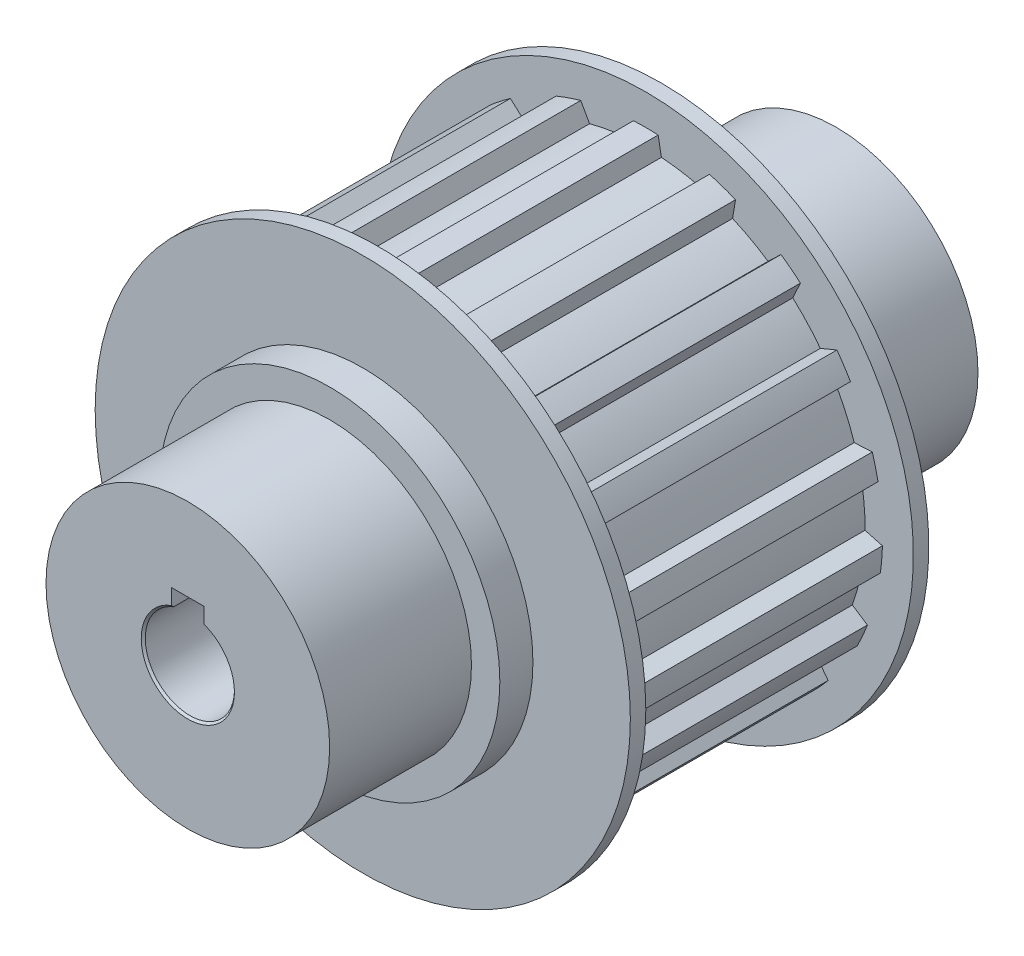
ISO-10303-21;
HEADER;
FILE_DESCRIPTION(('STEP AP214'),'2;1');
FILE_NAME('part.step','',(''),(''),'','','');
FILE_SCHEMA(('AUTOMOTIVE_DESIGN { 1 0 10303 214 1 1 1 1 }'));
ENDSEC;
DATA;
#1=APPLICATION_CONTEXT('core data for automotive mechanical design processes');
#2=APPLICATION_PROTOCOL_DEFINITION('international standard','automotive_design',2000,#1);
#3=PRODUCT_CONTEXT('',#1,'mechanical');
#4=PRODUCT('Part','Part','',(#3));
#5=PRODUCT_RELATED_PRODUCT_CATEGORY('part','',(#4));
#6=PRODUCT_DEFINITION_FORMATION('','',#4);
#7=PRODUCT_DEFINITION_CONTEXT('part definition',#1,'design');
#8=PRODUCT_DEFINITION('design','',#6,#7);
#9=PRODUCT_DEFINITION_SHAPE('','',#8);
#10=(LENGTH_UNIT() NAMED_UNIT(*) SI_UNIT(.MILLI.,.METRE.));
#11=(NAMED_UNIT(*) PLANE_ANGLE_UNIT() SI_UNIT($,.RADIAN.));
#12=(NAMED_UNIT(*) SI_UNIT($,.STERADIAN.) SOLID_ANGLE_UNIT());
#13=UNCERTAINTY_MEASURE_WITH_UNIT(LENGTH_MEASURE(1.E-05),#10,'distance_accuracy_value','');
#14=(GEOMETRIC_REPRESENTATION_CONTEXT(3) GLOBAL_UNCERTAINTY_ASSIGNED_CONTEXT((#13)) GLOBAL_UNIT_ASSIGNED_CONTEXT((#10,
#11,#12)) REPRESENTATION_CONTEXT('',''));
#15=CARTESIAN_POINT('',(0.,0.,0.));
#16=DIRECTION('',(0.,0.,1.));
#17=DIRECTION('',(1.,0.,0.));
#18=AXIS2_PLACEMENT_3D('',#15,#16,#17);
#19=CARTESIAN_POINT('',(0.,0.,0.));
#20=DIRECTION('',(0.,0.,1.));
#21=DIRECTION('',(1.,0.,0.));
#22=AXIS2_PLACEMENT_3D('',#19,#20,#21);
#23=CYLINDRICAL_SURFACE('',#22,29.21);
#24=CARTESIAN_POINT('',(0.,0.,-16.51));
#25=DIRECTION('',(0.,0.,1.));
#26=DIRECTION('',(1.,0.,0.));
#27=AXIS2_PLACEMENT_3D('',#24,#25,#26);
#28=CIRCLE('',#27,29.21);
#29=CARTESIAN_POINT('',(-1.524,29.1702163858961,-16.51));
#30=VERTEX_POINT('',#29);
#31=CARTESIAN_POINT('',(1.524,29.1702163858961,-16.51));
#32=VERTEX_POINT('',#31);
#33=EDGE_CURVE('E532',#30,#32,#28,.F.);
#34=ORIENTED_EDGE('',*,*,#33,.F.);
#35=DIRECTION('',(0.,0.,1.));
#36=VECTOR('',#35,1.);
#37=CARTESIAN_POINT('',(-1.524,29.1702163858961,0.));
#38=LINE('',#37,#36);
#39=CARTESIAN_POINT('',(-1.524,29.1702163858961,16.51));
#40=VERTEX_POINT('',#39);
#41=EDGE_CURVE('E531',#40,#30,#38,.F.);
#42=ORIENTED_EDGE('',*,*,#41,.F.);
#43=CARTESIAN_POINT('',(0.,0.,16.51));
#44=DIRECTION('',(0.,0.,1.));
#45=DIRECTION('',(1.,0.,0.));
#46=AXIS2_PLACEMENT_3D('',#43,#44,#45);
#47=CIRCLE('',#46,29.21);
#48=CARTESIAN_POINT('',(1.524,29.1702163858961,16.51));
#49=VERTEX_POINT('',#48);
#50=EDGE_CURVE('E19',#49,#40,#47,.T.);
#51=ORIENTED_EDGE('',*,*,#50,.F.);
#52=DIRECTION('',(0.,0.,1.));
#53=VECTOR('',#52,1.);
#54=CARTESIAN_POINT('',(1.524,29.1702163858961,0.));
#55=LINE('',#54,#53);
#56=EDGE_CURVE('E513',#32,#49,#55,.T.);
#57=ORIENTED_EDGE('',*,*,#56,.F.);
#58=EDGE_LOOP('',(#34,#42,#51,#57));
#59=FACE_BOUND('',#58,.T.);
#60=ADVANCED_FACE('F15',(#59),#23,.T.);
#61=CARTESIAN_POINT('',(1.524,29.1702163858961,0.));
#62=DIRECTION('',(0.983423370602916,0.181324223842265,0.));
#63=DIRECTION('',(-0.181324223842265,0.983423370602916,0.));
#64=AXIS2_PLACEMENT_3D('',#61,#62,#63);
#65=PLANE('',#64);
#66=DIRECTION('',(0.181324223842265,-0.983423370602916,0.));
#67=VECTOR('',#66,1.);
#68=CARTESIAN_POINT('',(1.524,29.1702163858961,-16.51));
#69=LINE('',#68,#67);
#70=CARTESIAN_POINT('',(1.92741928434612,26.9822464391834,-16.51));
#71=VERTEX_POINT('',#70);
#72=EDGE_CURVE('E929',#32,#71,#69,.T.);
#73=ORIENTED_EDGE('',*,*,#72,.F.);
#74=ORIENTED_EDGE('',*,*,#56,.T.);
#75=DIRECTION('',(-0.181324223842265,0.983423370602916,0.));
#76=VECTOR('',#75,1.);
#77=CARTESIAN_POINT('',(1.92741928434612,26.9822464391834,16.51));
#78=LINE('',#77,#76);
#79=CARTESIAN_POINT('',(1.92741928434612,26.9822464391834,16.51));
#80=VERTEX_POINT('',#79);
#81=EDGE_CURVE('E527',#80,#49,#78,.T.);
#82=ORIENTED_EDGE('',*,*,#81,.F.);
#83=DIRECTION('',(0.,0.,1.));
#84=VECTOR('',#83,1.);
#85=CARTESIAN_POINT('',(1.92741928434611,26.9822464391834,0.));
#86=LINE('',#85,#84);
#87=EDGE_CURVE('E690',#71,#80,#86,.T.);
#88=ORIENTED_EDGE('',*,*,#87,.F.);
#89=EDGE_LOOP('',(#73,#74,#82,#88));
#90=FACE_BOUND('',#89,.T.);
#91=ADVANCED_FACE('F1941',(#90),#65,.T.);
#92=CARTESIAN_POINT('',(0.,0.,0.));
#93=DIRECTION('',(0.,0.,1.));
#94=DIRECTION('',(1.,0.,0.));
#95=AXIS2_PLACEMENT_3D('',#92,#93,#94);
#96=CYLINDRICAL_SURFACE('',#95,27.0509993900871);
#97=CARTESIAN_POINT('',(0.,0.,-16.51));
#98=DIRECTION('',(0.,0.,1.));
#99=DIRECTION('',(1.,0.,0.));
#100=AXIS2_PLACEMENT_3D('',#97,#98,#99);
#101=CIRCLE('',#100,27.0509993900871);
#102=CARTESIAN_POINT('',(6.93813470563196,26.1461059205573,-16.51));
#103=VERTEX_POINT('',#102);
#104=EDGE_CURVE('E927',#71,#103,#101,.F.);
#105=ORIENTED_EDGE('',*,*,#104,.F.);
#106=ORIENTED_EDGE('',*,*,#87,.T.);
#107=CARTESIAN_POINT('',(0.,0.,16.51));
#108=DIRECTION('',(0.,0.,1.));
#109=DIRECTION('',(1.,0.,0.));
#110=AXIS2_PLACEMENT_3D('',#107,#108,#109);
#111=CIRCLE('',#110,27.0509993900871);
#112=CARTESIAN_POINT('',(6.93813470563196,26.1461059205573,16.51));
#113=VERTEX_POINT('',#112);
#114=EDGE_CURVE('E932',#113,#80,#111,.T.);
#115=ORIENTED_EDGE('',*,*,#114,.F.);
#116=DIRECTION('',(0.,0.,1.));
#117=VECTOR('',#116,1.);
#118=CARTESIAN_POINT('',(6.93813470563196,26.1461059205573,0.));
#119=LINE('',#118,#117);
#120=EDGE_CURVE('E688',#103,#113,#119,.T.);
#121=ORIENTED_EDGE('',*,*,#120,.F.);
#122=EDGE_LOOP('',(#105,#106,#115,#121));
#123=FACE_BOUND('',#122,.T.);
#124=ADVANCED_FACE('F1933',(#123),#96,.T.);
#125=CARTESIAN_POINT('',(6.93813470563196,26.1461059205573,0.));
#126=DIRECTION('',(-0.90877071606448,0.417295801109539,0.));
#127=DIRECTION('',(-0.417295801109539,-0.90877071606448,0.));
#128=AXIS2_PLACEMENT_3D('',#125,#126,#127);
#129=PLANE('',#128);
#130=DIRECTION('',(0.41729580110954,0.90877071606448,0.));
#131=VECTOR('',#130,1.);
#132=CARTESIAN_POINT('',(6.93813470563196,26.1461059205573,-16.51));
#133=LINE('',#132,#131);
#134=CARTESIAN_POINT('',(7.85141826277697,28.1350196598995,-16.51));
#135=VERTEX_POINT('',#134);
#136=EDGE_CURVE('E925',#103,#135,#133,.T.);
#137=ORIENTED_EDGE('',*,*,#136,.F.);
#138=ORIENTED_EDGE('',*,*,#120,.T.);
#139=DIRECTION('',(-0.417295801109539,-0.90877071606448,0.));
#140=VECTOR('',#139,1.);
#141=CARTESIAN_POINT('',(7.85141826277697,28.1350196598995,16.51));
#142=LINE('',#141,#140);
#143=CARTESIAN_POINT('',(7.85141826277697,28.1350196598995,16.51));
#144=VERTEX_POINT('',#143);
#145=EDGE_CURVE('E934',#144,#113,#142,.T.);
#146=ORIENTED_EDGE('',*,*,#145,.F.);
#147=DIRECTION('',(0.,0.,1.));
#148=VECTOR('',#147,1.);
#149=CARTESIAN_POINT('',(7.85141826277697,28.1350196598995,0.));
#150=LINE('',#149,#148);
#151=EDGE_CURVE('E686',#135,#144,#150,.T.);
#152=ORIENTED_EDGE('',*,*,#151,.F.);
#153=EDGE_LOOP('',(#137,#138,#146,#152));
#154=FACE_BOUND('',#153,.T.);
#155=ADVANCED_FACE('F1925',(#154),#129,.T.);
#156=CARTESIAN_POINT('',(0.,0.,0.));
#157=DIRECTION('',(0.,0.,1.));
#158=DIRECTION('',(1.,0.,0.));
#159=AXIS2_PLACEMENT_3D('',#156,#157,#158);
#160=CYLINDRICAL_SURFACE('',#159,29.21);
#161=CARTESIAN_POINT('',(0.,0.,-16.51));
#162=DIRECTION('',(0.,0.,1.));
#163=DIRECTION('',(1.,0.,0.));
#164=AXIS2_PLACEMENT_3D('',#161,#162,#163);
#165=CIRCLE('',#164,29.21);
#166=CARTESIAN_POINT('',(11.0725078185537,27.0300512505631,-16.51));
#167=VERTEX_POINT('',#166);
#168=EDGE_CURVE('E923',#135,#167,#165,.F.);
#169=ORIENTED_EDGE('',*,*,#168,.F.);
#170=ORIENTED_EDGE('',*,*,#151,.T.);
#171=CARTESIAN_POINT('',(0.,0.,16.51));
#172=DIRECTION('',(0.,0.,1.));
#173=DIRECTION('',(1.,0.,0.));
#174=AXIS2_PLACEMENT_3D('',#171,#172,#173);
#175=CIRCLE('',#174,29.21);
#176=CARTESIAN_POINT('',(11.0725078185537,27.0300512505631,16.51));
#177=VERTEX_POINT('',#176);
#178=EDGE_CURVE('E935',#177,#144,#175,.T.);
#179=ORIENTED_EDGE('',*,*,#178,.F.);
#180=DIRECTION('',(0.,0.,1.));
#181=VECTOR('',#180,1.);
#182=CARTESIAN_POINT('',(11.0725078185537,27.0300512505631,0.));
#183=LINE('',#182,#181);
#184=EDGE_CURVE('E684',#167,#177,#183,.T.);
#185=ORIENTED_EDGE('',*,*,#184,.F.);
#186=EDGE_LOOP('',(#169,#170,#179,#185));
#187=FACE_BOUND('',#186,.T.);
#188=ADVANCED_FACE('F1917',(#187),#160,.T.);
#189=CARTESIAN_POINT('',(11.0725078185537,27.0300512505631,0.));
#190=DIRECTION('',(0.986361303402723,-0.164594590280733,0.));
#191=DIRECTION('',(0.164594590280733,0.986361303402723,0.));
#192=AXIS2_PLACEMENT_3D('',#189,#190,#191);
#193=PLANE('',#192);
#194=DIRECTION('',(-0.164594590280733,-0.986361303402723,0.));
#195=VECTOR('',#194,1.);
#196=CARTESIAN_POINT('',(11.0725078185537,27.0300512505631,-16.51));
#197=LINE('',#196,#195);
#198=CARTESIAN_POINT('',(10.7073348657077,24.8416897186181,-16.51));
#199=VERTEX_POINT('',#198);
#200=EDGE_CURVE('E921',#167,#199,#197,.T.);
#201=ORIENTED_EDGE('',*,*,#200,.F.);
#202=ORIENTED_EDGE('',*,*,#184,.T.);
#203=DIRECTION('',(0.164594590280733,0.986361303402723,0.));
#204=VECTOR('',#203,1.);
#205=CARTESIAN_POINT('',(10.7073348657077,24.8416897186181,16.51));
#206=LINE('',#205,#204);
#207=CARTESIAN_POINT('',(10.7073348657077,24.8416897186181,16.51));
#208=VERTEX_POINT('',#207);
#209=EDGE_CURVE('E938',#208,#177,#206,.T.);
#210=ORIENTED_EDGE('',*,*,#209,.F.);
#211=DIRECTION('',(0.,0.,1.));
#212=VECTOR('',#211,1.);
#213=CARTESIAN_POINT('',(10.7073348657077,24.8416897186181,0.));
#214=LINE('',#213,#212);
#215=EDGE_CURVE('E682',#199,#208,#214,.T.);
#216=ORIENTED_EDGE('',*,*,#215,.F.);
#217=EDGE_LOOP('',(#201,#202,#210,#216));
#218=FACE_BOUND('',#217,.T.);
#219=ADVANCED_FACE('F1909',(#218),#193,.T.);
#220=CARTESIAN_POINT('',(0.,0.,0.));
#221=DIRECTION('',(0.,0.,1.));
#222=DIRECTION('',(1.,0.,0.));
#223=AXIS2_PLACEMENT_3D('',#220,#221,#222);
#224=CYLINDRICAL_SURFACE('',#223,27.0509993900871);
#225=CARTESIAN_POINT('',(0.,0.,-16.51));
#226=DIRECTION('',(0.,0.,1.));
#227=DIRECTION('',(1.,0.,0.));
#228=AXIS2_PLACEMENT_3D('',#225,#226,#227);
#229=CIRCLE('',#228,27.0509993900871);
#230=CARTESIAN_POINT('',(15.0844039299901,22.4547840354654,-16.51));
#231=VERTEX_POINT('',#230);
#232=EDGE_CURVE('E919',#199,#231,#229,.F.);
#233=ORIENTED_EDGE('',*,*,#232,.F.);
#234=ORIENTED_EDGE('',*,*,#215,.T.);
#235=CARTESIAN_POINT('',(0.,0.,16.51));
#236=DIRECTION('',(0.,0.,1.));
#237=DIRECTION('',(1.,0.,0.));
#238=AXIS2_PLACEMENT_3D('',#235,#236,#237);
#239=CIRCLE('',#238,27.0509993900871);
#240=CARTESIAN_POINT('',(15.0844039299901,22.4547840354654,16.51));
#241=VERTEX_POINT('',#240);
#242=EDGE_CURVE('E939',#241,#208,#239,.T.);
#243=ORIENTED_EDGE('',*,*,#242,.F.);
#244=DIRECTION('',(0.,0.,1.));
#245=VECTOR('',#244,1.);
#246=CARTESIAN_POINT('',(15.0844039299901,22.4547840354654,0.));
#247=LINE('',#246,#245);
#248=EDGE_CURVE('E680',#231,#241,#247,.T.);
#249=ORIENTED_EDGE('',*,*,#248,.F.);
#250=EDGE_LOOP('',(#233,#234,#243,#249));
#251=FACE_BOUND('',#250,.T.);
#252=ADVANCED_FACE('F1901',(#251),#224,.T.);
#253=CARTESIAN_POINT('',(15.0844039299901,22.4547840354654,0.));
#254=DIRECTION('',(-0.689624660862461,0.724166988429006,0.));
#255=DIRECTION('',(-0.724166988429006,-0.689624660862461,0.));
#256=AXIS2_PLACEMENT_3D('',#253,#254,#255);
#257=PLANE('',#256);
#258=DIRECTION('',(0.724166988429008,0.689624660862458,0.));
#259=VECTOR('',#258,1.);
#260=CARTESIAN_POINT('',(15.0844039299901,22.4547840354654,-16.51));
#261=LINE('',#260,#259);
#262=CARTESIAN_POINT('',(16.6829866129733,23.9771152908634,-16.51));
#263=VERTEX_POINT('',#262);
#264=EDGE_CURVE('E917',#231,#263,#261,.T.);
#265=ORIENTED_EDGE('',*,*,#264,.F.);
#266=ORIENTED_EDGE('',*,*,#248,.T.);
#267=DIRECTION('',(-0.724166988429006,-0.689624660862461,0.));
#268=VECTOR('',#267,1.);
#269=CARTESIAN_POINT('',(16.6829866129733,23.9771152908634,16.51));
#270=LINE('',#269,#268);
#271=CARTESIAN_POINT('',(16.6829866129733,23.9771152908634,16.51));
#272=VERTEX_POINT('',#271);
#273=EDGE_CURVE('E942',#272,#241,#270,.T.);
#274=ORIENTED_EDGE('',*,*,#273,.F.);
#275=DIRECTION('',(0.,0.,1.));
#276=VECTOR('',#275,1.);
#277=CARTESIAN_POINT('',(16.6829866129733,23.9771152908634,0.));
#278=LINE('',#277,#276);
#279=EDGE_CURVE('E678',#263,#272,#278,.T.);
#280=ORIENTED_EDGE('',*,*,#279,.F.);
#281=EDGE_LOOP('',(#265,#266,#274,#280));
#282=FACE_BOUND('',#281,.T.);
#283=ADVANCED_FACE('F1893',(#282),#257,.T.);
#284=CARTESIAN_POINT('',(0.,0.,0.));
#285=DIRECTION('',(0.,0.,1.));
#286=DIRECTION('',(1.,0.,0.));
#287=AXIS2_PLACEMENT_3D('',#284,#285,#286);
#288=CYLINDRICAL_SURFACE('',#287,29.21);
#289=CARTESIAN_POINT('',(0.,0.,-16.51));
#290=DIRECTION('',(0.,0.,1.));
#291=DIRECTION('',(1.,0.,0.));
#292=AXIS2_PLACEMENT_3D('',#289,#290,#291);
#293=CIRCLE('',#292,29.21);
#294=CARTESIAN_POINT('',(19.07738962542,22.1196135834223,-16.51));
#295=VERTEX_POINT('',#294);
#296=EDGE_CURVE('E915',#263,#295,#293,.F.);
#297=ORIENTED_EDGE('',*,*,#296,.F.);
#298=ORIENTED_EDGE('',*,*,#279,.T.);
#299=CARTESIAN_POINT('',(0.,0.,16.51));
#300=DIRECTION('',(0.,0.,1.));
#301=DIRECTION('',(1.,0.,0.));
#302=AXIS2_PLACEMENT_3D('',#299,#300,#301);
#303=CIRCLE('',#302,29.21);
#304=CARTESIAN_POINT('',(19.07738962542,22.1196135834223,16.51));
#305=VERTEX_POINT('',#304);
#306=EDGE_CURVE('E943',#305,#272,#303,.T.);
#307=ORIENTED_EDGE('',*,*,#306,.F.);
#308=DIRECTION('',(0.,0.,1.));
#309=VECTOR('',#308,1.);
#310=CARTESIAN_POINT('',(19.07738962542,22.1196135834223,0.));
#311=LINE('',#310,#309);
#312=EDGE_CURVE('E676',#295,#305,#311,.T.);
#313=ORIENTED_EDGE('',*,*,#312,.F.);
#314=EDGE_LOOP('',(#297,#298,#307,#313));
#315=FACE_BOUND('',#314,.T.);
#316=ADVANCED_FACE('F1885',(#315),#288,.T.);
#317=CARTESIAN_POINT('',(19.07738962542,22.1196135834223,0.));
#318=DIRECTION('',(0.90877071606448,-0.41729580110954,0.));
#319=DIRECTION('',(0.41729580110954,0.90877071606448,0.));
#320=AXIS2_PLACEMENT_3D('',#317,#318,#319);
#321=PLANE('',#320);
#322=DIRECTION('',(-0.417295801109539,-0.90877071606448,0.));
#323=VECTOR('',#322,1.);
#324=CARTESIAN_POINT('',(19.07738962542,22.1196135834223,-16.51));
#325=LINE('',#324,#323);
#326=CARTESIAN_POINT('',(18.1364655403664,20.0705053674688,-16.51));
#327=VERTEX_POINT('',#326);
#328=EDGE_CURVE('E913',#295,#327,#325,.T.);
#329=ORIENTED_EDGE('',*,*,#328,.F.);
#330=ORIENTED_EDGE('',*,*,#312,.T.);
#331=DIRECTION('',(0.417295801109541,0.908770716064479,0.));
#332=VECTOR('',#331,1.);
#333=CARTESIAN_POINT('',(18.1364655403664,20.0705053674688,16.51));
#334=LINE('',#333,#332);
#335=CARTESIAN_POINT('',(18.1364655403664,20.0705053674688,16.51));
#336=VERTEX_POINT('',#335);
#337=EDGE_CURVE('E946',#336,#305,#334,.T.);
#338=ORIENTED_EDGE('',*,*,#337,.F.);
#339=DIRECTION('',(0.,0.,1.));
#340=VECTOR('',#339,1.);
#341=CARTESIAN_POINT('',(18.1364655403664,20.0705053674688,0.));
#342=LINE('',#341,#340);
#343=EDGE_CURVE('E674',#327,#336,#342,.T.);
#344=ORIENTED_EDGE('',*,*,#343,.F.);
#345=EDGE_LOOP('',(#329,#330,#338,#344));
#346=FACE_BOUND('',#345,.T.);
#347=ADVANCED_FACE('F1877',(#346),#321,.T.);
#348=CARTESIAN_POINT('',(0.,0.,0.));
#349=DIRECTION('',(0.,0.,1.));
#350=DIRECTION('',(1.,0.,0.));
#351=AXIS2_PLACEMENT_3D('',#348,#349,#350);
#352=CYLINDRICAL_SURFACE('',#351,27.0509993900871);
#353=CARTESIAN_POINT('',(0.,0.,-16.51));
#354=DIRECTION('',(0.,0.,1.));
#355=DIRECTION('',(1.,0.,0.));
#356=AXIS2_PLACEMENT_3D('',#353,#354,#355);
#357=CIRCLE('',#356,27.0509993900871);
#358=CARTESIAN_POINT('',(21.5344337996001,16.3714608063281,-16.51));
#359=VERTEX_POINT('',#358);
#360=EDGE_CURVE('E911',#327,#359,#357,.F.);
#361=ORIENTED_EDGE('',*,*,#360,.F.);
#362=ORIENTED_EDGE('',*,*,#343,.T.);
#363=CARTESIAN_POINT('',(0.,0.,16.51));
#364=DIRECTION('',(0.,0.,1.));
#365=DIRECTION('',(1.,0.,0.));
#366=AXIS2_PLACEMENT_3D('',#363,#364,#365);
#367=CIRCLE('',#366,27.0509993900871);
#368=CARTESIAN_POINT('',(21.5344337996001,16.3714608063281,16.51));
#369=VERTEX_POINT('',#368);
#370=EDGE_CURVE('E947',#369,#336,#367,.T.);
#371=ORIENTED_EDGE('',*,*,#370,.F.);
#372=DIRECTION('',(0.,0.,1.));
#373=VECTOR('',#372,1.);
#374=CARTESIAN_POINT('',(21.5344337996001,16.3714608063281,0.));
#375=LINE('',#374,#373);
#376=EDGE_CURVE('E672',#359,#369,#375,.T.);
#377=ORIENTED_EDGE('',*,*,#376,.F.);
#378=EDGE_LOOP('',(#361,#362,#371,#377));
#379=FACE_BOUND('',#378,.T.);
#380=ADVANCED_FACE('F1869',(#379),#352,.T.);
#381=CARTESIAN_POINT('',(21.5344337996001,16.3714608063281,0.));
#382=DIRECTION('',(-0.3860830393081,0.922464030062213,0.));
#383=DIRECTION('',(-0.922464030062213,-0.3860830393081,0.));
#384=AXIS2_PLACEMENT_3D('',#381,#382,#383);
#385=PLANE('',#384);
#386=DIRECTION('',(0.922464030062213,0.386083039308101,0.));
#387=VECTOR('',#386,1.);
#388=CARTESIAN_POINT('',(21.5344337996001,16.3714608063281,-16.51));
#389=LINE('',#388,#387);
#390=CARTESIAN_POINT('',(23.5867783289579,17.2304378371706,-16.51));
#391=VERTEX_POINT('',#390);
#392=EDGE_CURVE('E909',#359,#391,#389,.T.);
#393=ORIENTED_EDGE('',*,*,#392,.F.);
#394=ORIENTED_EDGE('',*,*,#376,.T.);
#395=DIRECTION('',(-0.922464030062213,-0.3860830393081,0.));
#396=VECTOR('',#395,1.);
#397=CARTESIAN_POINT('',(23.586778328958,17.2304378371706,16.51));
#398=LINE('',#397,#396);
#399=CARTESIAN_POINT('',(23.5867783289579,17.2304378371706,16.51));
#400=VERTEX_POINT('',#399);
#401=EDGE_CURVE('E950',#400,#369,#398,.T.);
#402=ORIENTED_EDGE('',*,*,#401,.F.);
#403=DIRECTION('',(0.,0.,1.));
#404=VECTOR('',#403,1.);
#405=CARTESIAN_POINT('',(23.5867783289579,17.2304378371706,0.));
#406=LINE('',#405,#404);
#407=EDGE_CURVE('E670',#391,#400,#406,.T.);
#408=ORIENTED_EDGE('',*,*,#407,.F.);
#409=EDGE_LOOP('',(#393,#394,#402,#408));
#410=FACE_BOUND('',#409,.T.);
#411=ADVANCED_FACE('F1861',(#410),#385,.T.);
#412=CARTESIAN_POINT('',(0.,0.,0.));
#413=DIRECTION('',(0.,0.,1.));
#414=DIRECTION('',(1.,0.,0.));
#415=AXIS2_PLACEMENT_3D('',#412,#413,#414);
#416=CYLINDRICAL_SURFACE('',#415,29.21);
#417=CARTESIAN_POINT('',(0.,0.,-16.51));
#418=DIRECTION('',(0.,0.,1.));
#419=DIRECTION('',(1.,0.,0.));
#420=AXIS2_PLACEMENT_3D('',#417,#418,#419);
#421=CIRCLE('',#420,29.21);
#422=CARTESIAN_POINT('',(25.2542665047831,14.6780830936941,-16.51));
#423=VERTEX_POINT('',#422);
#424=EDGE_CURVE('E907',#391,#423,#421,.F.);
#425=ORIENTED_EDGE('',*,*,#424,.F.);
#426=ORIENTED_EDGE('',*,*,#407,.T.);
#427=CARTESIAN_POINT('',(0.,0.,16.51));
#428=DIRECTION('',(0.,0.,1.));
#429=DIRECTION('',(1.,0.,0.));
#430=AXIS2_PLACEMENT_3D('',#427,#428,#429);
#431=CIRCLE('',#430,29.21);
#432=CARTESIAN_POINT('',(25.2542665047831,14.6780830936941,16.51));
#433=VERTEX_POINT('',#432);
#434=EDGE_CURVE('E951',#433,#400,#431,.T.);
#435=ORIENTED_EDGE('',*,*,#434,.F.);
#436=DIRECTION('',(0.,0.,1.));
#437=VECTOR('',#436,1.);
#438=CARTESIAN_POINT('',(25.2542665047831,14.6780830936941,0.));
#439=LINE('',#438,#437);
#440=EDGE_CURVE('E668',#423,#433,#439,.T.);
#441=ORIENTED_EDGE('',*,*,#440,.F.);
#442=EDGE_LOOP('',(#425,#426,#435,#441));
#443=FACE_BOUND('',#442,.T.);
#444=ADVANCED_FACE('F1853',(#443),#416,.T.);
#445=CARTESIAN_POINT('',(25.2542665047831,14.6780830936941,0.));
#446=DIRECTION('',(0.689624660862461,-0.724166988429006,0.));
#447=DIRECTION('',(0.724166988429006,0.689624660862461,0.));
#448=AXIS2_PLACEMENT_3D('',#445,#446,#447);
#449=PLANE('',#448);
#450=DIRECTION('',(-0.724166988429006,-0.689624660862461,0.));
#451=VECTOR('',#450,1.);
#452=CARTESIAN_POINT('',(25.2542665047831,14.6780830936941,-16.51));
#453=LINE('',#452,#451);
#454=CARTESIAN_POINT('',(23.6431241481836,13.1437912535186,-16.51));
#455=VERTEX_POINT('',#454);
#456=EDGE_CURVE('E905',#423,#455,#453,.T.);
#457=ORIENTED_EDGE('',*,*,#456,.F.);
#458=ORIENTED_EDGE('',*,*,#440,.T.);
#459=DIRECTION('',(0.724166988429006,0.689624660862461,0.));
#460=VECTOR('',#459,1.);
#461=CARTESIAN_POINT('',(23.6431241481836,13.1437912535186,16.51));
#462=LINE('',#461,#460);
#463=CARTESIAN_POINT('',(23.6431241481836,13.1437912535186,16.51));
#464=VERTEX_POINT('',#463);
#465=EDGE_CURVE('E954',#464,#433,#462,.T.);
#466=ORIENTED_EDGE('',*,*,#465,.F.);
#467=DIRECTION('',(0.,0.,1.));
#468=VECTOR('',#467,1.);
#469=CARTESIAN_POINT('',(23.6431241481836,13.1437912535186,0.));
#470=LINE('',#469,#468);
#471=EDGE_CURVE('E666',#455,#464,#470,.T.);
#472=ORIENTED_EDGE('',*,*,#471,.F.);
#473=EDGE_LOOP('',(#457,#458,#466,#472));
#474=FACE_BOUND('',#473,.T.);
#475=ADVANCED_FACE('F1845',(#474),#449,.T.);
#476=CARTESIAN_POINT('',(0.,0.,0.));
#477=DIRECTION('',(0.,0.,1.));
#478=DIRECTION('',(1.,0.,0.));
#479=AXIS2_PLACEMENT_3D('',#476,#477,#478);
#480=CYLINDRICAL_SURFACE('',#479,27.0509993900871);
#481=CARTESIAN_POINT('',(0.,0.,-16.51));
#482=DIRECTION('',(0.,0.,1.));
#483=DIRECTION('',(1.,0.,0.));
#484=AXIS2_PLACEMENT_3D('',#481,#482,#483);
#485=CIRCLE('',#484,27.0509993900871);
#486=CARTESIAN_POINT('',(25.7165817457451,8.39130450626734,-16.51));
#487=VERTEX_POINT('',#486);
#488=EDGE_CURVE('E903',#455,#487,#485,.F.);
#489=ORIENTED_EDGE('',*,*,#488,.F.);
#490=ORIENTED_EDGE('',*,*,#471,.T.);
#491=CARTESIAN_POINT('',(0.,0.,16.51));
#492=DIRECTION('',(0.,0.,1.));
#493=DIRECTION('',(1.,0.,0.));
#494=AXIS2_PLACEMENT_3D('',#491,#492,#493);
#495=CIRCLE('',#494,27.0509993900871);
#496=CARTESIAN_POINT('',(25.7165817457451,8.39130450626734,16.51));
#497=VERTEX_POINT('',#496);
#498=EDGE_CURVE('E955',#497,#464,#495,.T.);
#499=ORIENTED_EDGE('',*,*,#498,.F.);
#500=DIRECTION('',(0.,0.,1.));
#501=VECTOR('',#500,1.);
#502=CARTESIAN_POINT('',(25.7165817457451,8.39130450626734,0.));
#503=LINE('',#502,#501);
#504=EDGE_CURVE('E664',#487,#497,#503,.T.);
#505=ORIENTED_EDGE('',*,*,#504,.F.);
#506=EDGE_LOOP('',(#489,#490,#499,#505));
#507=FACE_BOUND('',#506,.T.);
#508=ADVANCED_FACE('F1837',(#507),#480,.T.);
#509=CARTESIAN_POINT('',(25.7165817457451,8.39130450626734,0.));
#510=DIRECTION('',(-0.05217391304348,0.998638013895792,0.));
#511=DIRECTION('',(-0.998638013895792,-0.05217391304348,0.));
#512=AXIS2_PLACEMENT_3D('',#509,#510,#511);
#513=PLANE('',#512);
#514=DIRECTION('',(0.998638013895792,0.052173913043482,0.));
#515=VECTOR('',#514,1.);
#516=CARTESIAN_POINT('',(25.7165817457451,8.39130450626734,-16.51));
#517=LINE('',#516,#515);
#518=CARTESIAN_POINT('',(27.9435845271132,8.50765442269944,-16.51));
#519=VERTEX_POINT('',#518);
#520=EDGE_CURVE('E901',#487,#519,#517,.T.);
#521=ORIENTED_EDGE('',*,*,#520,.F.);
#522=ORIENTED_EDGE('',*,*,#504,.T.);
#523=DIRECTION('',(-0.998638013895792,-0.0521739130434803,0.));
#524=VECTOR('',#523,1.);
#525=CARTESIAN_POINT('',(27.9435845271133,8.50765442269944,16.51));
#526=LINE('',#525,#524);
#527=CARTESIAN_POINT('',(27.9435845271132,8.50765442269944,16.51));
#528=VERTEX_POINT('',#527);
#529=EDGE_CURVE('E958',#528,#497,#526,.T.);
#530=ORIENTED_EDGE('',*,*,#529,.F.);
#531=DIRECTION('',(0.,0.,1.));
#532=VECTOR('',#531,1.);
#533=CARTESIAN_POINT('',(27.9435845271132,8.50765442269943,0.));
#534=LINE('',#533,#532);
#535=EDGE_CURVE('E662',#519,#528,#534,.T.);
#536=ORIENTED_EDGE('',*,*,#535,.F.);
#537=EDGE_LOOP('',(#521,#522,#530,#536));
#538=FACE_BOUND('',#537,.T.);
#539=ADVANCED_FACE('F1829',(#538),#513,.T.);
#540=CARTESIAN_POINT('',(0.,0.,0.));
#541=DIRECTION('',(0.,0.,1.));
#542=DIRECTION('',(1.,0.,0.));
#543=AXIS2_PLACEMENT_3D('',#540,#541,#542);
#544=CYLINDRICAL_SURFACE('',#543,29.21);
#545=CARTESIAN_POINT('',(0.,0.,-16.51));
#546=DIRECTION('',(0.,0.,1.));
#547=DIRECTION('',(1.,0.,0.));
#548=AXIS2_PLACEMENT_3D('',#545,#546,#547);
#549=CIRCLE('',#548,29.21);
#550=CARTESIAN_POINT('',(28.651735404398,5.68349877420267,-16.51));
#551=VERTEX_POINT('',#550);
#552=EDGE_CURVE('E899',#519,#551,#549,.F.);
#553=ORIENTED_EDGE('',*,*,#552,.F.);
#554=ORIENTED_EDGE('',*,*,#535,.T.);
#555=CARTESIAN_POINT('',(0.,0.,16.51));
#556=DIRECTION('',(0.,0.,1.));
#557=DIRECTION('',(1.,0.,0.));
#558=AXIS2_PLACEMENT_3D('',#555,#556,#557);
#559=CIRCLE('',#558,29.21);
#560=CARTESIAN_POINT('',(28.651735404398,5.68349877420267,16.51));
#561=VERTEX_POINT('',#560);
#562=EDGE_CURVE('E959',#561,#528,#559,.T.);
#563=ORIENTED_EDGE('',*,*,#562,.F.);
#564=DIRECTION('',(0.,0.,1.));
#565=VECTOR('',#564,1.);
#566=CARTESIAN_POINT('',(28.6517354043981,5.68349877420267,0.));
#567=LINE('',#566,#565);
#568=EDGE_CURVE('E660',#551,#561,#567,.T.);
#569=ORIENTED_EDGE('',*,*,#568,.F.);
#570=EDGE_LOOP('',(#553,#554,#563,#569));
#571=FACE_BOUND('',#570,.T.);
#572=ADVANCED_FACE('F1821',(#571),#544,.T.);
#573=CARTESIAN_POINT('',(28.6517354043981,5.68349877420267,0.));
#574=DIRECTION('',(0.417191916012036,-0.908818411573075,0.));
#575=DIRECTION('',(0.908818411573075,0.417191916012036,0.));
#576=AXIS2_PLACEMENT_3D('',#573,#574,#575);
#577=PLANE('',#576);
#578=DIRECTION('',(-0.908818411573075,-0.417191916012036,0.));
#579=VECTOR('',#578,1.);
#580=CARTESIAN_POINT('',(28.6517354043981,5.68349877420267,-16.51));
#581=LINE('',#580,#579);
#582=CARTESIAN_POINT('',(26.6297503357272,4.7553091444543,-16.51));
#583=VERTEX_POINT('',#582);
#584=EDGE_CURVE('E897',#551,#583,#581,.T.);
#585=ORIENTED_EDGE('',*,*,#584,.F.);
#586=ORIENTED_EDGE('',*,*,#568,.T.);
#587=DIRECTION('',(0.908818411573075,0.417191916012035,0.));
#588=VECTOR('',#587,1.);
#589=CARTESIAN_POINT('',(26.6297503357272,4.7553091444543,16.51));
#590=LINE('',#589,#588);
#591=CARTESIAN_POINT('',(26.6297503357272,4.7553091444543,16.51));
#592=VERTEX_POINT('',#591);
#593=EDGE_CURVE('E962',#592,#561,#590,.T.);
#594=ORIENTED_EDGE('',*,*,#593,.F.);
#595=DIRECTION('',(0.,0.,1.));
#596=VECTOR('',#595,1.);
#597=CARTESIAN_POINT('',(26.6297503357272,4.7553091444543,0.));
#598=LINE('',#597,#596);
#599=EDGE_CURVE('E658',#583,#592,#598,.T.);
#600=ORIENTED_EDGE('',*,*,#599,.F.);
#601=EDGE_LOOP('',(#585,#586,#594,#600));
#602=FACE_BOUND('',#601,.T.);
#603=ADVANCED_FACE('F1813',(#602),#577,.T.);
#604=CARTESIAN_POINT('',(0.,0.,0.));
#605=DIRECTION('',(0.,0.,1.));
#606=DIRECTION('',(1.,0.,0.));
#607=AXIS2_PLACEMENT_3D('',#604,#605,#606);
#608=CYLINDRICAL_SURFACE('',#607,27.0509993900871);
#609=CARTESIAN_POINT('',(0.,0.,-16.51));
#610=DIRECTION('',(0.,0.,1.));
#611=DIRECTION('',(1.,0.,0.));
#612=AXIS2_PLACEMENT_3D('',#609,#610,#611);
#613=CIRCLE('',#612,27.0509993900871);
#614=CARTESIAN_POINT('',(27.0492602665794,-0.306736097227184,-16.51));
#615=VERTEX_POINT('',#614);
#616=EDGE_CURVE('E895',#583,#615,#613,.F.);
#617=ORIENTED_EDGE('',*,*,#616,.F.);
#618=ORIENTED_EDGE('',*,*,#599,.T.);
#619=CARTESIAN_POINT('',(0.,0.,16.51));
#620=DIRECTION('',(0.,0.,1.));
#621=DIRECTION('',(1.,0.,0.));
#622=AXIS2_PLACEMENT_3D('',#619,#620,#621);
#623=CIRCLE('',#622,27.0509993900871);
#624=CARTESIAN_POINT('',(27.0492602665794,-0.306736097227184,16.51));
#625=VERTEX_POINT('',#624);
#626=EDGE_CURVE('E963',#625,#592,#623,.T.);
#627=ORIENTED_EDGE('',*,*,#626,.F.);
#628=DIRECTION('',(0.,0.,1.));
#629=VECTOR('',#628,1.);
#630=CARTESIAN_POINT('',(27.0492602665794,-0.306736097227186,0.));
#631=LINE('',#630,#629);
#632=EDGE_CURVE('E656',#615,#625,#631,.T.);
#633=ORIENTED_EDGE('',*,*,#632,.F.);
#634=EDGE_LOOP('',(#617,#618,#627,#633));
#635=FACE_BOUND('',#634,.T.);
#636=ADVANCED_FACE('F1805',(#635),#608,.T.);
#637=CARTESIAN_POINT('',(27.0492602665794,-0.306736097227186,0.));
#638=DIRECTION('',(0.261841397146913,0.965110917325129,0.));
#639=DIRECTION('',(-0.965110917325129,0.261841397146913,0.));
#640=AXIS2_PLACEMENT_3D('',#637,#638,#639);
#641=PLANE('',#640);
#642=DIRECTION('',(0.96511091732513,-0.261841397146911,0.));
#643=VECTOR('',#642,1.);
#644=CARTESIAN_POINT('',(27.0492602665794,-0.306736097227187,-16.51));
#645=LINE('',#644,#643);
#646=CARTESIAN_POINT('',(29.1964598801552,-0.889286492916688,-16.51));
#647=VERTEX_POINT('',#646);
#648=EDGE_CURVE('E893',#615,#647,#645,.T.);
#649=ORIENTED_EDGE('',*,*,#648,.F.);
#650=ORIENTED_EDGE('',*,*,#632,.T.);
#651=DIRECTION('',(-0.965110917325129,0.261841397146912,0.));
#652=VECTOR('',#651,1.);
#653=CARTESIAN_POINT('',(29.1964598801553,-0.889286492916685,16.51));
#654=LINE('',#653,#652);
#655=CARTESIAN_POINT('',(29.1964598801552,-0.889286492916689,16.51));
#656=VERTEX_POINT('',#655);
#657=EDGE_CURVE('E966',#656,#625,#654,.T.);
#658=ORIENTED_EDGE('',*,*,#657,.F.);
#659=DIRECTION('',(0.,0.,1.));
#660=VECTOR('',#659,1.);
#661=CARTESIAN_POINT('',(29.1964598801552,-0.8892864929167,0.));
#662=LINE('',#661,#660);
#663=EDGE_CURVE('E654',#647,#656,#662,.T.);
#664=ORIENTED_EDGE('',*,*,#663,.F.);
#665=EDGE_LOOP('',(#649,#650,#658,#664));
#666=FACE_BOUND('',#665,.T.);
#667=ADVANCED_FACE('F1797',(#666),#641,.T.);
#668=CARTESIAN_POINT('',(0.,0.,0.));
#669=DIRECTION('',(0.,0.,1.));
#670=DIRECTION('',(1.,0.,0.));
#671=AXIS2_PLACEMENT_3D('',#668,#669,#670);
#672=CYLINDRICAL_SURFACE('',#671,29.21);
#673=CARTESIAN_POINT('',(0.,0.,-16.51));
#674=DIRECTION('',(0.,0.,1.));
#675=DIRECTION('',(1.,0.,0.));
#676=AXIS2_PLACEMENT_3D('',#673,#674,#675);
#677=CIRCLE('',#676,29.21);
#678=CARTESIAN_POINT('',(28.9447343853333,-3.92765214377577,-16.51));
#679=VERTEX_POINT('',#678);
#680=EDGE_CURVE('E891',#647,#679,#677,.F.);
#681=ORIENTED_EDGE('',*,*,#680,.F.);
#682=ORIENTED_EDGE('',*,*,#663,.T.);
#683=CARTESIAN_POINT('',(0.,0.,16.51));
#684=DIRECTION('',(0.,0.,1.));
#685=DIRECTION('',(1.,0.,0.));
#686=AXIS2_PLACEMENT_3D('',#683,#684,#685);
#687=CIRCLE('',#686,29.21);
#688=CARTESIAN_POINT('',(28.9447343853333,-3.92765214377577,16.51));
#689=VERTEX_POINT('',#688);
#690=EDGE_CURVE('E967',#689,#656,#687,.T.);
#691=ORIENTED_EDGE('',*,*,#690,.F.);
#692=DIRECTION('',(0.,0.,1.));
#693=VECTOR('',#692,1.);
#694=CARTESIAN_POINT('',(28.9447343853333,-3.92765214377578,0.));
#695=LINE('',#694,#693);
#696=EDGE_CURVE('E652',#679,#689,#695,.T.);
#697=ORIENTED_EDGE('',*,*,#696,.F.);
#698=EDGE_LOOP('',(#681,#682,#691,#697));
#699=FACE_BOUND('',#698,.T.);
#700=ADVANCED_FACE('F1789',(#699),#672,.T.);
#701=CARTESIAN_POINT('',(28.9447343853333,-3.92765214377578,0.));
#702=DIRECTION('',(0.071251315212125,-0.997458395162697,0.));
#703=DIRECTION('',(0.997458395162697,0.071251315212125,0.));
#704=AXIS2_PLACEMENT_3D('',#701,#702,#703);
#705=PLANE('',#704);
#706=DIRECTION('',(-0.997458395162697,-0.0712513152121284,0.));
#707=VECTOR('',#706,1.);
#708=CARTESIAN_POINT('',(28.9447343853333,-3.92765214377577,-16.51));
#709=LINE('',#708,#707);
#710=CARTESIAN_POINT('',(26.7407671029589,-4.08508785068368,-16.51));
#711=VERTEX_POINT('',#710);
#712=EDGE_CURVE('E889',#679,#711,#709,.T.);
#713=ORIENTED_EDGE('',*,*,#712,.F.);
#714=ORIENTED_EDGE('',*,*,#696,.T.);
#715=DIRECTION('',(0.997458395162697,0.0712513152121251,0.));
#716=VECTOR('',#715,1.);
#717=CARTESIAN_POINT('',(26.7407671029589,-4.08508785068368,16.51));
#718=LINE('',#717,#716);
#719=CARTESIAN_POINT('',(26.7407671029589,-4.08508785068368,16.51));
#720=VERTEX_POINT('',#719);
#721=EDGE_CURVE('E970',#720,#689,#718,.T.);
#722=ORIENTED_EDGE('',*,*,#721,.F.);
#723=DIRECTION('',(0.,0.,1.));
#724=VECTOR('',#723,1.);
#725=CARTESIAN_POINT('',(26.7407671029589,-4.08508785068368,0.));
#726=LINE('',#725,#724);
#727=EDGE_CURVE('E650',#711,#720,#726,.T.);
#728=ORIENTED_EDGE('',*,*,#727,.F.);
#729=EDGE_LOOP('',(#713,#714,#722,#728));
#730=FACE_BOUND('',#729,.T.);
#731=ADVANCED_FACE('F1781',(#730),#705,.T.);
#732=CARTESIAN_POINT('',(0.,0.,0.));
#733=DIRECTION('',(0.,0.,1.));
#734=DIRECTION('',(1.,0.,0.));
#735=AXIS2_PLACEMENT_3D('',#732,#733,#734);
#736=CYLINDRICAL_SURFACE('',#735,27.0509993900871);
#737=CARTESIAN_POINT('',(0.,0.,-16.51));
#738=DIRECTION('',(0.,0.,1.));
#739=DIRECTION('',(1.,0.,0.));
#740=AXIS2_PLACEMENT_3D('',#737,#738,#739);
#741=CIRCLE('',#740,27.0509993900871);
#742=CARTESIAN_POINT('',(25.4838570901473,-9.0735657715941,-16.51));
#743=VERTEX_POINT('',#742);
#744=EDGE_CURVE('E887',#711,#743,#741,.F.);
#745=ORIENTED_EDGE('',*,*,#744,.F.);
#746=ORIENTED_EDGE('',*,*,#727,.T.);
#747=CARTESIAN_POINT('',(0.,0.,16.51));
#748=DIRECTION('',(0.,0.,1.));
#749=DIRECTION('',(1.,0.,0.));
#750=AXIS2_PLACEMENT_3D('',#747,#748,#749);
#751=CIRCLE('',#750,27.0509993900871);
#752=CARTESIAN_POINT('',(25.4838570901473,-9.0735657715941,16.51));
#753=VERTEX_POINT('',#752);
#754=EDGE_CURVE('E971',#753,#720,#751,.T.);
#755=ORIENTED_EDGE('',*,*,#754,.F.);
#756=DIRECTION('',(0.,0.,1.));
#757=VECTOR('',#756,1.);
#758=CARTESIAN_POINT('',(25.4838570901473,-9.0735657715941,0.));
#759=LINE('',#758,#757);
#760=EDGE_CURVE('E648',#743,#753,#759,.T.);
#761=ORIENTED_EDGE('',*,*,#760,.F.);
#762=EDGE_LOOP('',(#745,#746,#755,#761));
#763=FACE_BOUND('',#762,.T.);
#764=ADVANCED_FACE('F1773',(#763),#736,.T.);
#765=CARTESIAN_POINT('',(25.4838570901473,-9.0735657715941,0.));
#766=DIRECTION('',(0.547252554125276,0.836967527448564,0.));
#767=DIRECTION('',(-0.836967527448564,0.547252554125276,0.));
#768=AXIS2_PLACEMENT_3D('',#765,#766,#767);
#769=PLANE('',#768);
#770=DIRECTION('',(0.836967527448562,-0.547252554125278,0.));
#771=VECTOR('',#770,1.);
#772=CARTESIAN_POINT('',(25.4838570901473,-9.0735657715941,-16.51));
#773=LINE('',#772,#771);
#774=CARTESIAN_POINT('',(27.3388530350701,-10.2864578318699,-16.51));
#775=VERTEX_POINT('',#774);
#776=EDGE_CURVE('E885',#743,#775,#773,.T.);
#777=ORIENTED_EDGE('',*,*,#776,.F.);
#778=ORIENTED_EDGE('',*,*,#760,.T.);
#779=DIRECTION('',(-0.836967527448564,0.547252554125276,0.));
#780=VECTOR('',#779,1.);
#781=CARTESIAN_POINT('',(27.3388530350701,-10.2864578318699,16.51));
#782=LINE('',#781,#780);
#783=CARTESIAN_POINT('',(27.3388530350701,-10.2864578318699,16.51));
#784=VERTEX_POINT('',#783);
#785=EDGE_CURVE('E974',#784,#753,#782,.T.);
#786=ORIENTED_EDGE('',*,*,#785,.F.);
#787=DIRECTION('',(0.,0.,1.));
#788=VECTOR('',#787,1.);
#789=CARTESIAN_POINT('',(27.3388530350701,-10.2864578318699,0.));
#790=LINE('',#789,#788);
#791=EDGE_CURVE('E646',#775,#784,#790,.T.);
#792=ORIENTED_EDGE('',*,*,#791,.F.);
#793=EDGE_LOOP('',(#777,#778,#786,#792));
#794=FACE_BOUND('',#793,.T.);
#795=ADVANCED_FACE('F1765',(#794),#769,.T.);
#796=CARTESIAN_POINT('',(0.,0.,0.));
#797=DIRECTION('',(0.,0.,1.));
#798=DIRECTION('',(1.,0.,0.));
#799=AXIS2_PLACEMENT_3D('',#796,#797,#798);
#800=CYLINDRICAL_SURFACE('',#799,29.21);
#801=CARTESIAN_POINT('',(0.,0.,-16.51));
#802=DIRECTION('',(0.,0.,1.));
#803=DIRECTION('',(1.,0.,0.));
#804=AXIS2_PLACEMENT_3D('',#801,#802,#803);
#805=CIRCLE('',#804,29.21);
#806=CARTESIAN_POINT('',(26.084094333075,-13.1470195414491,-16.51));
#807=VERTEX_POINT('',#806);
#808=EDGE_CURVE('E883',#775,#807,#805,.F.);
#809=ORIENTED_EDGE('',*,*,#808,.F.);
#810=ORIENTED_EDGE('',*,*,#791,.T.);
#811=CARTESIAN_POINT('',(0.,0.,16.51));
#812=DIRECTION('',(0.,0.,1.));
#813=DIRECTION('',(1.,0.,0.));
#814=AXIS2_PLACEMENT_3D('',#811,#812,#813);
#815=CIRCLE('',#814,29.21);
#816=CARTESIAN_POINT('',(26.084094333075,-13.1470195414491,16.51));
#817=VERTEX_POINT('',#816);
#818=EDGE_CURVE('E975',#817,#784,#815,.T.);
#819=ORIENTED_EDGE('',*,*,#818,.F.);
#820=DIRECTION('',(0.,0.,1.));
#821=VECTOR('',#820,1.);
#822=CARTESIAN_POINT('',(26.084094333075,-13.1470195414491,0.));
#823=LINE('',#822,#821);
#824=EDGE_CURVE('E644',#807,#817,#823,.T.);
#825=ORIENTED_EDGE('',*,*,#824,.F.);
#826=EDGE_LOOP('',(#809,#810,#819,#825));
#827=FACE_BOUND('',#826,.T.);
#828=ADVANCED_FACE('F1757',(#827),#800,.T.);
#829=CARTESIAN_POINT('',(26.084094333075,-13.1470195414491,0.));
#830=DIRECTION('',(-0.261841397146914,-0.965110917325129,0.));
#831=DIRECTION('',(0.965110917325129,-0.261841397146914,0.));
#832=AXIS2_PLACEMENT_3D('',#829,#830,#831);
#833=PLANE('',#832);
#834=DIRECTION('',(-0.965110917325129,0.261841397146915,0.));
#835=VECTOR('',#834,1.);
#836=CARTESIAN_POINT('',(26.084094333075,-13.1470195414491,-16.51));
#837=LINE('',#836,#835);
#838=CARTESIAN_POINT('',(23.9536332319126,-12.5690104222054,-16.51));
#839=VERTEX_POINT('',#838);
#840=EDGE_CURVE('E881',#807,#839,#837,.T.);
#841=ORIENTED_EDGE('',*,*,#840,.F.);
#842=ORIENTED_EDGE('',*,*,#824,.T.);
#843=DIRECTION('',(0.965110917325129,-0.261841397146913,0.));
#844=VECTOR('',#843,1.);
#845=CARTESIAN_POINT('',(23.9536332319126,-12.5690104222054,16.51));
#846=LINE('',#845,#844);
#847=CARTESIAN_POINT('',(23.9536332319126,-12.5690104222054,16.51));
#848=VERTEX_POINT('',#847);
#849=EDGE_CURVE('E978',#848,#817,#846,.T.);
#850=ORIENTED_EDGE('',*,*,#849,.F.);
#851=DIRECTION('',(0.,0.,1.));
#852=VECTOR('',#851,1.);
#853=CARTESIAN_POINT('',(23.9536332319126,-12.5690104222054,0.));
#854=LINE('',#853,#852);
#855=EDGE_CURVE('E642',#839,#848,#854,.T.);
#856=ORIENTED_EDGE('',*,*,#855,.F.);
#857=EDGE_LOOP('',(#841,#842,#850,#856));
#858=FACE_BOUND('',#857,.T.);
#859=ADVANCED_FACE('F1749',(#858),#833,.T.);
#860=CARTESIAN_POINT('',(0.,0.,0.));
#861=DIRECTION('',(0.,0.,1.));
#862=DIRECTION('',(1.,0.,0.));
#863=AXIS2_PLACEMENT_3D('',#860,#861,#862);
#864=CYLINDRICAL_SURFACE('',#863,27.0509993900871);
#865=CARTESIAN_POINT('',(0.,0.,-16.51));
#866=DIRECTION('',(0.,0.,1.));
#867=DIRECTION('',(1.,0.,0.));
#868=AXIS2_PLACEMENT_3D('',#865,#866,#867);
#869=CIRCLE('',#868,27.0509993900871);
#870=CARTESIAN_POINT('',(21.1568894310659,-16.8565298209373,-16.51));
#871=VERTEX_POINT('',#870);
#872=EDGE_CURVE('E879',#839,#871,#869,.F.);
#873=ORIENTED_EDGE('',*,*,#872,.F.);
#874=ORIENTED_EDGE('',*,*,#855,.T.);
#875=CARTESIAN_POINT('',(0.,0.,16.51));
#876=DIRECTION('',(0.,0.,1.));
#877=DIRECTION('',(1.,0.,0.));
#878=AXIS2_PLACEMENT_3D('',#875,#876,#877);
#879=CIRCLE('',#878,27.0509993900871);
#880=CARTESIAN_POINT('',(21.1568894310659,-16.8565298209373,16.51));
#881=VERTEX_POINT('',#880);
#882=EDGE_CURVE('E979',#881,#848,#879,.T.);
#883=ORIENTED_EDGE('',*,*,#882,.F.);
#884=DIRECTION('',(0.,0.,1.));
#885=VECTOR('',#884,1.);
#886=CARTESIAN_POINT('',(21.1568894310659,-16.8565298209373,0.));
#887=LINE('',#886,#885);
#888=EDGE_CURVE('E640',#871,#881,#887,.T.);
#889=ORIENTED_EDGE('',*,*,#888,.F.);
#890=EDGE_LOOP('',(#873,#874,#883,#889));
#891=FACE_BOUND('',#890,.T.);
#892=ADVANCED_FACE('F1741',(#891),#864,.T.);
#893=CARTESIAN_POINT('',(21.1568894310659,-16.8565298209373,0.));
#894=DIRECTION('',(0.799459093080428,0.600720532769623,0.));
#895=DIRECTION('',(-0.600720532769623,0.799459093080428,0.));
#896=AXIS2_PLACEMENT_3D('',#893,#894,#895);
#897=PLANE('',#896);
#898=DIRECTION('',(0.600720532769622,-0.799459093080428,0.));
#899=VECTOR('',#898,1.);
#900=CARTESIAN_POINT('',(21.1568894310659,-16.8565298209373,-16.51));
#901=LINE('',#900,#899);
#902=CARTESIAN_POINT('',(22.4934027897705,-18.6352067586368,-16.51));
#903=VERTEX_POINT('',#902);
#904=EDGE_CURVE('E877',#871,#903,#901,.T.);
#905=ORIENTED_EDGE('',*,*,#904,.F.);
#906=ORIENTED_EDGE('',*,*,#888,.T.);
#907=DIRECTION('',(-0.600720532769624,0.799459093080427,0.));
#908=VECTOR('',#907,1.);
#909=CARTESIAN_POINT('',(22.4934027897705,-18.6352067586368,16.51));
#910=LINE('',#909,#908);
#911=CARTESIAN_POINT('',(22.4934027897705,-18.6352067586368,16.51));
#912=VERTEX_POINT('',#911);
#913=EDGE_CURVE('E982',#912,#881,#910,.T.);
#914=ORIENTED_EDGE('',*,*,#913,.F.);
#915=DIRECTION('',(0.,0.,1.));
#916=VECTOR('',#915,1.);
#917=CARTESIAN_POINT('',(22.4934027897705,-18.6352067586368,0.));
#918=LINE('',#917,#916);
#919=EDGE_CURVE('E638',#903,#912,#918,.T.);
#920=ORIENTED_EDGE('',*,*,#919,.F.);
#921=EDGE_LOOP('',(#905,#906,#914,#920));
#922=FACE_BOUND('',#921,.T.);
#923=ADVANCED_FACE('F1733',(#922),#897,.T.);
#924=CARTESIAN_POINT('',(0.,0.,0.));
#925=DIRECTION('',(0.,0.,1.));
#926=DIRECTION('',(1.,0.,0.));
#927=AXIS2_PLACEMENT_3D('',#924,#925,#926);
#928=CYLINDRICAL_SURFACE('',#927,29.21);
#929=CARTESIAN_POINT('',(0.,0.,-16.51));
#930=DIRECTION('',(0.,0.,1.));
#931=DIRECTION('',(1.,0.,0.));
#932=AXIS2_PLACEMENT_3D('',#929,#930,#931);
#933=CIRCLE('',#932,29.21);
#934=CARTESIAN_POINT('',(20.4290485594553,-20.8776932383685,-16.51));
#935=VERTEX_POINT('',#934);
#936=EDGE_CURVE('E875',#903,#935,#933,.F.);
#937=ORIENTED_EDGE('',*,*,#936,.F.);
#938=ORIENTED_EDGE('',*,*,#919,.T.);
#939=CARTESIAN_POINT('',(0.,0.,16.51));
#940=DIRECTION('',(0.,0.,1.));
#941=DIRECTION('',(1.,0.,0.));
#942=AXIS2_PLACEMENT_3D('',#939,#940,#941);
#943=CIRCLE('',#942,29.21);
#944=CARTESIAN_POINT('',(20.4290485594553,-20.8776932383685,16.51));
#945=VERTEX_POINT('',#944);
#946=EDGE_CURVE('E983',#945,#912,#943,.T.);
#947=ORIENTED_EDGE('',*,*,#946,.F.);
#948=DIRECTION('',(0.,0.,1.));
#949=VECTOR('',#948,1.);
#950=CARTESIAN_POINT('',(20.4290485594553,-20.8776932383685,0.));
#951=LINE('',#950,#949);
#952=EDGE_CURVE('E636',#935,#945,#951,.T.);
#953=ORIENTED_EDGE('',*,*,#952,.F.);
#954=EDGE_LOOP('',(#937,#938,#947,#953));
#955=FACE_BOUND('',#954,.T.);
#956=ADVANCED_FACE('F1725',(#955),#928,.T.);
#957=CARTESIAN_POINT('',(20.4290485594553,-20.8776932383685,0.));
#958=DIRECTION('',(-0.532649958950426,-0.846335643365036,0.));
#959=DIRECTION('',(0.846335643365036,-0.532649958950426,0.));
#960=AXIS2_PLACEMENT_3D('',#957,#958,#959);
#961=PLANE('',#960);
#962=DIRECTION('',(-0.846335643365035,0.532649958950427,0.));
#963=VECTOR('',#962,1.);
#964=CARTESIAN_POINT('',(20.4290485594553,-20.8776932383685,-16.51));
#965=LINE('',#964,#963);
#966=CARTESIAN_POINT('',(18.5460783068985,-19.6926267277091,-16.51));
#967=VERTEX_POINT('',#966);
#968=EDGE_CURVE('E873',#935,#967,#965,.T.);
#969=ORIENTED_EDGE('',*,*,#968,.F.);
#970=ORIENTED_EDGE('',*,*,#952,.T.);
#971=DIRECTION('',(0.846335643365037,-0.532649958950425,0.));
#972=VECTOR('',#971,1.);
#973=CARTESIAN_POINT('',(18.5460783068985,-19.6926267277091,16.51));
#974=LINE('',#973,#972);
#975=CARTESIAN_POINT('',(18.5460783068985,-19.6926267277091,16.51));
#976=VERTEX_POINT('',#975);
#977=EDGE_CURVE('E986',#976,#945,#974,.T.);
#978=ORIENTED_EDGE('',*,*,#977,.F.);
#979=DIRECTION('',(0.,0.,1.));
#980=VECTOR('',#979,1.);
#981=CARTESIAN_POINT('',(18.5460783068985,-19.6926267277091,0.));
#982=LINE('',#981,#980);
#983=EDGE_CURVE('E634',#967,#976,#982,.T.);
#984=ORIENTED_EDGE('',*,*,#983,.F.);
#985=EDGE_LOOP('',(#969,#970,#978,#984));
#986=FACE_BOUND('',#985,.T.);
#987=ADVANCED_FACE('F1717',(#986),#961,.T.);
#988=CARTESIAN_POINT('',(0.,0.,0.));
#989=DIRECTION('',(0.,0.,1.));
#990=DIRECTION('',(1.,0.,0.));
#991=AXIS2_PLACEMENT_3D('',#988,#989,#990);
#992=CYLINDRICAL_SURFACE('',#991,27.0509993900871);
#993=CARTESIAN_POINT('',(0.,0.,-16.51));
#994=DIRECTION('',(0.,0.,1.));
#995=DIRECTION('',(1.,0.,0.));
#996=AXIS2_PLACEMENT_3D('',#993,#994,#995);
#997=CIRCLE('',#996,27.0509993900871);
#998=CARTESIAN_POINT('',(14.5372445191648,-22.8128273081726,-16.51));
#999=VERTEX_POINT('',#998);
#1000=EDGE_CURVE('E871',#967,#999,#997,.F.);
#1001=ORIENTED_EDGE('',*,*,#1000,.F.);
#1002=ORIENTED_EDGE('',*,*,#983,.T.);
#1003=CARTESIAN_POINT('',(0.,0.,16.51));
#1004=DIRECTION('',(0.,0.,1.));
#1005=DIRECTION('',(1.,0.,0.));
#1006=AXIS2_PLACEMENT_3D('',#1003,#1004,#1005);
#1007=CIRCLE('',#1006,27.0509993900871);
#1008=CARTESIAN_POINT('',(14.5372445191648,-22.8128273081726,16.51));
#1009=VERTEX_POINT('',#1008);
#1010=EDGE_CURVE('E987',#1009,#976,#1007,.T.);
#1011=ORIENTED_EDGE('',*,*,#1010,.F.);
#1012=DIRECTION('',(0.,0.,1.));
#1013=VECTOR('',#1012,1.);
#1014=CARTESIAN_POINT('',(14.5372445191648,-22.8128273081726,0.));
#1015=LINE('',#1014,#1013);
#1016=EDGE_CURVE('E632',#999,#1009,#1015,.T.);
#1017=ORIENTED_EDGE('',*,*,#1016,.F.);
#1018=EDGE_LOOP('',(#1001,#1002,#1011,#1017));
#1019=FACE_BOUND('',#1018,.T.);
#1020=ADVANCED_FACE('F1709',(#1019),#992,.T.);
#1021=CARTESIAN_POINT('',(14.5372445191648,-22.8128273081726,0.));
#1022=DIRECTION('',(0.951195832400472,0.30858789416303,0.));
#1023=DIRECTION('',(-0.30858789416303,0.951195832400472,0.));
#1024=AXIS2_PLACEMENT_3D('',#1021,#1022,#1023);
#1025=PLANE('',#1024);
#1026=DIRECTION('',(0.308587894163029,-0.951195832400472,0.));
#1027=VECTOR('',#1026,1.);
#1028=CARTESIAN_POINT('',(14.5372445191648,-22.8128273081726,-16.51));
#1029=LINE('',#1028,#1027);
#1030=CARTESIAN_POINT('',(15.2238064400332,-24.9290958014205,-16.51));
#1031=VERTEX_POINT('',#1030);
#1032=EDGE_CURVE('E869',#999,#1031,#1029,.T.);
#1033=ORIENTED_EDGE('',*,*,#1032,.F.);
#1034=ORIENTED_EDGE('',*,*,#1016,.T.);
#1035=DIRECTION('',(-0.30858789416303,0.951195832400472,0.));
#1036=VECTOR('',#1035,1.);
#1037=CARTESIAN_POINT('',(15.2238064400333,-24.9290958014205,16.51));
#1038=LINE('',#1037,#1036);
#1039=CARTESIAN_POINT('',(15.2238064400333,-24.9290958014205,16.51));
#1040=VERTEX_POINT('',#1039);
#1041=EDGE_CURVE('E990',#1040,#1009,#1038,.T.);
#1042=ORIENTED_EDGE('',*,*,#1041,.F.);
#1043=DIRECTION('',(0.,0.,1.));
#1044=VECTOR('',#1043,1.);
#1045=CARTESIAN_POINT('',(15.2238064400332,-24.9290958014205,0.));
#1046=LINE('',#1045,#1044);
#1047=EDGE_CURVE('E630',#1031,#1040,#1046,.T.);
#1048=ORIENTED_EDGE('',*,*,#1047,.F.);
#1049=EDGE_LOOP('',(#1033,#1034,#1042,#1048));
#1050=FACE_BOUND('',#1049,.T.);
#1051=ADVANCED_FACE('F1701',(#1050),#1025,.T.);
#1052=CARTESIAN_POINT('',(0.,0.,0.));
#1053=DIRECTION('',(0.,0.,1.));
#1054=DIRECTION('',(1.,0.,0.));
#1055=AXIS2_PLACEMENT_3D('',#1052,#1053,#1054);
#1056=CYLINDRICAL_SURFACE('',#1055,29.21);
#1057=CARTESIAN_POINT('',(0.,0.,-16.51));
#1058=DIRECTION('',(0.,0.,1.));
#1059=DIRECTION('',(1.,0.,0.));
#1060=AXIS2_PLACEMENT_3D('',#1057,#1058,#1059);
#1061=CIRCLE('',#1060,29.21);
#1062=CARTESIAN_POINT('',(12.5431704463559,-26.3797834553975,-16.51));
#1063=VERTEX_POINT('',#1062);
#1064=EDGE_CURVE('E867',#1031,#1063,#1061,.F.);
#1065=ORIENTED_EDGE('',*,*,#1064,.F.);
#1066=ORIENTED_EDGE('',*,*,#1047,.T.);
#1067=CARTESIAN_POINT('',(0.,0.,16.51));
#1068=DIRECTION('',(0.,0.,1.));
#1069=DIRECTION('',(1.,0.,0.));
#1070=AXIS2_PLACEMENT_3D('',#1067,#1068,#1069);
#1071=CIRCLE('',#1070,29.21);
#1072=CARTESIAN_POINT('',(12.5431704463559,-26.3797834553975,16.51));
#1073=VERTEX_POINT('',#1072);
#1074=EDGE_CURVE('E991',#1073,#1040,#1071,.T.);
#1075=ORIENTED_EDGE('',*,*,#1074,.F.);
#1076=DIRECTION('',(0.,0.,1.));
#1077=VECTOR('',#1076,1.);
#1078=CARTESIAN_POINT('',(12.5431704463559,-26.3797834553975,0.));
#1079=LINE('',#1078,#1077);
#1080=EDGE_CURVE('E628',#1063,#1073,#1079,.T.);
#1081=ORIENTED_EDGE('',*,*,#1080,.F.);
#1082=EDGE_LOOP('',(#1065,#1066,#1075,#1081));
#1083=FACE_BOUND('',#1082,.T.);
#1084=ADVANCED_FACE('F1693',(#1083),#1056,.T.);
#1085=CARTESIAN_POINT('',(12.5431704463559,-26.3797834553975,0.));
#1086=DIRECTION('',(-0.778594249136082,-0.627527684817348,0.));
#1087=DIRECTION('',(0.627527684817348,-0.778594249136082,0.));
#1088=AXIS2_PLACEMENT_3D('',#1085,#1086,#1087);
#1089=PLANE('',#1088);
#1090=DIRECTION('',(-0.627527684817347,0.778594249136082,0.));
#1091=VECTOR('',#1090,1.);
#1092=CARTESIAN_POINT('',(12.5431704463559,-26.3797834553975,-16.51));
#1093=LINE('',#1092,#1091);
#1094=CARTESIAN_POINT('',(11.1470151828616,-24.6475276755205,-16.51));
#1095=VERTEX_POINT('',#1094);
#1096=EDGE_CURVE('E865',#1063,#1095,#1093,.T.);
#1097=ORIENTED_EDGE('',*,*,#1096,.F.);
#1098=ORIENTED_EDGE('',*,*,#1080,.T.);
#1099=DIRECTION('',(0.627527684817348,-0.778594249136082,0.));
#1100=VECTOR('',#1099,1.);
#1101=CARTESIAN_POINT('',(11.1470151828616,-24.6475276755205,16.51));
#1102=LINE('',#1101,#1100);
#1103=CARTESIAN_POINT('',(11.1470151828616,-24.6475276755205,16.51));
#1104=VERTEX_POINT('',#1103);
#1105=EDGE_CURVE('E994',#1104,#1073,#1102,.T.);
#1106=ORIENTED_EDGE('',*,*,#1105,.F.);
#1107=DIRECTION('',(0.,0.,1.));
#1108=VECTOR('',#1107,1.);
#1109=CARTESIAN_POINT('',(11.1470151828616,-24.6475276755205,0.));
#1110=LINE('',#1109,#1108);
#1111=EDGE_CURVE('E626',#1095,#1104,#1110,.T.);
#1112=ORIENTED_EDGE('',*,*,#1111,.F.);
#1113=EDGE_LOOP('',(#1097,#1098,#1106,#1112));
#1114=FACE_BOUND('',#1113,.T.);
#1115=ADVANCED_FACE('F1685',(#1114),#1089,.T.);
#1116=CARTESIAN_POINT('',(0.,0.,0.));
#1117=DIRECTION('',(0.,0.,1.));
#1118=DIRECTION('',(1.,0.,0.));
#1119=AXIS2_PLACEMENT_3D('',#1116,#1117,#1118);
#1120=CYLINDRICAL_SURFACE('',#1119,27.0509993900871);
#1121=CARTESIAN_POINT('',(0.,0.,-16.51));
#1122=DIRECTION('',(0.,0.,1.));
#1123=DIRECTION('',(1.,0.,0.));
#1124=AXIS2_PLACEMENT_3D('',#1121,#1122,#1123);
#1125=CIRCLE('',#1124,27.0509993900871);
#1126=CARTESIAN_POINT('',(6.34226359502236,-26.2970009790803,-16.51));
#1127=VERTEX_POINT('',#1126);
#1128=EDGE_CURVE('E863',#1095,#1127,#1125,.F.);
#1129=ORIENTED_EDGE('',*,*,#1128,.F.);
#1130=ORIENTED_EDGE('',*,*,#1111,.T.);
#1131=CARTESIAN_POINT('',(0.,0.,16.51));
#1132=DIRECTION('',(0.,0.,1.));
#1133=DIRECTION('',(1.,0.,0.));
#1134=AXIS2_PLACEMENT_3D('',#1131,#1132,#1133);
#1135=CIRCLE('',#1134,27.0509993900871);
#1136=CARTESIAN_POINT('',(6.34226359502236,-26.2970009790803,16.51));
#1137=VERTEX_POINT('',#1136);
#1138=EDGE_CURVE('E995',#1137,#1104,#1135,.T.);
#1139=ORIENTED_EDGE('',*,*,#1138,.F.);
#1140=DIRECTION('',(0.,0.,1.));
#1141=VECTOR('',#1140,1.);
#1142=CARTESIAN_POINT('',(6.34226359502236,-26.2970009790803,0.));
#1143=LINE('',#1142,#1141);
#1144=EDGE_CURVE('E624',#1127,#1137,#1143,.T.);
#1145=ORIENTED_EDGE('',*,*,#1144,.F.);
#1146=EDGE_LOOP('',(#1129,#1130,#1139,#1145));
#1147=FACE_BOUND('',#1146,.T.);
#1148=ADVANCED_FACE('F1677',(#1147),#1120,.T.);
#1149=CARTESIAN_POINT('',(6.34226359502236,-26.2970009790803,0.));
#1150=DIRECTION('',(0.99985574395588,-0.016985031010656,0.));
#1151=DIRECTION('',(0.016985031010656,0.99985574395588,0.));
#1152=AXIS2_PLACEMENT_3D('',#1149,#1150,#1151);
#1153=PLANE('',#1152);
#1154=DIRECTION('',(-0.0169850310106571,-0.99985574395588,0.));
#1155=VECTOR('',#1154,1.);
#1156=CARTESIAN_POINT('',(6.34226359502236,-26.2970009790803,-16.51));
#1157=LINE('',#1156,#1155);
#1158=CARTESIAN_POINT('',(6.30447444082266,-28.5215304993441,-16.51));
#1159=VERTEX_POINT('',#1158);
#1160=EDGE_CURVE('E861',#1127,#1159,#1157,.T.);
#1161=ORIENTED_EDGE('',*,*,#1160,.F.);
#1162=ORIENTED_EDGE('',*,*,#1144,.T.);
#1163=DIRECTION('',(0.0169850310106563,0.99985574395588,0.));
#1164=VECTOR('',#1163,1.);
#1165=CARTESIAN_POINT('',(6.30447444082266,-28.5215304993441,16.51));
#1166=LINE('',#1165,#1164);
#1167=CARTESIAN_POINT('',(6.30447444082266,-28.5215304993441,16.51));
#1168=VERTEX_POINT('',#1167);
#1169=EDGE_CURVE('E998',#1168,#1137,#1166,.T.);
#1170=ORIENTED_EDGE('',*,*,#1169,.F.);
#1171=DIRECTION('',(0.,0.,1.));
#1172=VECTOR('',#1171,1.);
#1173=CARTESIAN_POINT('',(6.30447444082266,-28.5215304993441,0.));
#1174=LINE('',#1173,#1172);
#1175=EDGE_CURVE('E622',#1159,#1168,#1174,.T.);
#1176=ORIENTED_EDGE('',*,*,#1175,.F.);
#1177=EDGE_LOOP('',(#1161,#1162,#1170,#1176));
#1178=FACE_BOUND('',#1177,.T.);
#1179=ADVANCED_FACE('F1669',(#1178),#1153,.T.);
#1180=CARTESIAN_POINT('',(0.,0.,0.));
#1181=DIRECTION('',(0.,0.,1.));
#1182=DIRECTION('',(1.,0.,0.));
#1183=AXIS2_PLACEMENT_3D('',#1180,#1181,#1182);
#1184=CYLINDRICAL_SURFACE('',#1183,29.21);
#1185=CARTESIAN_POINT('',(0.,0.,-16.51));
#1186=DIRECTION('',(0.,0.,1.));
#1187=DIRECTION('',(1.,0.,0.));
#1188=AXIS2_PLACEMENT_3D('',#1185,#1186,#1187);
#1189=CIRCLE('',#1188,29.21);
#1190=CARTESIAN_POINT('',(3.29804518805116,-29.0232148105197,-16.51));
#1191=VERTEX_POINT('',#1190);
#1192=EDGE_CURVE('E859',#1159,#1191,#1189,.F.);
#1193=ORIENTED_EDGE('',*,*,#1192,.F.);
#1194=ORIENTED_EDGE('',*,*,#1175,.T.);
#1195=CARTESIAN_POINT('',(0.,0.,16.51));
#1196=DIRECTION('',(0.,0.,1.));
#1197=DIRECTION('',(1.,0.,0.));
#1198=AXIS2_PLACEMENT_3D('',#1195,#1196,#1197);
#1199=CIRCLE('',#1198,29.21);
#1200=CARTESIAN_POINT('',(3.29804518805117,-29.0232148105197,16.51));
#1201=VERTEX_POINT('',#1200);
#1202=EDGE_CURVE('E999',#1201,#1168,#1199,.T.);
#1203=ORIENTED_EDGE('',*,*,#1202,.F.);
#1204=DIRECTION('',(0.,0.,1.));
#1205=VECTOR('',#1204,1.);
#1206=CARTESIAN_POINT('',(3.29804518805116,-29.0232148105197,0.));
#1207=LINE('',#1206,#1205);
#1208=EDGE_CURVE('E620',#1191,#1201,#1207,.T.);
#1209=ORIENTED_EDGE('',*,*,#1208,.F.);
#1210=EDGE_LOOP('',(#1193,#1194,#1203,#1209));
#1211=FACE_BOUND('',#1210,.T.);
#1212=ADVANCED_FACE('F1661',(#1211),#1184,.T.);
#1213=CARTESIAN_POINT('',(3.29804518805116,-29.0232148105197,0.));
#1214=DIRECTION('',(-0.940165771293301,-0.340717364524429,0.));
#1215=DIRECTION('',(0.340717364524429,-0.940165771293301,0.));
#1216=AXIS2_PLACEMENT_3D('',#1213,#1214,#1215);
#1217=PLANE('',#1216);
#1218=DIRECTION('',(-0.340717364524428,0.940165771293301,0.));
#1219=VECTOR('',#1218,1.);
#1220=CARTESIAN_POINT('',(3.29804518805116,-29.0232148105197,-16.51));
#1221=LINE('',#1220,#1219);
#1222=CARTESIAN_POINT('',(2.54,-26.9314865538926,-16.51));
#1223=VERTEX_POINT('',#1222);
#1224=EDGE_CURVE('E857',#1191,#1223,#1221,.T.);
#1225=ORIENTED_EDGE('',*,*,#1224,.F.);
#1226=ORIENTED_EDGE('',*,*,#1208,.T.);
#1227=DIRECTION('',(0.340717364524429,-0.940165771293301,0.));
#1228=VECTOR('',#1227,1.);
#1229=CARTESIAN_POINT('',(2.54,-26.9314865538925,16.51));
#1230=LINE('',#1229,#1228);
#1231=CARTESIAN_POINT('',(2.54,-26.9314865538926,16.51));
#1232=VERTEX_POINT('',#1231);
#1233=EDGE_CURVE('E1002',#1232,#1201,#1230,.T.);
#1234=ORIENTED_EDGE('',*,*,#1233,.F.);
#1235=DIRECTION('',(0.,0.,1.));
#1236=VECTOR('',#1235,1.);
#1237=CARTESIAN_POINT('',(2.53999999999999,-26.9314865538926,0.));
#1238=LINE('',#1237,#1236);
#1239=EDGE_CURVE('E618',#1223,#1232,#1238,.T.);
#1240=ORIENTED_EDGE('',*,*,#1239,.F.);
#1241=EDGE_LOOP('',(#1225,#1226,#1234,#1240));
#1242=FACE_BOUND('',#1241,.T.);
#1243=ADVANCED_FACE('F1653',(#1242),#1217,.T.);
#1244=CARTESIAN_POINT('',(0.,0.,0.));
#1245=DIRECTION('',(0.,0.,1.));
#1246=DIRECTION('',(1.,0.,0.));
#1247=AXIS2_PLACEMENT_3D('',#1244,#1245,#1246);
#1248=CYLINDRICAL_SURFACE('',#1247,27.0509993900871);
#1249=CARTESIAN_POINT('',(0.,0.,-16.51));
#1250=DIRECTION('',(0.,0.,1.));
#1251=DIRECTION('',(1.,0.,0.));
#1252=AXIS2_PLACEMENT_3D('',#1249,#1250,#1251);
#1253=CIRCLE('',#1252,27.0509993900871);
#1254=CARTESIAN_POINT('',(-2.54000000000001,-26.9314865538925,-16.51));
#1255=VERTEX_POINT('',#1254);
#1256=EDGE_CURVE('E855',#1223,#1255,#1253,.F.);
#1257=ORIENTED_EDGE('',*,*,#1256,.F.);
#1258=ORIENTED_EDGE('',*,*,#1239,.T.);
#1259=CARTESIAN_POINT('',(0.,0.,16.51));
#1260=DIRECTION('',(0.,0.,1.));
#1261=DIRECTION('',(1.,0.,0.));
#1262=AXIS2_PLACEMENT_3D('',#1259,#1260,#1261);
#1263=CIRCLE('',#1262,27.0509993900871);
#1264=CARTESIAN_POINT('',(-2.54000000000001,-26.9314865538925,16.51));
#1265=VERTEX_POINT('',#1264);
#1266=EDGE_CURVE('E1003',#1265,#1232,#1263,.T.);
#1267=ORIENTED_EDGE('',*,*,#1266,.F.);
#1268=DIRECTION('',(0.,0.,1.));
#1269=VECTOR('',#1268,1.);
#1270=CARTESIAN_POINT('',(-2.54000000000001,-26.9314865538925,0.));
#1271=LINE('',#1270,#1269);
#1272=EDGE_CURVE('E616',#1255,#1265,#1271,.T.);
#1273=ORIENTED_EDGE('',*,*,#1272,.F.);
#1274=EDGE_LOOP('',(#1257,#1258,#1267,#1273));
#1275=FACE_BOUND('',#1274,.T.);
#1276=ADVANCED_FACE('F1645',(#1275),#1248,.T.);
#1277=CARTESIAN_POINT('',(-2.54000000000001,-26.9314865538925,0.));
#1278=DIRECTION('',(0.940165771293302,-0.340717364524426,0.));
#1279=DIRECTION('',(0.340717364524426,0.940165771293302,0.));
#1280=AXIS2_PLACEMENT_3D('',#1277,#1278,#1279);
#1281=PLANE('',#1280);
#1282=DIRECTION('',(-0.340717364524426,-0.940165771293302,0.));
#1283=VECTOR('',#1282,1.);
#1284=CARTESIAN_POINT('',(-2.54000000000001,-26.9314865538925,-16.51));
#1285=LINE('',#1284,#1283);
#1286=CARTESIAN_POINT('',(-3.29804518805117,-29.0232148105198,-16.51));
#1287=VERTEX_POINT('',#1286);
#1288=EDGE_CURVE('E853',#1255,#1287,#1285,.T.);
#1289=ORIENTED_EDGE('',*,*,#1288,.F.);
#1290=ORIENTED_EDGE('',*,*,#1272,.T.);
#1291=DIRECTION('',(0.340717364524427,0.940165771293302,0.));
#1292=VECTOR('',#1291,1.);
#1293=CARTESIAN_POINT('',(-3.29804518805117,-29.0232148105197,16.51));
#1294=LINE('',#1293,#1292);
#1295=CARTESIAN_POINT('',(-3.29804518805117,-29.0232148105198,16.51));
#1296=VERTEX_POINT('',#1295);
#1297=EDGE_CURVE('E1006',#1296,#1265,#1294,.T.);
#1298=ORIENTED_EDGE('',*,*,#1297,.F.);
#1299=DIRECTION('',(0.,0.,1.));
#1300=VECTOR('',#1299,1.);
#1301=CARTESIAN_POINT('',(-3.29804518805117,-29.0232148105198,0.));
#1302=LINE('',#1301,#1300);
#1303=EDGE_CURVE('E614',#1287,#1296,#1302,.T.);
#1304=ORIENTED_EDGE('',*,*,#1303,.F.);
#1305=EDGE_LOOP('',(#1289,#1290,#1298,#1304));
#1306=FACE_BOUND('',#1305,.T.);
#1307=ADVANCED_FACE('F1637',(#1306),#1281,.T.);
#1308=CARTESIAN_POINT('',(0.,0.,0.));
#1309=DIRECTION('',(0.,0.,1.));
#1310=DIRECTION('',(1.,0.,0.));
#1311=AXIS2_PLACEMENT_3D('',#1308,#1309,#1310);
#1312=CYLINDRICAL_SURFACE('',#1311,29.21);
#1313=CARTESIAN_POINT('',(0.,0.,-16.51));
#1314=DIRECTION('',(0.,0.,1.));
#1315=DIRECTION('',(1.,0.,0.));
#1316=AXIS2_PLACEMENT_3D('',#1313,#1314,#1315);
#1317=CIRCLE('',#1316,29.21);
#1318=CARTESIAN_POINT('',(-6.30447444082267,-28.5215304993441,-16.51));
#1319=VERTEX_POINT('',#1318);
#1320=EDGE_CURVE('E851',#1287,#1319,#1317,.F.);
#1321=ORIENTED_EDGE('',*,*,#1320,.F.);
#1322=ORIENTED_EDGE('',*,*,#1303,.T.);
#1323=CARTESIAN_POINT('',(0.,0.,16.51));
#1324=DIRECTION('',(0.,0.,1.));
#1325=DIRECTION('',(1.,0.,0.));
#1326=AXIS2_PLACEMENT_3D('',#1323,#1324,#1325);
#1327=CIRCLE('',#1326,29.21);
#1328=CARTESIAN_POINT('',(-6.30447444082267,-28.5215304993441,16.51));
#1329=VERTEX_POINT('',#1328);
#1330=EDGE_CURVE('E1007',#1329,#1296,#1327,.T.);
#1331=ORIENTED_EDGE('',*,*,#1330,.F.);
#1332=DIRECTION('',(0.,0.,1.));
#1333=VECTOR('',#1332,1.);
#1334=CARTESIAN_POINT('',(-6.30447444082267,-28.5215304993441,0.));
#1335=LINE('',#1334,#1333);
#1336=EDGE_CURVE('E612',#1319,#1329,#1335,.T.);
#1337=ORIENTED_EDGE('',*,*,#1336,.F.);
#1338=EDGE_LOOP('',(#1321,#1322,#1331,#1337));
#1339=FACE_BOUND('',#1338,.T.);
#1340=ADVANCED_FACE('F1629',(#1339),#1312,.T.);
#1341=CARTESIAN_POINT('',(-6.30447444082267,-28.5215304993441,0.));
#1342=DIRECTION('',(-0.99985574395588,-0.016985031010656,0.));
#1343=DIRECTION('',(0.016985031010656,-0.99985574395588,0.));
#1344=AXIS2_PLACEMENT_3D('',#1341,#1342,#1343);
#1345=PLANE('',#1344);
#1346=DIRECTION('',(-0.0169850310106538,0.99985574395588,0.));
#1347=VECTOR('',#1346,1.);
#1348=CARTESIAN_POINT('',(-6.30447444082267,-28.5215304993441,-16.51));
#1349=LINE('',#1348,#1347);
#1350=CARTESIAN_POINT('',(-6.34226359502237,-26.2970009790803,-16.51));
#1351=VERTEX_POINT('',#1350);
#1352=EDGE_CURVE('E849',#1319,#1351,#1349,.T.);
#1353=ORIENTED_EDGE('',*,*,#1352,.F.);
#1354=ORIENTED_EDGE('',*,*,#1336,.T.);
#1355=DIRECTION('',(0.0169850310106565,-0.99985574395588,0.));
#1356=VECTOR('',#1355,1.);
#1357=CARTESIAN_POINT('',(-6.34226359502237,-26.2970009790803,16.51));
#1358=LINE('',#1357,#1356);
#1359=CARTESIAN_POINT('',(-6.34226359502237,-26.2970009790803,16.51));
#1360=VERTEX_POINT('',#1359);
#1361=EDGE_CURVE('E1010',#1360,#1329,#1358,.T.);
#1362=ORIENTED_EDGE('',*,*,#1361,.F.);
#1363=DIRECTION('',(0.,0.,1.));
#1364=VECTOR('',#1363,1.);
#1365=CARTESIAN_POINT('',(-6.34226359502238,-26.2970009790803,0.));
#1366=LINE('',#1365,#1364);
#1367=EDGE_CURVE('E610',#1351,#1360,#1366,.T.);
#1368=ORIENTED_EDGE('',*,*,#1367,.F.);
#1369=EDGE_LOOP('',(#1353,#1354,#1362,#1368));
#1370=FACE_BOUND('',#1369,.T.);
#1371=ADVANCED_FACE('F1621',(#1370),#1345,.T.);
#1372=CARTESIAN_POINT('',(0.,0.,0.));
#1373=DIRECTION('',(0.,0.,1.));
#1374=DIRECTION('',(1.,0.,0.));
#1375=AXIS2_PLACEMENT_3D('',#1372,#1373,#1374);
#1376=CYLINDRICAL_SURFACE('',#1375,27.0509993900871);
#1377=CARTESIAN_POINT('',(0.,0.,-16.51));
#1378=DIRECTION('',(0.,0.,1.));
#1379=DIRECTION('',(1.,0.,0.));
#1380=AXIS2_PLACEMENT_3D('',#1377,#1378,#1379);
#1381=CIRCLE('',#1380,27.0509993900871);
#1382=CARTESIAN_POINT('',(-11.1827363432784,-24.6313413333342,-16.51));
#1383=VERTEX_POINT('',#1382);
#1384=EDGE_CURVE('E847',#1351,#1383,#1381,.F.);
#1385=ORIENTED_EDGE('',*,*,#1384,.F.);
#1386=ORIENTED_EDGE('',*,*,#1367,.T.);
#1387=CARTESIAN_POINT('',(0.,0.,16.51));
#1388=DIRECTION('',(0.,0.,1.));
#1389=DIRECTION('',(1.,0.,0.));
#1390=AXIS2_PLACEMENT_3D('',#1387,#1388,#1389);
#1391=CIRCLE('',#1390,27.0509993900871);
#1392=CARTESIAN_POINT('',(-11.1827363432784,-24.6313413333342,16.51));
#1393=VERTEX_POINT('',#1392);
#1394=EDGE_CURVE('E1011',#1393,#1360,#1391,.T.);
#1395=ORIENTED_EDGE('',*,*,#1394,.F.);
#1396=DIRECTION('',(0.,0.,1.));
#1397=VECTOR('',#1396,1.);
#1398=CARTESIAN_POINT('',(-11.1827363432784,-24.6313413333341,0.));
#1399=LINE('',#1398,#1397);
#1400=EDGE_CURVE('E608',#1383,#1393,#1399,.T.);
#1401=ORIENTED_EDGE('',*,*,#1400,.F.);
#1402=EDGE_LOOP('',(#1385,#1386,#1395,#1401));
#1403=FACE_BOUND('',#1402,.T.);
#1404=ADVANCED_FACE('F1613',(#1403),#1376,.T.);
#1405=CARTESIAN_POINT('',(-11.1827363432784,-24.6313413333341,0.));
#1406=DIRECTION('',(0.799413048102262,-0.600781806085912,0.));
#1407=DIRECTION('',(0.600781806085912,0.799413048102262,0.));
#1408=AXIS2_PLACEMENT_3D('',#1405,#1406,#1407);
#1409=PLANE('',#1408);
#1410=DIRECTION('',(-0.600781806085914,-0.799413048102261,0.));
#1411=VECTOR('',#1410,1.);
#1412=CARTESIAN_POINT('',(-11.1827363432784,-24.6313413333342,-16.51));
#1413=LINE('',#1412,#1411);
#1414=CARTESIAN_POINT('',(-12.5089489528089,-26.3960280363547,-16.51));
#1415=VERTEX_POINT('',#1414);
#1416=EDGE_CURVE('E845',#1383,#1415,#1413,.T.);
#1417=ORIENTED_EDGE('',*,*,#1416,.F.);
#1418=ORIENTED_EDGE('',*,*,#1400,.T.);
#1419=DIRECTION('',(0.600781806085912,0.799413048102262,0.));
#1420=VECTOR('',#1419,1.);
#1421=CARTESIAN_POINT('',(-12.5089489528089,-26.3960280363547,16.51));
#1422=LINE('',#1421,#1420);
#1423=CARTESIAN_POINT('',(-12.5089489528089,-26.3960280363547,16.51));
#1424=VERTEX_POINT('',#1423);
#1425=EDGE_CURVE('E1014',#1424,#1393,#1422,.T.);
#1426=ORIENTED_EDGE('',*,*,#1425,.F.);
#1427=DIRECTION('',(0.,0.,1.));
#1428=VECTOR('',#1427,1.);
#1429=CARTESIAN_POINT('',(-12.5089489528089,-26.3960280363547,0.));
#1430=LINE('',#1429,#1428);
#1431=EDGE_CURVE('E606',#1415,#1424,#1430,.T.);
#1432=ORIENTED_EDGE('',*,*,#1431,.F.);
#1433=EDGE_LOOP('',(#1417,#1418,#1426,#1432));
#1434=FACE_BOUND('',#1433,.T.);
#1435=ADVANCED_FACE('F1605',(#1434),#1409,.T.);
#1436=CARTESIAN_POINT('',(0.,0.,0.));
#1437=DIRECTION('',(0.,0.,1.));
#1438=DIRECTION('',(1.,0.,0.));
#1439=AXIS2_PLACEMENT_3D('',#1436,#1437,#1438);
#1440=CYLINDRICAL_SURFACE('',#1439,29.21);
#1441=CARTESIAN_POINT('',(0.,0.,-16.51));
#1442=DIRECTION('',(0.,0.,1.));
#1443=DIRECTION('',(1.,0.,0.));
#1444=AXIS2_PLACEMENT_3D('',#1441,#1442,#1443);
#1445=CIRCLE('',#1444,29.21);
#1446=CARTESIAN_POINT('',(-15.2238064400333,-24.9290958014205,-16.51));
#1447=VERTEX_POINT('',#1446);
#1448=EDGE_CURVE('E843',#1415,#1447,#1445,.F.);
#1449=ORIENTED_EDGE('',*,*,#1448,.F.);
#1450=ORIENTED_EDGE('',*,*,#1431,.T.);
#1451=CARTESIAN_POINT('',(0.,0.,16.51));
#1452=DIRECTION('',(0.,0.,1.));
#1453=DIRECTION('',(1.,0.,0.));
#1454=AXIS2_PLACEMENT_3D('',#1451,#1452,#1453);
#1455=CIRCLE('',#1454,29.21);
#1456=CARTESIAN_POINT('',(-15.2238064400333,-24.9290958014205,16.51));
#1457=VERTEX_POINT('',#1456);
#1458=EDGE_CURVE('E1015',#1457,#1424,#1455,.T.);
#1459=ORIENTED_EDGE('',*,*,#1458,.F.);
#1460=DIRECTION('',(0.,0.,1.));
#1461=VECTOR('',#1460,1.);
#1462=CARTESIAN_POINT('',(-15.2238064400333,-24.9290958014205,0.));
#1463=LINE('',#1462,#1461);
#1464=EDGE_CURVE('E604',#1447,#1457,#1463,.T.);
#1465=ORIENTED_EDGE('',*,*,#1464,.F.);
#1466=EDGE_LOOP('',(#1449,#1450,#1459,#1465));
#1467=FACE_BOUND('',#1466,.T.);
#1468=ADVANCED_FACE('F1597',(#1467),#1440,.T.);
#1469=CARTESIAN_POINT('',(-15.2238064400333,-24.9290958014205,0.));
#1470=DIRECTION('',(-0.951195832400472,0.308587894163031,0.));
#1471=DIRECTION('',(-0.308587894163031,-0.951195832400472,0.));
#1472=AXIS2_PLACEMENT_3D('',#1469,#1470,#1471);
#1473=PLANE('',#1472);
#1474=DIRECTION('',(0.30858789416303,0.951195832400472,0.));
#1475=VECTOR('',#1474,1.);
#1476=CARTESIAN_POINT('',(-15.2238064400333,-24.9290958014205,-16.51));
#1477=LINE('',#1476,#1475);
#1478=CARTESIAN_POINT('',(-14.5372445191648,-22.8128273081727,-16.51));
#1479=VERTEX_POINT('',#1478);
#1480=EDGE_CURVE('E841',#1447,#1479,#1477,.T.);
#1481=ORIENTED_EDGE('',*,*,#1480,.F.);
#1482=ORIENTED_EDGE('',*,*,#1464,.T.);
#1483=DIRECTION('',(-0.308587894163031,-0.951195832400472,0.));
#1484=VECTOR('',#1483,1.);
#1485=CARTESIAN_POINT('',(-14.5372445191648,-22.8128273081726,16.51));
#1486=LINE('',#1485,#1484);
#1487=CARTESIAN_POINT('',(-14.5372445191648,-22.8128273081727,16.51));
#1488=VERTEX_POINT('',#1487);
#1489=EDGE_CURVE('E1018',#1488,#1457,#1486,.T.);
#1490=ORIENTED_EDGE('',*,*,#1489,.F.);
#1491=DIRECTION('',(0.,0.,1.));
#1492=VECTOR('',#1491,1.);
#1493=CARTESIAN_POINT('',(-14.5372445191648,-22.8128273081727,0.));
#1494=LINE('',#1493,#1492);
#1495=EDGE_CURVE('E602',#1479,#1488,#1494,.T.);
#1496=ORIENTED_EDGE('',*,*,#1495,.F.);
#1497=EDGE_LOOP('',(#1481,#1482,#1490,#1496));
#1498=FACE_BOUND('',#1497,.T.);
#1499=ADVANCED_FACE('F1589',(#1498),#1473,.T.);
#1500=CARTESIAN_POINT('',(0.,0.,0.));
#1501=DIRECTION('',(0.,0.,1.));
#1502=DIRECTION('',(1.,0.,0.));
#1503=AXIS2_PLACEMENT_3D('',#1500,#1501,#1502);
#1504=CYLINDRICAL_SURFACE('',#1503,27.0509993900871);
#1505=CARTESIAN_POINT('',(0.,0.,-16.51));
#1506=DIRECTION('',(0.,0.,1.));
#1507=DIRECTION('',(1.,0.,0.));
#1508=AXIS2_PLACEMENT_3D('',#1505,#1506,#1507);
#1509=CIRCLE('',#1508,27.0509993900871);
#1510=CARTESIAN_POINT('',(-18.5460783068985,-19.6926267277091,-16.51));
#1511=VERTEX_POINT('',#1510);
#1512=EDGE_CURVE('E839',#1479,#1511,#1509,.F.);
#1513=ORIENTED_EDGE('',*,*,#1512,.F.);
#1514=ORIENTED_EDGE('',*,*,#1495,.T.);
#1515=CARTESIAN_POINT('',(0.,0.,16.51));
#1516=DIRECTION('',(0.,0.,1.));
#1517=DIRECTION('',(1.,0.,0.));
#1518=AXIS2_PLACEMENT_3D('',#1515,#1516,#1517);
#1519=CIRCLE('',#1518,27.0509993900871);
#1520=CARTESIAN_POINT('',(-18.5460783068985,-19.6926267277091,16.51));
#1521=VERTEX_POINT('',#1520);
#1522=EDGE_CURVE('E1019',#1521,#1488,#1519,.T.);
#1523=ORIENTED_EDGE('',*,*,#1522,.F.);
#1524=DIRECTION('',(0.,0.,1.));
#1525=VECTOR('',#1524,1.);
#1526=CARTESIAN_POINT('',(-18.5460783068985,-19.6926267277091,0.));
#1527=LINE('',#1526,#1525);
#1528=EDGE_CURVE('E600',#1511,#1521,#1527,.T.);
#1529=ORIENTED_EDGE('',*,*,#1528,.F.);
#1530=EDGE_LOOP('',(#1513,#1514,#1523,#1529));
#1531=FACE_BOUND('',#1530,.T.);
#1532=ADVANCED_FACE('F1581',(#1531),#1504,.T.);
#1533=CARTESIAN_POINT('',(-18.5460783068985,-19.6926267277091,0.));
#1534=DIRECTION('',(0.532649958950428,-0.846335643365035,0.));
#1535=DIRECTION('',(0.846335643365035,0.532649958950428,0.));
#1536=AXIS2_PLACEMENT_3D('',#1533,#1534,#1535);
#1537=PLANE('',#1536);
#1538=DIRECTION('',(-0.846335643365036,-0.532649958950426,0.));
#1539=VECTOR('',#1538,1.);
#1540=CARTESIAN_POINT('',(-18.5460783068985,-19.6926267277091,-16.51));
#1541=LINE('',#1540,#1539);
#1542=CARTESIAN_POINT('',(-20.4290485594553,-20.8776932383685,-16.51));
#1543=VERTEX_POINT('',#1542);
#1544=EDGE_CURVE('E837',#1511,#1543,#1541,.T.);
#1545=ORIENTED_EDGE('',*,*,#1544,.F.);
#1546=ORIENTED_EDGE('',*,*,#1528,.T.);
#1547=DIRECTION('',(0.846335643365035,0.532649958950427,0.));
#1548=VECTOR('',#1547,1.);
#1549=CARTESIAN_POINT('',(-20.4290485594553,-20.8776932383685,16.51));
#1550=LINE('',#1549,#1548);
#1551=CARTESIAN_POINT('',(-20.4290485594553,-20.8776932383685,16.51));
#1552=VERTEX_POINT('',#1551);
#1553=EDGE_CURVE('E1022',#1552,#1521,#1550,.T.);
#1554=ORIENTED_EDGE('',*,*,#1553,.F.);
#1555=DIRECTION('',(0.,0.,1.));
#1556=VECTOR('',#1555,1.);
#1557=CARTESIAN_POINT('',(-20.4290485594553,-20.8776932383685,0.));
#1558=LINE('',#1557,#1556);
#1559=EDGE_CURVE('E598',#1543,#1552,#1558,.T.);
#1560=ORIENTED_EDGE('',*,*,#1559,.F.);
#1561=EDGE_LOOP('',(#1545,#1546,#1554,#1560));
#1562=FACE_BOUND('',#1561,.T.);
#1563=ADVANCED_FACE('F1573',(#1562),#1537,.T.);
#1564=CARTESIAN_POINT('',(0.,0.,0.));
#1565=DIRECTION('',(0.,0.,1.));
#1566=DIRECTION('',(1.,0.,0.));
#1567=AXIS2_PLACEMENT_3D('',#1564,#1565,#1566);
#1568=CYLINDRICAL_SURFACE('',#1567,29.21);
#1569=CARTESIAN_POINT('',(0.,0.,-16.51));
#1570=DIRECTION('',(0.,0.,1.));
#1571=DIRECTION('',(1.,0.,0.));
#1572=AXIS2_PLACEMENT_3D('',#1569,#1570,#1571);
#1573=CIRCLE('',#1572,29.21);
#1574=CARTESIAN_POINT('',(-22.4938981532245,-18.6346088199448,-16.51));
#1575=VERTEX_POINT('',#1574);
#1576=EDGE_CURVE('E835',#1543,#1575,#1573,.F.);
#1577=ORIENTED_EDGE('',*,*,#1576,.F.);
#1578=ORIENTED_EDGE('',*,*,#1559,.T.);
#1579=CARTESIAN_POINT('',(0.,0.,16.51));
#1580=DIRECTION('',(0.,0.,1.));
#1581=DIRECTION('',(1.,0.,0.));
#1582=AXIS2_PLACEMENT_3D('',#1579,#1580,#1581);
#1583=CIRCLE('',#1582,29.21);
#1584=CARTESIAN_POINT('',(-22.4938981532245,-18.6346088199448,16.51));
#1585=VERTEX_POINT('',#1584);
#1586=EDGE_CURVE('E1023',#1585,#1552,#1583,.T.);
#1587=ORIENTED_EDGE('',*,*,#1586,.F.);
#1588=DIRECTION('',(0.,0.,1.));
#1589=VECTOR('',#1588,1.);
#1590=CARTESIAN_POINT('',(-22.4938981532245,-18.6346088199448,0.));
#1591=LINE('',#1590,#1589);
#1592=EDGE_CURVE('E596',#1575,#1585,#1591,.T.);
#1593=ORIENTED_EDGE('',*,*,#1592,.F.);
#1594=EDGE_LOOP('',(#1577,#1578,#1587,#1593));
#1595=FACE_BOUND('',#1594,.T.);
#1596=ADVANCED_FACE('F1565',(#1595),#1568,.T.);
#1597=CARTESIAN_POINT('',(-22.4938981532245,-18.6346088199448,0.));
#1598=DIRECTION('',(-0.799413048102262,0.600781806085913,0.));
#1599=DIRECTION('',(-0.600781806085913,-0.799413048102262,0.));
#1600=AXIS2_PLACEMENT_3D('',#1597,#1598,#1599);
#1601=PLANE('',#1600);
#1602=DIRECTION('',(0.600781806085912,0.799413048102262,0.));
#1603=VECTOR('',#1602,1.);
#1604=CARTESIAN_POINT('',(-22.4938981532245,-18.6346088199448,-16.51));
#1605=LINE('',#1604,#1603);
#1606=CARTESIAN_POINT('',(-21.1572658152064,-16.8560574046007,-16.51));
#1607=VERTEX_POINT('',#1606);
#1608=EDGE_CURVE('E833',#1575,#1607,#1605,.T.);
#1609=ORIENTED_EDGE('',*,*,#1608,.F.);
#1610=ORIENTED_EDGE('',*,*,#1592,.T.);
#1611=DIRECTION('',(-0.600781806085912,-0.799413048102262,0.));
#1612=VECTOR('',#1611,1.);
#1613=CARTESIAN_POINT('',(-21.1572658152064,-16.8560574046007,16.51));
#1614=LINE('',#1613,#1612);
#1615=CARTESIAN_POINT('',(-21.1572658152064,-16.8560574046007,16.51));
#1616=VERTEX_POINT('',#1615);
#1617=EDGE_CURVE('E1026',#1616,#1585,#1614,.T.);
#1618=ORIENTED_EDGE('',*,*,#1617,.F.);
#1619=DIRECTION('',(0.,0.,1.));
#1620=VECTOR('',#1619,1.);
#1621=CARTESIAN_POINT('',(-21.1572658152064,-16.8560574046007,0.));
#1622=LINE('',#1621,#1620);
#1623=EDGE_CURVE('E594',#1607,#1616,#1622,.T.);
#1624=ORIENTED_EDGE('',*,*,#1623,.F.);
#1625=EDGE_LOOP('',(#1609,#1610,#1618,#1624));
#1626=FACE_BOUND('',#1625,.T.);
#1627=ADVANCED_FACE('F1557',(#1626),#1601,.T.);
#1628=CARTESIAN_POINT('',(0.,0.,0.));
#1629=DIRECTION('',(0.,0.,1.));
#1630=DIRECTION('',(1.,0.,0.));
#1631=AXIS2_PLACEMENT_3D('',#1628,#1629,#1630);
#1632=CYLINDRICAL_SURFACE('',#1631,27.0509993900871);
#1633=CARTESIAN_POINT('',(0.,0.,-16.51));
#1634=DIRECTION('',(0.,0.,1.));
#1635=DIRECTION('',(1.,0.,0.));
#1636=AXIS2_PLACEMENT_3D('',#1633,#1634,#1635);
#1637=CIRCLE('',#1636,27.0509993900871);
#1638=CARTESIAN_POINT('',(-23.9353860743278,-12.6037241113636,-16.51));
#1639=VERTEX_POINT('',#1638);
#1640=EDGE_CURVE('E831',#1607,#1639,#1637,.F.);
#1641=ORIENTED_EDGE('',*,*,#1640,.F.);
#1642=ORIENTED_EDGE('',*,*,#1623,.T.);
#1643=CARTESIAN_POINT('',(0.,0.,16.51));
#1644=DIRECTION('',(0.,0.,1.));
#1645=DIRECTION('',(1.,0.,0.));
#1646=AXIS2_PLACEMENT_3D('',#1643,#1644,#1645);
#1647=CIRCLE('',#1646,27.0509993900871);
#1648=CARTESIAN_POINT('',(-23.9353860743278,-12.6037241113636,16.51));
#1649=VERTEX_POINT('',#1648);
#1650=EDGE_CURVE('E1027',#1649,#1616,#1647,.T.);
#1651=ORIENTED_EDGE('',*,*,#1650,.F.);
#1652=DIRECTION('',(0.,0.,1.));
#1653=VECTOR('',#1652,1.);
#1654=CARTESIAN_POINT('',(-23.9353860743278,-12.6037241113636,0.));
#1655=LINE('',#1654,#1653);
#1656=EDGE_CURVE('E592',#1639,#1649,#1655,.T.);
#1657=ORIENTED_EDGE('',*,*,#1656,.F.);
#1658=EDGE_LOOP('',(#1641,#1642,#1651,#1657));
#1659=FACE_BOUND('',#1658,.T.);
#1660=ADVANCED_FACE('F1549',(#1659),#1632,.T.);
#1661=CARTESIAN_POINT('',(-23.9353860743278,-12.6037241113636,0.));
#1662=DIRECTION('',(0.228984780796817,-0.97343000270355,0.));
#1663=DIRECTION('',(0.97343000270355,0.228984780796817,0.));
#1664=AXIS2_PLACEMENT_3D('',#1661,#1662,#1663);
#1665=PLANE('',#1664);
#1666=DIRECTION('',(-0.97343000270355,-0.228984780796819,0.));
#1667=VECTOR('',#1666,1.);
#1668=CARTESIAN_POINT('',(-23.9353860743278,-12.6037241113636,-16.51));
#1669=LINE('',#1668,#1667);
#1670=CARTESIAN_POINT('',(-26.1011222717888,-13.1131810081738,-16.51));
#1671=VERTEX_POINT('',#1670);
#1672=EDGE_CURVE('E829',#1639,#1671,#1669,.T.);
#1673=ORIENTED_EDGE('',*,*,#1672,.F.);
#1674=ORIENTED_EDGE('',*,*,#1656,.T.);
#1675=DIRECTION('',(0.97343000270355,0.228984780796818,0.));
#1676=VECTOR('',#1675,1.);
#1677=CARTESIAN_POINT('',(-26.1011222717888,-13.1131810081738,16.51));
#1678=LINE('',#1677,#1676);
#1679=CARTESIAN_POINT('',(-26.1011222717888,-13.1131810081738,16.51));
#1680=VERTEX_POINT('',#1679);
#1681=EDGE_CURVE('E1030',#1680,#1649,#1678,.T.);
#1682=ORIENTED_EDGE('',*,*,#1681,.F.);
#1683=DIRECTION('',(0.,0.,1.));
#1684=VECTOR('',#1683,1.);
#1685=CARTESIAN_POINT('',(-26.1011222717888,-13.1131810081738,0.));
#1686=LINE('',#1685,#1684);
#1687=EDGE_CURVE('E590',#1671,#1680,#1686,.T.);
#1688=ORIENTED_EDGE('',*,*,#1687,.F.);
#1689=EDGE_LOOP('',(#1673,#1674,#1682,#1688));
#1690=FACE_BOUND('',#1689,.T.);
#1691=ADVANCED_FACE('F1541',(#1690),#1665,.T.);
#1692=CARTESIAN_POINT('',(0.,0.,0.));
#1693=DIRECTION('',(0.,0.,1.));
#1694=DIRECTION('',(1.,0.,0.));
#1695=AXIS2_PLACEMENT_3D('',#1692,#1693,#1694);
#1696=CYLINDRICAL_SURFACE('',#1695,29.21);
#1697=CARTESIAN_POINT('',(0.,0.,-16.51));
#1698=DIRECTION('',(0.,0.,1.));
#1699=DIRECTION('',(1.,0.,0.));
#1700=AXIS2_PLACEMENT_3D('',#1697,#1698,#1699);
#1701=CIRCLE('',#1700,29.21);
#1702=CARTESIAN_POINT('',(-27.3254899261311,-10.3219039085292,-16.51));
#1703=VERTEX_POINT('',#1702);
#1704=EDGE_CURVE('E827',#1671,#1703,#1701,.F.);
#1705=ORIENTED_EDGE('',*,*,#1704,.F.);
#1706=ORIENTED_EDGE('',*,*,#1687,.T.);
#1707=CARTESIAN_POINT('',(0.,0.,16.51));
#1708=DIRECTION('',(0.,0.,1.));
#1709=DIRECTION('',(1.,0.,0.));
#1710=AXIS2_PLACEMENT_3D('',#1707,#1708,#1709);
#1711=CIRCLE('',#1710,29.21);
#1712=CARTESIAN_POINT('',(-27.3254899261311,-10.3219039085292,16.51));
#1713=VERTEX_POINT('',#1712);
#1714=EDGE_CURVE('E1031',#1713,#1680,#1711,.T.);
#1715=ORIENTED_EDGE('',*,*,#1714,.F.);
#1716=DIRECTION('',(0.,0.,1.));
#1717=VECTOR('',#1716,1.);
#1718=CARTESIAN_POINT('',(-27.325489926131,-10.3219039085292,0.));
#1719=LINE('',#1718,#1717);
#1720=EDGE_CURVE('E588',#1703,#1713,#1719,.T.);
#1721=ORIENTED_EDGE('',*,*,#1720,.F.);
#1722=EDGE_LOOP('',(#1705,#1706,#1715,#1721));
#1723=FACE_BOUND('',#1722,.T.);
#1724=ADVANCED_FACE('F1533',(#1723),#1696,.T.);
#1725=CARTESIAN_POINT('',(-27.325489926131,-10.3219039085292,0.));
#1726=DIRECTION('',(-0.561088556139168,0.827755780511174,0.));
#1727=DIRECTION('',(-0.827755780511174,-0.561088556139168,0.));
#1728=AXIS2_PLACEMENT_3D('',#1725,#1726,#1727);
#1729=PLANE('',#1728);
#1730=DIRECTION('',(0.827755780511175,0.561088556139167,0.));
#1731=VECTOR('',#1730,1.);
#1732=CARTESIAN_POINT('',(-27.325489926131,-10.3219039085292,-16.51));
#1733=LINE('',#1732,#1731);
#1734=CARTESIAN_POINT('',(-25.4838570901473,-9.0735657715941,-16.51));
#1735=VERTEX_POINT('',#1734);
#1736=EDGE_CURVE('E825',#1703,#1735,#1733,.T.);
#1737=ORIENTED_EDGE('',*,*,#1736,.F.);
#1738=ORIENTED_EDGE('',*,*,#1720,.T.);
#1739=DIRECTION('',(-0.827755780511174,-0.561088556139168,0.));
#1740=VECTOR('',#1739,1.);
#1741=CARTESIAN_POINT('',(-25.4838570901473,-9.07356577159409,16.51));
#1742=LINE('',#1741,#1740);
#1743=CARTESIAN_POINT('',(-25.4838570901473,-9.0735657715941,16.51));
#1744=VERTEX_POINT('',#1743);
#1745=EDGE_CURVE('E1034',#1744,#1713,#1742,.T.);
#1746=ORIENTED_EDGE('',*,*,#1745,.F.);
#1747=DIRECTION('',(0.,0.,1.));
#1748=VECTOR('',#1747,1.);
#1749=CARTESIAN_POINT('',(-25.4838570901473,-9.0735657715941,0.));
#1750=LINE('',#1749,#1748);
#1751=EDGE_CURVE('E586',#1735,#1744,#1750,.T.);
#1752=ORIENTED_EDGE('',*,*,#1751,.F.);
#1753=EDGE_LOOP('',(#1737,#1738,#1746,#1752));
#1754=FACE_BOUND('',#1753,.T.);
#1755=ADVANCED_FACE('F1525',(#1754),#1729,.T.);
#1756=CARTESIAN_POINT('',(0.,0.,0.));
#1757=DIRECTION('',(0.,0.,1.));
#1758=DIRECTION('',(1.,0.,0.));
#1759=AXIS2_PLACEMENT_3D('',#1756,#1757,#1758);
#1760=CYLINDRICAL_SURFACE('',#1759,27.0509993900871);
#1761=CARTESIAN_POINT('',(0.,0.,-16.51));
#1762=DIRECTION('',(0.,0.,1.));
#1763=DIRECTION('',(1.,0.,0.));
#1764=AXIS2_PLACEMENT_3D('',#1761,#1762,#1763);
#1765=CIRCLE('',#1764,27.0509993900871);
#1766=CARTESIAN_POINT('',(-26.7308307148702,-4.14960929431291,-16.51));
#1767=VERTEX_POINT('',#1766);
#1768=EDGE_CURVE('E823',#1735,#1767,#1765,.F.);
#1769=ORIENTED_EDGE('',*,*,#1768,.F.);
#1770=ORIENTED_EDGE('',*,*,#1751,.T.);
#1771=CARTESIAN_POINT('',(0.,0.,16.51));
#1772=DIRECTION('',(0.,0.,1.));
#1773=DIRECTION('',(1.,0.,0.));
#1774=AXIS2_PLACEMENT_3D('',#1771,#1772,#1773);
#1775=CIRCLE('',#1774,27.0509993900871);
#1776=CARTESIAN_POINT('',(-26.7308307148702,-4.14960929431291,16.51));
#1777=VERTEX_POINT('',#1776);
#1778=EDGE_CURVE('E1035',#1777,#1744,#1775,.T.);
#1779=ORIENTED_EDGE('',*,*,#1778,.F.);
#1780=DIRECTION('',(0.,0.,1.));
#1781=VECTOR('',#1780,1.);
#1782=CARTESIAN_POINT('',(-26.7308307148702,-4.14960929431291,0.));
#1783=LINE('',#1782,#1781);
#1784=EDGE_CURVE('E584',#1767,#1777,#1783,.T.);
#1785=ORIENTED_EDGE('',*,*,#1784,.F.);
#1786=EDGE_LOOP('',(#1769,#1770,#1779,#1785));
#1787=FACE_BOUND('',#1786,.T.);
#1788=ADVANCED_FACE('F1517',(#1787),#1760,.T.);
#1789=CARTESIAN_POINT('',(-26.7308307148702,-4.14960929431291,0.));
#1790=DIRECTION('',(-0.099418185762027,-0.995045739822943,0.));
#1791=DIRECTION('',(0.995045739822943,-0.099418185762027,0.));
#1792=AXIS2_PLACEMENT_3D('',#1789,#1790,#1791);
#1793=PLANE('',#1792);
#1794=DIRECTION('',(-0.995045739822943,0.0994181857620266,0.));
#1795=VECTOR('',#1794,1.);
#1796=CARTESIAN_POINT('',(-26.7308307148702,-4.14960929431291,-16.51));
#1797=LINE('',#1796,#1795);
#1798=CARTESIAN_POINT('',(-28.9446299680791,-3.92842156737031,-16.51));
#1799=VERTEX_POINT('',#1798);
#1800=EDGE_CURVE('E821',#1767,#1799,#1797,.T.);
#1801=ORIENTED_EDGE('',*,*,#1800,.F.);
#1802=ORIENTED_EDGE('',*,*,#1784,.T.);
#1803=DIRECTION('',(0.995045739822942,-0.0994181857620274,0.));
#1804=VECTOR('',#1803,1.);
#1805=CARTESIAN_POINT('',(-28.944629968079,-3.92842156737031,16.51));
#1806=LINE('',#1805,#1804);
#1807=CARTESIAN_POINT('',(-28.9446299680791,-3.92842156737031,16.51));
#1808=VERTEX_POINT('',#1807);
#1809=EDGE_CURVE('E1038',#1808,#1777,#1806,.T.);
#1810=ORIENTED_EDGE('',*,*,#1809,.F.);
#1811=DIRECTION('',(0.,0.,1.));
#1812=VECTOR('',#1811,1.);
#1813=CARTESIAN_POINT('',(-28.9446299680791,-3.92842156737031,0.));
#1814=LINE('',#1813,#1812);
#1815=EDGE_CURVE('E582',#1799,#1808,#1814,.T.);
#1816=ORIENTED_EDGE('',*,*,#1815,.F.);
#1817=EDGE_LOOP('',(#1801,#1802,#1810,#1816));
#1818=FACE_BOUND('',#1817,.T.);
#1819=ADVANCED_FACE('F1509',(#1818),#1793,.T.);
#1820=CARTESIAN_POINT('',(0.,0.,0.));
#1821=DIRECTION('',(0.,0.,1.));
#1822=DIRECTION('',(1.,0.,0.));
#1823=AXIS2_PLACEMENT_3D('',#1820,#1821,#1822);
#1824=CYLINDRICAL_SURFACE('',#1823,29.21);
#1825=CARTESIAN_POINT('',(0.,0.,-16.51));
#1826=DIRECTION('',(0.,0.,1.));
#1827=DIRECTION('',(1.,0.,0.));
#1828=AXIS2_PLACEMENT_3D('',#1825,#1826,#1827);
#1829=CIRCLE('',#1828,29.21);
#1830=CARTESIAN_POINT('',(-29.1964362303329,-0.890062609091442,-16.51));
#1831=VERTEX_POINT('',#1830);
#1832=EDGE_CURVE('E819',#1799,#1831,#1829,.F.);
#1833=ORIENTED_EDGE('',*,*,#1832,.F.);
#1834=ORIENTED_EDGE('',*,*,#1815,.T.);
#1835=CARTESIAN_POINT('',(0.,0.,16.51));
#1836=DIRECTION('',(0.,0.,1.));
#1837=DIRECTION('',(1.,0.,0.));
#1838=AXIS2_PLACEMENT_3D('',#1835,#1836,#1837);
#1839=CIRCLE('',#1838,29.21);
#1840=CARTESIAN_POINT('',(-29.1964362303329,-0.89006260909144,16.51));
#1841=VERTEX_POINT('',#1840);
#1842=EDGE_CURVE('E1039',#1841,#1808,#1839,.T.);
#1843=ORIENTED_EDGE('',*,*,#1842,.F.);
#1844=DIRECTION('',(0.,0.,1.));
#1845=VECTOR('',#1844,1.);
#1846=CARTESIAN_POINT('',(-29.1964362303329,-0.890062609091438,0.));
#1847=LINE('',#1846,#1845);
#1848=EDGE_CURVE('E580',#1831,#1841,#1847,.T.);
#1849=ORIENTED_EDGE('',*,*,#1848,.F.);
#1850=EDGE_LOOP('',(#1833,#1834,#1843,#1849));
#1851=FACE_BOUND('',#1850,.T.);
#1852=ADVANCED_FACE('F1501',(#1851),#1824,.T.);
#1853=CARTESIAN_POINT('',(-29.1964362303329,-0.890062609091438,0.));
#1854=DIRECTION('',(-0.261915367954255,0.965090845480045,0.));
#1855=DIRECTION('',(-0.965090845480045,-0.261915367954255,0.));
#1856=AXIS2_PLACEMENT_3D('',#1853,#1854,#1855);
#1857=PLANE('',#1856);
#1858=DIRECTION('',(0.965090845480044,0.261915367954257,0.));
#1859=VECTOR('',#1858,1.);
#1860=CARTESIAN_POINT('',(-29.1964362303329,-0.890062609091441,-16.51));
#1861=LINE('',#1860,#1859);
#1862=CARTESIAN_POINT('',(-27.0492534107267,-0.30734008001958,-16.51));
#1863=VERTEX_POINT('',#1862);
#1864=EDGE_CURVE('E817',#1831,#1863,#1861,.T.);
#1865=ORIENTED_EDGE('',*,*,#1864,.F.);
#1866=ORIENTED_EDGE('',*,*,#1848,.T.);
#1867=DIRECTION('',(-0.965090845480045,-0.261915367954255,0.));
#1868=VECTOR('',#1867,1.);
#1869=CARTESIAN_POINT('',(-27.0492534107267,-0.30734008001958,16.51));
#1870=LINE('',#1869,#1868);
#1871=CARTESIAN_POINT('',(-27.0492534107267,-0.30734008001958,16.51));
#1872=VERTEX_POINT('',#1871);
#1873=EDGE_CURVE('E1042',#1872,#1841,#1870,.T.);
#1874=ORIENTED_EDGE('',*,*,#1873,.F.);
#1875=DIRECTION('',(0.,0.,1.));
#1876=VECTOR('',#1875,1.);
#1877=CARTESIAN_POINT('',(-27.0492534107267,-0.307340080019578,0.));
#1878=LINE('',#1877,#1876);
#1879=EDGE_CURVE('E578',#1863,#1872,#1878,.T.);
#1880=ORIENTED_EDGE('',*,*,#1879,.F.);
#1881=EDGE_LOOP('',(#1865,#1866,#1874,#1880));
#1882=FACE_BOUND('',#1881,.T.);
#1883=ADVANCED_FACE('F1493',(#1882),#1857,.T.);
#1884=CARTESIAN_POINT('',(0.,0.,0.));
#1885=DIRECTION('',(0.,0.,1.));
#1886=DIRECTION('',(1.,0.,0.));
#1887=AXIS2_PLACEMENT_3D('',#1884,#1885,#1886);
#1888=CYLINDRICAL_SURFACE('',#1887,27.0509993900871);
#1889=CARTESIAN_POINT('',(0.,0.,-16.51));
#1890=DIRECTION('',(0.,0.,1.));
#1891=DIRECTION('',(1.,0.,0.));
#1892=AXIS2_PLACEMENT_3D('',#1889,#1890,#1891);
#1893=CIRCLE('',#1892,27.0509993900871);
#1894=CARTESIAN_POINT('',(-26.6295919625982,4.75619594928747,-16.51));
#1895=VERTEX_POINT('',#1894);
#1896=EDGE_CURVE('E815',#1863,#1895,#1893,.F.);
#1897=ORIENTED_EDGE('',*,*,#1896,.F.);
#1898=ORIENTED_EDGE('',*,*,#1879,.T.);
#1899=CARTESIAN_POINT('',(0.,0.,16.51));
#1900=DIRECTION('',(0.,0.,1.));
#1901=DIRECTION('',(1.,0.,0.));
#1902=AXIS2_PLACEMENT_3D('',#1899,#1900,#1901);
#1903=CIRCLE('',#1902,27.0509993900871);
#1904=CARTESIAN_POINT('',(-26.6295919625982,4.75619594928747,16.51));
#1905=VERTEX_POINT('',#1904);
#1906=EDGE_CURVE('E1043',#1905,#1872,#1903,.T.);
#1907=ORIENTED_EDGE('',*,*,#1906,.F.);
#1908=DIRECTION('',(0.,0.,1.));
#1909=VECTOR('',#1908,1.);
#1910=CARTESIAN_POINT('',(-26.6295919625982,4.75619594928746,0.));
#1911=LINE('',#1910,#1909);
#1912=EDGE_CURVE('E576',#1895,#1905,#1911,.T.);
#1913=ORIENTED_EDGE('',*,*,#1912,.F.);
#1914=EDGE_LOOP('',(#1897,#1898,#1907,#1913));
#1915=FACE_BOUND('',#1914,.T.);
#1916=ADVANCED_FACE('F1485',(#1915),#1888,.T.);
#1917=CARTESIAN_POINT('',(-26.6295919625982,4.75619594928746,0.));
#1918=DIRECTION('',(-0.417295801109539,-0.90877071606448,0.));
#1919=DIRECTION('',(0.90877071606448,-0.417295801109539,0.));
#1920=AXIS2_PLACEMENT_3D('',#1917,#1918,#1919);
#1921=PLANE('',#1920);
#1922=DIRECTION('',(-0.908770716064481,0.417295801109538,0.));
#1923=VECTOR('',#1922,1.);
#1924=CARTESIAN_POINT('',(-26.6295919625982,4.75619594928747,-16.51));
#1925=LINE('',#1924,#1923);
#1926=CARTESIAN_POINT('',(-28.6515100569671,5.68463468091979,-16.51));
#1927=VERTEX_POINT('',#1926);
#1928=EDGE_CURVE('E813',#1895,#1927,#1925,.T.);
#1929=ORIENTED_EDGE('',*,*,#1928,.F.);
#1930=ORIENTED_EDGE('',*,*,#1912,.T.);
#1931=DIRECTION('',(0.90877071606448,-0.417295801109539,0.));
#1932=VECTOR('',#1931,1.);
#1933=CARTESIAN_POINT('',(-28.651510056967,5.68463468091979,16.51));
#1934=LINE('',#1933,#1932);
#1935=CARTESIAN_POINT('',(-28.6515100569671,5.6846346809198,16.51));
#1936=VERTEX_POINT('',#1935);
#1937=EDGE_CURVE('E1046',#1936,#1905,#1934,.T.);
#1938=ORIENTED_EDGE('',*,*,#1937,.F.);
#1939=DIRECTION('',(0.,0.,1.));
#1940=VECTOR('',#1939,1.);
#1941=CARTESIAN_POINT('',(-28.6515100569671,5.68463468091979,0.));
#1942=LINE('',#1941,#1940);
#1943=EDGE_CURVE('E574',#1927,#1936,#1942,.T.);
#1944=ORIENTED_EDGE('',*,*,#1943,.F.);
#1945=EDGE_LOOP('',(#1929,#1930,#1938,#1944));
#1946=FACE_BOUND('',#1945,.T.);
#1947=ADVANCED_FACE('F1477',(#1946),#1921,.T.);
#1948=CARTESIAN_POINT('',(0.,0.,0.));
#1949=DIRECTION('',(0.,0.,1.));
#1950=DIRECTION('',(1.,0.,0.));
#1951=AXIS2_PLACEMENT_3D('',#1948,#1949,#1950);
#1952=CYLINDRICAL_SURFACE('',#1951,29.21);
#1953=CARTESIAN_POINT('',(0.,0.,-16.51));
#1954=DIRECTION('',(0.,0.,1.));
#1955=DIRECTION('',(1.,0.,0.));
#1956=AXIS2_PLACEMENT_3D('',#1953,#1954,#1955);
#1957=CIRCLE('',#1956,29.21);
#1958=CARTESIAN_POINT('',(-27.8922695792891,8.67441051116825,-16.51));
#1959=VERTEX_POINT('',#1958);
#1960=EDGE_CURVE('E811',#1927,#1959,#1957,.F.);
#1961=ORIENTED_EDGE('',*,*,#1960,.F.);
#1962=ORIENTED_EDGE('',*,*,#1943,.T.);
#1963=CARTESIAN_POINT('',(0.,0.,16.51));
#1964=DIRECTION('',(0.,0.,1.));
#1965=DIRECTION('',(1.,0.,0.));
#1966=AXIS2_PLACEMENT_3D('',#1963,#1964,#1965);
#1967=CIRCLE('',#1966,29.21);
#1968=CARTESIAN_POINT('',(-27.8922695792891,8.67441051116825,16.51));
#1969=VERTEX_POINT('',#1968);
#1970=EDGE_CURVE('E1047',#1969,#1936,#1967,.T.);
#1971=ORIENTED_EDGE('',*,*,#1970,.F.);
#1972=DIRECTION('',(0.,0.,1.));
#1973=VECTOR('',#1972,1.);
#1974=CARTESIAN_POINT('',(-27.8922695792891,8.67441051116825,0.));
#1975=LINE('',#1974,#1973);
#1976=EDGE_CURVE('E572',#1959,#1969,#1975,.T.);
#1977=ORIENTED_EDGE('',*,*,#1976,.F.);
#1978=EDGE_LOOP('',(#1961,#1962,#1971,#1977));
#1979=FACE_BOUND('',#1978,.T.);
#1980=ADVANCED_FACE('F1469',(#1979),#1952,.T.);
#1981=CARTESIAN_POINT('',(-27.8922695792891,8.67441051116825,0.));
#1982=DIRECTION('',(0.099418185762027,0.995045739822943,0.));
#1983=DIRECTION('',(-0.995045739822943,0.099418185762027,0.));
#1984=AXIS2_PLACEMENT_3D('',#1981,#1982,#1983);
#1985=PLANE('',#1984);
#1986=DIRECTION('',(0.995045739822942,-0.0994181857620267,0.));
#1987=VECTOR('',#1986,1.);
#1988=CARTESIAN_POINT('',(-27.8922695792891,8.67441051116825,-16.51));
#1989=LINE('',#1988,#1987);
#1990=CARTESIAN_POINT('',(-25.6957280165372,8.4549470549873,-16.51));
#1991=VERTEX_POINT('',#1990);
#1992=EDGE_CURVE('E809',#1959,#1991,#1989,.T.);
#1993=ORIENTED_EDGE('',*,*,#1992,.F.);
#1994=ORIENTED_EDGE('',*,*,#1976,.T.);
#1995=DIRECTION('',(-0.995045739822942,0.0994181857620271,0.));
#1996=VECTOR('',#1995,1.);
#1997=CARTESIAN_POINT('',(-25.6957280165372,8.4549470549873,16.51));
#1998=LINE('',#1997,#1996);
#1999=CARTESIAN_POINT('',(-25.6957280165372,8.4549470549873,16.51));
#2000=VERTEX_POINT('',#1999);
#2001=EDGE_CURVE('E1050',#2000,#1969,#1998,.T.);
#2002=ORIENTED_EDGE('',*,*,#2001,.F.);
#2003=DIRECTION('',(0.,0.,1.));
#2004=VECTOR('',#2003,1.);
#2005=CARTESIAN_POINT('',(-25.6957280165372,8.4549470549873,0.));
#2006=LINE('',#2005,#2004);
#2007=EDGE_CURVE('E570',#1991,#2000,#2006,.T.);
#2008=ORIENTED_EDGE('',*,*,#2007,.F.);
#2009=EDGE_LOOP('',(#1993,#1994,#2002,#2008));
#2010=FACE_BOUND('',#2009,.T.);
#2011=ADVANCED_FACE('F1461',(#2010),#1985,.T.);
#2012=CARTESIAN_POINT('',(0.,0.,0.));
#2013=DIRECTION('',(0.,0.,1.));
#2014=DIRECTION('',(1.,0.,0.));
#2015=AXIS2_PLACEMENT_3D('',#2012,#2013,#2014);
#2016=CYLINDRICAL_SURFACE('',#2015,27.0509993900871);
#2017=CARTESIAN_POINT('',(0.,0.,-16.51));
#2018=DIRECTION('',(0.,0.,1.));
#2019=DIRECTION('',(1.,0.,0.));
#2020=AXIS2_PLACEMENT_3D('',#2017,#2018,#2019);
#2021=CIRCLE('',#2020,27.0509993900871);
#2022=CARTESIAN_POINT('',(-23.6428306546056,13.1443191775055,-16.51));
#2023=VERTEX_POINT('',#2022);
#2024=EDGE_CURVE('E807',#1991,#2023,#2021,.F.);
#2025=ORIENTED_EDGE('',*,*,#2024,.F.);
#2026=ORIENTED_EDGE('',*,*,#2007,.T.);
#2027=CARTESIAN_POINT('',(0.,0.,16.51));
#2028=DIRECTION('',(0.,0.,1.));
#2029=DIRECTION('',(1.,0.,0.));
#2030=AXIS2_PLACEMENT_3D('',#2027,#2028,#2029);
#2031=CIRCLE('',#2030,27.0509993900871);
#2032=CARTESIAN_POINT('',(-23.6428306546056,13.1443191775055,16.51));
#2033=VERTEX_POINT('',#2032);
#2034=EDGE_CURVE('E1051',#2033,#2000,#2031,.T.);
#2035=ORIENTED_EDGE('',*,*,#2034,.F.);
#2036=DIRECTION('',(0.,0.,1.));
#2037=VECTOR('',#2036,1.);
#2038=CARTESIAN_POINT('',(-23.6428306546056,13.1443191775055,0.));
#2039=LINE('',#2038,#2037);
#2040=EDGE_CURVE('E568',#2023,#2033,#2039,.T.);
#2041=ORIENTED_EDGE('',*,*,#2040,.F.);
#2042=EDGE_LOOP('',(#2025,#2026,#2035,#2041));
#2043=FACE_BOUND('',#2042,.T.);
#2044=ADVANCED_FACE('F1453',(#2043),#2016,.T.);
#2045=CARTESIAN_POINT('',(-23.6428306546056,13.1443191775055,0.));
#2046=DIRECTION('',(-0.689680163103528,-0.724114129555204,0.));
#2047=DIRECTION('',(0.724114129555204,-0.689680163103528,0.));
#2048=AXIS2_PLACEMENT_3D('',#2045,#2046,#2047);
#2049=PLANE('',#2048);
#2050=DIRECTION('',(-0.724114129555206,0.689680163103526,0.));
#2051=VECTOR('',#2050,1.);
#2052=CARTESIAN_POINT('',(-23.6428306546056,13.1443191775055,-16.51));
#2053=LINE('',#2052,#2051);
#2054=CARTESIAN_POINT('',(-25.2538763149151,14.6787544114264,-16.51));
#2055=VERTEX_POINT('',#2054);
#2056=EDGE_CURVE('E805',#2023,#2055,#2053,.T.);
#2057=ORIENTED_EDGE('',*,*,#2056,.F.);
#2058=ORIENTED_EDGE('',*,*,#2040,.T.);
#2059=DIRECTION('',(0.724114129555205,-0.689680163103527,0.));
#2060=VECTOR('',#2059,1.);
#2061=CARTESIAN_POINT('',(-25.2538763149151,14.6787544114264,16.51));
#2062=LINE('',#2061,#2060);
#2063=CARTESIAN_POINT('',(-25.2538763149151,14.6787544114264,16.51));
#2064=VERTEX_POINT('',#2063);
#2065=EDGE_CURVE('E1054',#2064,#2033,#2062,.T.);
#2066=ORIENTED_EDGE('',*,*,#2065,.F.);
#2067=DIRECTION('',(0.,0.,1.));
#2068=VECTOR('',#2067,1.);
#2069=CARTESIAN_POINT('',(-25.2538763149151,14.6787544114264,0.));
#2070=LINE('',#2069,#2068);
#2071=EDGE_CURVE('E566',#2055,#2064,#2070,.T.);
#2072=ORIENTED_EDGE('',*,*,#2071,.F.);
#2073=EDGE_LOOP('',(#2057,#2058,#2066,#2072));
#2074=FACE_BOUND('',#2073,.T.);
#2075=ADVANCED_FACE('F1445',(#2074),#2049,.T.);
#2076=CARTESIAN_POINT('',(0.,0.,0.));
#2077=DIRECTION('',(0.,0.,1.));
#2078=DIRECTION('',(1.,0.,0.));
#2079=AXIS2_PLACEMENT_3D('',#2076,#2077,#2078);
#2080=CYLINDRICAL_SURFACE('',#2079,29.21);
#2081=CARTESIAN_POINT('',(0.,0.,-16.51));
#2082=DIRECTION('',(0.,0.,1.));
#2083=DIRECTION('',(1.,0.,0.));
#2084=AXIS2_PLACEMENT_3D('',#2081,#2082,#2083);
#2085=CIRCLE('',#2084,29.21);
#2086=CARTESIAN_POINT('',(-23.5867783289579,17.2304378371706,-16.51));
#2087=VERTEX_POINT('',#2086);
#2088=EDGE_CURVE('E803',#2055,#2087,#2085,.F.);
#2089=ORIENTED_EDGE('',*,*,#2088,.F.);
#2090=ORIENTED_EDGE('',*,*,#2071,.T.);
#2091=CARTESIAN_POINT('',(0.,0.,16.51));
#2092=DIRECTION('',(0.,0.,1.));
#2093=DIRECTION('',(1.,0.,0.));
#2094=AXIS2_PLACEMENT_3D('',#2091,#2092,#2093);
#2095=CIRCLE('',#2094,29.21);
#2096=CARTESIAN_POINT('',(-23.5867783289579,17.2304378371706,16.51));
#2097=VERTEX_POINT('',#2096);
#2098=EDGE_CURVE('E1055',#2097,#2064,#2095,.T.);
#2099=ORIENTED_EDGE('',*,*,#2098,.F.);
#2100=DIRECTION('',(0.,0.,1.));
#2101=VECTOR('',#2100,1.);
#2102=CARTESIAN_POINT('',(-23.5867783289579,17.2304378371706,0.));
#2103=LINE('',#2102,#2101);
#2104=EDGE_CURVE('E564',#2087,#2097,#2103,.T.);
#2105=ORIENTED_EDGE('',*,*,#2104,.F.);
#2106=EDGE_LOOP('',(#2089,#2090,#2099,#2105));
#2107=FACE_BOUND('',#2106,.T.);
#2108=ADVANCED_FACE('F1437',(#2107),#2080,.T.);
#2109=CARTESIAN_POINT('',(-23.5867783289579,17.2304378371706,0.));
#2110=DIRECTION('',(0.3860830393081,0.922464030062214,0.));
#2111=DIRECTION('',(-0.922464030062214,0.3860830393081,0.));
#2112=AXIS2_PLACEMENT_3D('',#2109,#2110,#2111);
#2113=PLANE('',#2112);
#2114=DIRECTION('',(0.922464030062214,-0.3860830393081,0.));
#2115=VECTOR('',#2114,1.);
#2116=CARTESIAN_POINT('',(-23.5867783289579,17.2304378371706,-16.51));
#2117=LINE('',#2116,#2115);
#2118=CARTESIAN_POINT('',(-21.5344337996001,16.3714608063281,-16.51));
#2119=VERTEX_POINT('',#2118);
#2120=EDGE_CURVE('E801',#2087,#2119,#2117,.T.);
#2121=ORIENTED_EDGE('',*,*,#2120,.F.);
#2122=ORIENTED_EDGE('',*,*,#2104,.T.);
#2123=DIRECTION('',(-0.922464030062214,0.386083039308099,0.));
#2124=VECTOR('',#2123,1.);
#2125=CARTESIAN_POINT('',(-21.5344337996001,16.3714608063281,16.51));
#2126=LINE('',#2125,#2124);
#2127=CARTESIAN_POINT('',(-21.5344337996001,16.3714608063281,16.51));
#2128=VERTEX_POINT('',#2127);
#2129=EDGE_CURVE('E1058',#2128,#2097,#2126,.T.);
#2130=ORIENTED_EDGE('',*,*,#2129,.F.);
#2131=DIRECTION('',(0.,0.,1.));
#2132=VECTOR('',#2131,1.);
#2133=CARTESIAN_POINT('',(-21.5344337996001,16.3714608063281,0.));
#2134=LINE('',#2133,#2132);
#2135=EDGE_CURVE('E562',#2119,#2128,#2134,.T.);
#2136=ORIENTED_EDGE('',*,*,#2135,.F.);
#2137=EDGE_LOOP('',(#2121,#2122,#2130,#2136));
#2138=FACE_BOUND('',#2137,.T.);
#2139=ADVANCED_FACE('F1429',(#2138),#2113,.T.);
#2140=CARTESIAN_POINT('',(0.,0.,0.));
#2141=DIRECTION('',(0.,0.,1.));
#2142=DIRECTION('',(1.,0.,0.));
#2143=AXIS2_PLACEMENT_3D('',#2140,#2141,#2142);
#2144=CYLINDRICAL_SURFACE('',#2143,27.0509993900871);
#2145=CARTESIAN_POINT('',(0.,0.,-16.51));
#2146=DIRECTION('',(0.,0.,1.));
#2147=DIRECTION('',(1.,0.,0.));
#2148=AXIS2_PLACEMENT_3D('',#2145,#2146,#2147);
#2149=CIRCLE('',#2148,27.0509993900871);
#2150=CARTESIAN_POINT('',(-18.0938434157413,20.1089382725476,-16.51));
#2151=VERTEX_POINT('',#2150);
#2152=EDGE_CURVE('E799',#2119,#2151,#2149,.F.);
#2153=ORIENTED_EDGE('',*,*,#2152,.F.);
#2154=ORIENTED_EDGE('',*,*,#2135,.T.);
#2155=CARTESIAN_POINT('',(0.,0.,16.51));
#2156=DIRECTION('',(0.,0.,1.));
#2157=DIRECTION('',(1.,0.,0.));
#2158=AXIS2_PLACEMENT_3D('',#2155,#2156,#2157);
#2159=CIRCLE('',#2158,27.0509993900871);
#2160=CARTESIAN_POINT('',(-18.0938434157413,20.1089382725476,16.51));
#2161=VERTEX_POINT('',#2160);
#2162=EDGE_CURVE('E1059',#2161,#2128,#2159,.T.);
#2163=ORIENTED_EDGE('',*,*,#2162,.F.);
#2164=DIRECTION('',(0.,0.,1.));
#2165=VECTOR('',#2164,1.);
#2166=CARTESIAN_POINT('',(-18.0938434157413,20.1089382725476,0.));
#2167=LINE('',#2166,#2165);
#2168=EDGE_CURVE('E560',#2151,#2161,#2167,.T.);
#2169=ORIENTED_EDGE('',*,*,#2168,.F.);
#2170=EDGE_LOOP('',(#2153,#2154,#2163,#2169));
#2171=FACE_BOUND('',#2170,.T.);
#2172=ADVANCED_FACE('F1421',(#2171),#2144,.T.);
#2173=CARTESIAN_POINT('',(-18.0938434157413,20.1089382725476,0.));
#2174=DIRECTION('',(-0.887430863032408,-0.460940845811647,0.));
#2175=DIRECTION('',(0.460940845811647,-0.887430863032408,0.));
#2176=AXIS2_PLACEMENT_3D('',#2173,#2174,#2175);
#2177=PLANE('',#2176);
#2178=DIRECTION('',(-0.460940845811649,0.887430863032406,0.));
#2179=VECTOR('',#2178,1.);
#2180=CARTESIAN_POINT('',(-18.0938434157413,20.1089382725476,-16.51));
#2181=LINE('',#2180,#2179);
#2182=CARTESIAN_POINT('',(-19.1193678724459,22.08333924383,-16.51));
#2183=VERTEX_POINT('',#2182);
#2184=EDGE_CURVE('E797',#2151,#2183,#2181,.T.);
#2185=ORIENTED_EDGE('',*,*,#2184,.F.);
#2186=ORIENTED_EDGE('',*,*,#2168,.T.);
#2187=DIRECTION('',(0.460940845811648,-0.887430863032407,0.));
#2188=VECTOR('',#2187,1.);
#2189=CARTESIAN_POINT('',(-19.1193678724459,22.08333924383,16.51));
#2190=LINE('',#2189,#2188);
#2191=CARTESIAN_POINT('',(-19.1193678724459,22.08333924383,16.51));
#2192=VERTEX_POINT('',#2191);
#2193=EDGE_CURVE('E1062',#2192,#2161,#2190,.T.);
#2194=ORIENTED_EDGE('',*,*,#2193,.F.);
#2195=DIRECTION('',(0.,0.,1.));
#2196=VECTOR('',#2195,1.);
#2197=CARTESIAN_POINT('',(-19.1193678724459,22.08333924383,0.));
#2198=LINE('',#2197,#2196);
#2199=EDGE_CURVE('E558',#2183,#2192,#2198,.T.);
#2200=ORIENTED_EDGE('',*,*,#2199,.F.);
#2201=EDGE_LOOP('',(#2185,#2186,#2194,#2200));
#2202=FACE_BOUND('',#2201,.T.);
#2203=ADVANCED_FACE('F1413',(#2202),#2177,.T.);
#2204=CARTESIAN_POINT('',(0.,0.,0.));
#2205=DIRECTION('',(0.,0.,1.));
#2206=DIRECTION('',(1.,0.,0.));
#2207=AXIS2_PLACEMENT_3D('',#2204,#2205,#2206);
#2208=CYLINDRICAL_SURFACE('',#2207,29.21);
#2209=CARTESIAN_POINT('',(0.,0.,-16.51));
#2210=DIRECTION('',(0.,0.,1.));
#2211=DIRECTION('',(1.,0.,0.));
#2212=AXIS2_PLACEMENT_3D('',#2209,#2210,#2211);
#2213=CIRCLE('',#2212,29.21);
#2214=CARTESIAN_POINT('',(-16.7140675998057,23.9554595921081,-16.51));
#2215=VERTEX_POINT('',#2214);
#2216=EDGE_CURVE('E795',#2183,#2215,#2213,.F.);
#2217=ORIENTED_EDGE('',*,*,#2216,.F.);
#2218=ORIENTED_EDGE('',*,*,#2199,.T.);
#2219=CARTESIAN_POINT('',(0.,0.,16.51));
#2220=DIRECTION('',(0.,0.,1.));
#2221=DIRECTION('',(1.,0.,0.));
#2222=AXIS2_PLACEMENT_3D('',#2219,#2220,#2221);
#2223=CIRCLE('',#2222,29.21);
#2224=CARTESIAN_POINT('',(-16.7140675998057,23.9554595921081,16.51));
#2225=VERTEX_POINT('',#2224);
#2226=EDGE_CURVE('E1063',#2225,#2192,#2223,.T.);
#2227=ORIENTED_EDGE('',*,*,#2226,.F.);
#2228=DIRECTION('',(0.,0.,1.));
#2229=VECTOR('',#2228,1.);
#2230=CARTESIAN_POINT('',(-16.7140675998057,23.9554595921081,0.));
#2231=LINE('',#2230,#2229);
#2232=EDGE_CURVE('E556',#2215,#2225,#2231,.T.);
#2233=ORIENTED_EDGE('',*,*,#2232,.F.);
#2234=EDGE_LOOP('',(#2217,#2218,#2227,#2233));
#2235=FACE_BOUND('',#2234,.T.);
#2236=ADVANCED_FACE('F1406',(#2235),#2208,.T.);
#2237=CARTESIAN_POINT('',(-16.7140675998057,23.9554595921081,0.));
#2238=DIRECTION('',(0.664687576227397,0.747121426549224,0.));
#2239=DIRECTION('',(-0.747121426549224,0.664687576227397,0.));
#2240=AXIS2_PLACEMENT_3D('',#2237,#2238,#2239);
#2241=PLANE('',#2240);
#2242=DIRECTION('',(0.747121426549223,-0.664687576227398,0.));
#2243=VECTOR('',#2242,1.);
#2244=CARTESIAN_POINT('',(-16.7140675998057,23.9554595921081,-16.51));
#2245=LINE('',#2244,#2243);
#2246=CARTESIAN_POINT('',(-15.0518341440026,22.4766291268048,-16.51));
#2247=VERTEX_POINT('',#2246);
#2248=EDGE_CURVE('E793',#2215,#2247,#2245,.T.);
#2249=ORIENTED_EDGE('',*,*,#2248,.F.);
#2250=ORIENTED_EDGE('',*,*,#2232,.T.);
#2251=DIRECTION('',(-0.747121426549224,0.664687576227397,0.));
#2252=VECTOR('',#2251,1.);
#2253=CARTESIAN_POINT('',(-15.0518341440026,22.4766291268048,16.51));
#2254=LINE('',#2253,#2252);
#2255=CARTESIAN_POINT('',(-15.0518341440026,22.4766291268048,16.51));
#2256=VERTEX_POINT('',#2255);
#2257=EDGE_CURVE('E1066',#2256,#2225,#2254,.T.);
#2258=ORIENTED_EDGE('',*,*,#2257,.F.);
#2259=DIRECTION('',(0.,0.,1.));
#2260=VECTOR('',#2259,1.);
#2261=CARTESIAN_POINT('',(-15.0518341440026,22.4766291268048,0.));
#2262=LINE('',#2261,#2260);
#2263=EDGE_CURVE('E554',#2247,#2256,#2262,.T.);
#2264=ORIENTED_EDGE('',*,*,#2263,.F.);
#2265=EDGE_LOOP('',(#2249,#2250,#2258,#2264));
#2266=FACE_BOUND('',#2265,.T.);
#2267=ADVANCED_FACE('F1099',(#2266),#2241,.T.);
#2268=CARTESIAN_POINT('',(0.,0.,0.));
#2269=DIRECTION('',(0.,0.,1.));
#2270=DIRECTION('',(1.,0.,0.));
#2271=AXIS2_PLACEMENT_3D('',#2268,#2269,#2270);
#2272=CYLINDRICAL_SURFACE('',#2271,27.0509993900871);
#2273=CARTESIAN_POINT('',(0.,0.,-16.51));
#2274=DIRECTION('',(0.,0.,1.));
#2275=DIRECTION('',(1.,0.,0.));
#2276=AXIS2_PLACEMENT_3D('',#2273,#2274,#2275);
#2277=CIRCLE('',#2276,27.0509993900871);
#2278=CARTESIAN_POINT('',(-10.7073348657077,24.8416897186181,-16.51));
#2279=VERTEX_POINT('',#2278);
#2280=EDGE_CURVE('E791',#2247,#2279,#2277,.F.);
#2281=ORIENTED_EDGE('',*,*,#2280,.F.);
#2282=ORIENTED_EDGE('',*,*,#2263,.T.);
#2283=CARTESIAN_POINT('',(0.,0.,16.51));
#2284=DIRECTION('',(0.,0.,1.));
#2285=DIRECTION('',(1.,0.,0.));
#2286=AXIS2_PLACEMENT_3D('',#2283,#2284,#2285);
#2287=CIRCLE('',#2286,27.0509993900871);
#2288=CARTESIAN_POINT('',(-10.7073348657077,24.8416897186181,16.51));
#2289=VERTEX_POINT('',#2288);
#2290=EDGE_CURVE('E1067',#2289,#2256,#2287,.T.);
#2291=ORIENTED_EDGE('',*,*,#2290,.F.);
#2292=DIRECTION('',(0.,0.,1.));
#2293=VECTOR('',#2292,1.);
#2294=CARTESIAN_POINT('',(-10.7073348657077,24.8416897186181,0.));
#2295=LINE('',#2294,#2293);
#2296=EDGE_CURVE('E552',#2279,#2289,#2295,.T.);
#2297=ORIENTED_EDGE('',*,*,#2296,.F.);
#2298=EDGE_LOOP('',(#2281,#2282,#2291,#2297));
#2299=FACE_BOUND('',#2298,.T.);
#2300=ADVANCED_FACE('F1095',(#2299),#2272,.T.);
#2301=CARTESIAN_POINT('',(-10.7073348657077,24.8416897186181,0.));
#2302=DIRECTION('',(-0.986361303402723,-0.164594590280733,0.));
#2303=DIRECTION('',(0.164594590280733,-0.986361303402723,0.));
#2304=AXIS2_PLACEMENT_3D('',#2301,#2302,#2303);
#2305=PLANE('',#2304);
#2306=DIRECTION('',(-0.164594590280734,0.986361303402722,0.));
#2307=VECTOR('',#2306,1.);
#2308=CARTESIAN_POINT('',(-10.7073348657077,24.8416897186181,-16.51));
#2309=LINE('',#2308,#2307);
#2310=CARTESIAN_POINT('',(-11.0725078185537,27.0300512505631,-16.51));
#2311=VERTEX_POINT('',#2310);
#2312=EDGE_CURVE('E789',#2279,#2311,#2309,.T.);
#2313=ORIENTED_EDGE('',*,*,#2312,.F.);
#2314=ORIENTED_EDGE('',*,*,#2296,.T.);
#2315=DIRECTION('',(0.164594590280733,-0.986361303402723,0.));
#2316=VECTOR('',#2315,1.);
#2317=CARTESIAN_POINT('',(-11.0725078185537,27.0300512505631,16.51));
#2318=LINE('',#2317,#2316);
#2319=CARTESIAN_POINT('',(-11.0725078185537,27.0300512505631,16.51));
#2320=VERTEX_POINT('',#2319);
#2321=EDGE_CURVE('E1070',#2320,#2289,#2318,.T.);
#2322=ORIENTED_EDGE('',*,*,#2321,.F.);
#2323=DIRECTION('',(0.,0.,1.));
#2324=VECTOR('',#2323,1.);
#2325=CARTESIAN_POINT('',(-11.0725078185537,27.0300512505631,0.));
#2326=LINE('',#2325,#2324);
#2327=EDGE_CURVE('E550',#2311,#2320,#2326,.T.);
#2328=ORIENTED_EDGE('',*,*,#2327,.F.);
#2329=EDGE_LOOP('',(#2313,#2314,#2322,#2328));
#2330=FACE_BOUND('',#2329,.T.);
#2331=ADVANCED_FACE('F1088',(#2330),#2305,.T.);
#2332=CARTESIAN_POINT('',(0.,0.,0.));
#2333=DIRECTION('',(0.,0.,1.));
#2334=DIRECTION('',(1.,0.,0.));
#2335=AXIS2_PLACEMENT_3D('',#2332,#2333,#2334);
#2336=CYLINDRICAL_SURFACE('',#2335,29.21);
#2337=CARTESIAN_POINT('',(0.,0.,-16.51));
#2338=DIRECTION('',(0.,0.,1.));
#2339=DIRECTION('',(1.,0.,0.));
#2340=AXIS2_PLACEMENT_3D('',#2337,#2338,#2339);
#2341=CIRCLE('',#2340,29.21);
#2342=CARTESIAN_POINT('',(-8.03012830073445,28.0845355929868,-16.51));
#2343=VERTEX_POINT('',#2342);
#2344=EDGE_CURVE('E787',#2311,#2343,#2341,.F.);
#2345=ORIENTED_EDGE('',*,*,#2344,.F.);
#2346=ORIENTED_EDGE('',*,*,#2327,.T.);
#2347=CARTESIAN_POINT('',(0.,0.,16.51));
#2348=DIRECTION('',(0.,0.,1.));
#2349=DIRECTION('',(1.,0.,0.));
#2350=AXIS2_PLACEMENT_3D('',#2347,#2348,#2349);
#2351=CIRCLE('',#2350,29.21);
#2352=CARTESIAN_POINT('',(-8.03012830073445,28.0845355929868,16.51));
#2353=VERTEX_POINT('',#2352);
#2354=EDGE_CURVE('E1071',#2353,#2320,#2351,.T.);
#2355=ORIENTED_EDGE('',*,*,#2354,.F.);
#2356=DIRECTION('',(0.,0.,1.));
#2357=VECTOR('',#2356,1.);
#2358=CARTESIAN_POINT('',(-8.03012830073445,28.0845355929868,0.));
#2359=LINE('',#2358,#2357);
#2360=EDGE_CURVE('E548',#2343,#2353,#2359,.T.);
#2361=ORIENTED_EDGE('',*,*,#2360,.F.);
#2362=EDGE_LOOP('',(#2345,#2346,#2355,#2361));
#2363=FACE_BOUND('',#2362,.T.);
#2364=ADVANCED_FACE('F1083',(#2363),#2336,.T.);
#2365=CARTESIAN_POINT('',(-8.03012830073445,28.0845355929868,0.));
#2366=DIRECTION('',(0.871262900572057,0.490816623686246,0.));
#2367=DIRECTION('',(-0.490816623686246,0.871262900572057,0.));
#2368=AXIS2_PLACEMENT_3D('',#2365,#2366,#2367);
#2369=PLANE('',#2368);
#2370=DIRECTION('',(0.490816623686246,-0.871262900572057,0.));
#2371=VECTOR('',#2370,1.);
#2372=CARTESIAN_POINT('',(-8.03012830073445,28.0845355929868,-16.51));
#2373=LINE('',#2372,#2371);
#2374=CARTESIAN_POINT('',(-6.93813470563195,26.1461059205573,-16.51));
#2375=VERTEX_POINT('',#2374);
#2376=EDGE_CURVE('E785',#2343,#2375,#2373,.T.);
#2377=ORIENTED_EDGE('',*,*,#2376,.F.);
#2378=ORIENTED_EDGE('',*,*,#2360,.T.);
#2379=DIRECTION('',(-0.490816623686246,0.871262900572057,0.));
#2380=VECTOR('',#2379,1.);
#2381=CARTESIAN_POINT('',(-6.93813470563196,26.1461059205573,16.51));
#2382=LINE('',#2381,#2380);
#2383=CARTESIAN_POINT('',(-6.93813470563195,26.1461059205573,16.51));
#2384=VERTEX_POINT('',#2383);
#2385=EDGE_CURVE('E542',#2384,#2353,#2382,.T.);
#2386=ORIENTED_EDGE('',*,*,#2385,.F.);
#2387=DIRECTION('',(0.,0.,1.));
#2388=VECTOR('',#2387,1.);
#2389=CARTESIAN_POINT('',(-6.93813470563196,26.1461059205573,0.));
#2390=LINE('',#2389,#2388);
#2391=EDGE_CURVE('E536',#2375,#2384,#2390,.T.);
#2392=ORIENTED_EDGE('',*,*,#2391,.F.);
#2393=EDGE_LOOP('',(#2377,#2378,#2386,#2392));
#2394=FACE_BOUND('',#2393,.T.);
#2395=ADVANCED_FACE('F1374',(#2394),#2369,.T.);
#2396=CARTESIAN_POINT('',(0.,0.,0.));
#2397=DIRECTION('',(0.,0.,1.));
#2398=DIRECTION('',(1.,0.,0.));
#2399=AXIS2_PLACEMENT_3D('',#2396,#2397,#2398);
#2400=CYLINDRICAL_SURFACE('',#2399,27.0509993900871);
#2401=CARTESIAN_POINT('',(0.,0.,-16.51));
#2402=DIRECTION('',(0.,0.,1.));
#2403=DIRECTION('',(1.,0.,0.));
#2404=AXIS2_PLACEMENT_3D('',#2401,#2402,#2403);
#2405=CIRCLE('',#2404,27.0509993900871);
#2406=CARTESIAN_POINT('',(-1.92741928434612,26.9822464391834,-16.51));
#2407=VERTEX_POINT('',#2406);
#2408=EDGE_CURVE('E783',#2375,#2407,#2405,.F.);
#2409=ORIENTED_EDGE('',*,*,#2408,.F.);
#2410=ORIENTED_EDGE('',*,*,#2391,.T.);
#2411=CARTESIAN_POINT('',(0.,0.,16.51));
#2412=DIRECTION('',(0.,0.,1.));
#2413=DIRECTION('',(1.,0.,0.));
#2414=AXIS2_PLACEMENT_3D('',#2411,#2412,#2413);
#2415=CIRCLE('',#2414,27.0509993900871);
#2416=CARTESIAN_POINT('',(-1.92741928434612,26.9822464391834,16.51));
#2417=VERTEX_POINT('',#2416);
#2418=EDGE_CURVE('E540',#2417,#2384,#2415,.T.);
#2419=ORIENTED_EDGE('',*,*,#2418,.F.);
#2420=DIRECTION('',(0.,0.,1.));
#2421=VECTOR('',#2420,1.);
#2422=CARTESIAN_POINT('',(-1.92741928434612,26.9822464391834,0.));
#2423=LINE('',#2422,#2421);
#2424=EDGE_CURVE('E529',#2407,#2417,#2423,.T.);
#2425=ORIENTED_EDGE('',*,*,#2424,.F.);
#2426=EDGE_LOOP('',(#2409,#2410,#2419,#2425));
#2427=FACE_BOUND('',#2426,.T.);
#2428=ADVANCED_FACE('F1367',(#2427),#2400,.T.);
#2429=CARTESIAN_POINT('',(-1.92741928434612,26.9822464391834,0.));
#2430=DIRECTION('',(-0.983423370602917,0.181324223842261,0.));
#2431=DIRECTION('',(-0.181324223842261,-0.983423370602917,0.));
#2432=AXIS2_PLACEMENT_3D('',#2429,#2430,#2431);
#2433=PLANE('',#2432);
#2434=DIRECTION('',(0.181324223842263,0.983423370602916,0.));
#2435=VECTOR('',#2434,1.);
#2436=CARTESIAN_POINT('',(-1.92741928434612,26.9822464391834,-16.51));
#2437=LINE('',#2436,#2435);
#2438=EDGE_CURVE('E781',#2407,#30,#2437,.T.);
#2439=ORIENTED_EDGE('',*,*,#2438,.F.);
#2440=ORIENTED_EDGE('',*,*,#2424,.T.);
#2441=DIRECTION('',(-0.181324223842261,-0.983423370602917,0.));
#2442=VECTOR('',#2441,1.);
#2443=CARTESIAN_POINT('',(-1.524,29.1702163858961,16.51));
#2444=LINE('',#2443,#2442);
#2445=EDGE_CURVE('E525',#40,#2417,#2444,.T.);
#2446=ORIENTED_EDGE('',*,*,#2445,.F.);
#2447=ORIENTED_EDGE('',*,*,#41,.T.);
#2448=EDGE_LOOP('',(#2439,#2440,#2446,#2447));
#2449=FACE_BOUND('',#2448,.T.);
#2450=ADVANCED_FACE('F538',(#2449),#2433,.T.);
#2451=CARTESIAN_POINT('',(0.,0.,16.51));
#2452=DIRECTION('',(0.,0.,-1.));
#2453=DIRECTION('',(-1.,0.,0.));
#2454=AXIS2_PLACEMENT_3D('',#2451,#2452,#2453);
#2455=PLANE('',#2454);
#2456=ORIENTED_EDGE('',*,*,#114,.T.);
#2457=ORIENTED_EDGE('',*,*,#81,.T.);
#2458=ORIENTED_EDGE('',*,*,#50,.T.);
#2459=ORIENTED_EDGE('',*,*,#2445,.T.);
#2460=ORIENTED_EDGE('',*,*,#2418,.T.);
#2461=ORIENTED_EDGE('',*,*,#2385,.T.);
#2462=ORIENTED_EDGE('',*,*,#2354,.T.);
#2463=ORIENTED_EDGE('',*,*,#2321,.T.);
#2464=ORIENTED_EDGE('',*,*,#2290,.T.);
#2465=ORIENTED_EDGE('',*,*,#2257,.T.);
#2466=ORIENTED_EDGE('',*,*,#2226,.T.);
#2467=ORIENTED_EDGE('',*,*,#2193,.T.);
#2468=ORIENTED_EDGE('',*,*,#2162,.T.);
#2469=ORIENTED_EDGE('',*,*,#2129,.T.);
#2470=ORIENTED_EDGE('',*,*,#2098,.T.);
#2471=ORIENTED_EDGE('',*,*,#2065,.T.);
#2472=ORIENTED_EDGE('',*,*,#2034,.T.);
#2473=ORIENTED_EDGE('',*,*,#2001,.T.);
#2474=ORIENTED_EDGE('',*,*,#1970,.T.);
#2475=ORIENTED_EDGE('',*,*,#1937,.T.);
#2476=ORIENTED_EDGE('',*,*,#1906,.T.);
#2477=ORIENTED_EDGE('',*,*,#1873,.T.);
#2478=ORIENTED_EDGE('',*,*,#1842,.T.);
#2479=ORIENTED_EDGE('',*,*,#1809,.T.);
#2480=ORIENTED_EDGE('',*,*,#1778,.T.);
#2481=ORIENTED_EDGE('',*,*,#1745,.T.);
#2482=ORIENTED_EDGE('',*,*,#1714,.T.);
#2483=ORIENTED_EDGE('',*,*,#1681,.T.);
#2484=ORIENTED_EDGE('',*,*,#1650,.T.);
#2485=ORIENTED_EDGE('',*,*,#1617,.T.);
#2486=ORIENTED_EDGE('',*,*,#1586,.T.);
#2487=ORIENTED_EDGE('',*,*,#1553,.T.);
#2488=ORIENTED_EDGE('',*,*,#1522,.T.);
#2489=ORIENTED_EDGE('',*,*,#1489,.T.);
#2490=ORIENTED_EDGE('',*,*,#1458,.T.);
#2491=ORIENTED_EDGE('',*,*,#1425,.T.);
#2492=ORIENTED_EDGE('',*,*,#1394,.T.);
#2493=ORIENTED_EDGE('',*,*,#1361,.T.);
#2494=ORIENTED_EDGE('',*,*,#1330,.T.);
#2495=ORIENTED_EDGE('',*,*,#1297,.T.);
#2496=ORIENTED_EDGE('',*,*,#1266,.T.);
#2497=ORIENTED_EDGE('',*,*,#1233,.T.);
#2498=ORIENTED_EDGE('',*,*,#1202,.T.);
#2499=ORIENTED_EDGE('',*,*,#1169,.T.);
#2500=ORIENTED_EDGE('',*,*,#1138,.T.);
#2501=ORIENTED_EDGE('',*,*,#1105,.T.);
#2502=ORIENTED_EDGE('',*,*,#1074,.T.);
#2503=ORIENTED_EDGE('',*,*,#1041,.T.);
#2504=ORIENTED_EDGE('',*,*,#1010,.T.);
#2505=ORIENTED_EDGE('',*,*,#977,.T.);
#2506=ORIENTED_EDGE('',*,*,#946,.T.);
#2507=ORIENTED_EDGE('',*,*,#913,.T.);
#2508=ORIENTED_EDGE('',*,*,#882,.T.);
#2509=ORIENTED_EDGE('',*,*,#849,.T.);
#2510=ORIENTED_EDGE('',*,*,#818,.T.);
#2511=ORIENTED_EDGE('',*,*,#785,.T.);
#2512=ORIENTED_EDGE('',*,*,#754,.T.);
#2513=ORIENTED_EDGE('',*,*,#721,.T.);
#2514=ORIENTED_EDGE('',*,*,#690,.T.);
#2515=ORIENTED_EDGE('',*,*,#657,.T.);
#2516=ORIENTED_EDGE('',*,*,#626,.T.);
#2517=ORIENTED_EDGE('',*,*,#593,.T.);
#2518=ORIENTED_EDGE('',*,*,#562,.T.);
#2519=ORIENTED_EDGE('',*,*,#529,.T.);
#2520=ORIENTED_EDGE('',*,*,#498,.T.);
#2521=ORIENTED_EDGE('',*,*,#465,.T.);
#2522=ORIENTED_EDGE('',*,*,#434,.T.);
#2523=ORIENTED_EDGE('',*,*,#401,.T.);
#2524=ORIENTED_EDGE('',*,*,#370,.T.);
#2525=ORIENTED_EDGE('',*,*,#337,.T.);
#2526=ORIENTED_EDGE('',*,*,#306,.T.);
#2527=ORIENTED_EDGE('',*,*,#273,.T.);
#2528=ORIENTED_EDGE('',*,*,#242,.T.);
#2529=ORIENTED_EDGE('',*,*,#209,.T.);
#2530=ORIENTED_EDGE('',*,*,#178,.T.);
#2531=ORIENTED_EDGE('',*,*,#145,.T.);
#2532=EDGE_LOOP('',(#2456,#2457,#2458,#2459,#2460,#2461,#2462,#2463,#2464,#2465,#2466,#2467,
#2468,#2469,#2470,#2471,#2472,#2473,#2474,#2475,#2476,#2477,#2478,#2479,#2480,#2481,#2482,#2483,
#2484,#2485,#2486,#2487,#2488,#2489,#2490,#2491,#2492,#2493,#2494,#2495,#2496,#2497,#2498,#2499,
#2500,#2501,#2502,#2503,#2504,#2505,#2506,#2507,#2508,#2509,#2510,#2511,#2512,#2513,#2514,#2515,
#2516,#2517,#2518,#2519,#2520,#2521,#2522,#2523,#2524,#2525,#2526,#2527,#2528,#2529,#2530,#2531));
#2533=FACE_BOUND('',#2532,.T.);
#2534=CARTESIAN_POINT('',(0.,0.,16.51));
#2535=DIRECTION('',(0.,0.,1.));
#2536=DIRECTION('',(1.,0.,0.));
#2537=AXIS2_PLACEMENT_3D('',#2534,#2535,#2536);
#2538=CIRCLE('',#2537,33.02);
#2539=CARTESIAN_POINT('',(33.02,0.,16.51));
#2540=VERTEX_POINT('',#2539);
#2541=EDGE_CURVE('E778',#2540,#2540,#2538,.T.);
#2542=ORIENTED_EDGE('',*,*,#2541,.F.);
#2543=EDGE_LOOP('',(#2542));
#2544=FACE_BOUND('',#2543,.T.);
#2545=ADVANCED_FACE('F521',(#2533,#2544),#2455,.T.);
#2546=CARTESIAN_POINT('',(33.6804,33.6804,-16.51));
#2547=DIRECTION('',(0.,0.,1.));
#2548=DIRECTION('',(-1.,0.,0.));
#2549=AXIS2_PLACEMENT_3D('',#2546,#2547,#2548);
#2550=PLANE('',#2549);
#2551=ORIENTED_EDGE('',*,*,#2408,.T.);
#2552=ORIENTED_EDGE('',*,*,#2438,.T.);
#2553=ORIENTED_EDGE('',*,*,#33,.T.);
#2554=ORIENTED_EDGE('',*,*,#72,.T.);
#2555=ORIENTED_EDGE('',*,*,#104,.T.);
#2556=ORIENTED_EDGE('',*,*,#136,.T.);
#2557=ORIENTED_EDGE('',*,*,#168,.T.);
#2558=ORIENTED_EDGE('',*,*,#200,.T.);
#2559=ORIENTED_EDGE('',*,*,#232,.T.);
#2560=ORIENTED_EDGE('',*,*,#264,.T.);
#2561=ORIENTED_EDGE('',*,*,#296,.T.);
#2562=ORIENTED_EDGE('',*,*,#328,.T.);
#2563=ORIENTED_EDGE('',*,*,#360,.T.);
#2564=ORIENTED_EDGE('',*,*,#392,.T.);
#2565=ORIENTED_EDGE('',*,*,#424,.T.);
#2566=ORIENTED_EDGE('',*,*,#456,.T.);
#2567=ORIENTED_EDGE('',*,*,#488,.T.);
#2568=ORIENTED_EDGE('',*,*,#520,.T.);
#2569=ORIENTED_EDGE('',*,*,#552,.T.);
#2570=ORIENTED_EDGE('',*,*,#584,.T.);
#2571=ORIENTED_EDGE('',*,*,#616,.T.);
#2572=ORIENTED_EDGE('',*,*,#648,.T.);
#2573=ORIENTED_EDGE('',*,*,#680,.T.);
#2574=ORIENTED_EDGE('',*,*,#712,.T.);
#2575=ORIENTED_EDGE('',*,*,#744,.T.);
#2576=ORIENTED_EDGE('',*,*,#776,.T.);
#2577=ORIENTED_EDGE('',*,*,#808,.T.);
#2578=ORIENTED_EDGE('',*,*,#840,.T.);
#2579=ORIENTED_EDGE('',*,*,#872,.T.);
#2580=ORIENTED_EDGE('',*,*,#904,.T.);
#2581=ORIENTED_EDGE('',*,*,#936,.T.);
#2582=ORIENTED_EDGE('',*,*,#968,.T.);
#2583=ORIENTED_EDGE('',*,*,#1000,.T.);
#2584=ORIENTED_EDGE('',*,*,#1032,.T.);
#2585=ORIENTED_EDGE('',*,*,#1064,.T.);
#2586=ORIENTED_EDGE('',*,*,#1096,.T.);
#2587=ORIENTED_EDGE('',*,*,#1128,.T.);
#2588=ORIENTED_EDGE('',*,*,#1160,.T.);
#2589=ORIENTED_EDGE('',*,*,#1192,.T.);
#2590=ORIENTED_EDGE('',*,*,#1224,.T.);
#2591=ORIENTED_EDGE('',*,*,#1256,.T.);
#2592=ORIENTED_EDGE('',*,*,#1288,.T.);
#2593=ORIENTED_EDGE('',*,*,#1320,.T.);
#2594=ORIENTED_EDGE('',*,*,#1352,.T.);
#2595=ORIENTED_EDGE('',*,*,#1384,.T.);
#2596=ORIENTED_EDGE('',*,*,#1416,.T.);
#2597=ORIENTED_EDGE('',*,*,#1448,.T.);
#2598=ORIENTED_EDGE('',*,*,#1480,.T.);
#2599=ORIENTED_EDGE('',*,*,#1512,.T.);
#2600=ORIENTED_EDGE('',*,*,#1544,.T.);
#2601=ORIENTED_EDGE('',*,*,#1576,.T.);
#2602=ORIENTED_EDGE('',*,*,#1608,.T.);
#2603=ORIENTED_EDGE('',*,*,#1640,.T.);
#2604=ORIENTED_EDGE('',*,*,#1672,.T.);
#2605=ORIENTED_EDGE('',*,*,#1704,.T.);
#2606=ORIENTED_EDGE('',*,*,#1736,.T.);
#2607=ORIENTED_EDGE('',*,*,#1768,.T.);
#2608=ORIENTED_EDGE('',*,*,#1800,.T.);
#2609=ORIENTED_EDGE('',*,*,#1832,.T.);
#2610=ORIENTED_EDGE('',*,*,#1864,.T.);
#2611=ORIENTED_EDGE('',*,*,#1896,.T.);
#2612=ORIENTED_EDGE('',*,*,#1928,.T.);
#2613=ORIENTED_EDGE('',*,*,#1960,.T.);
#2614=ORIENTED_EDGE('',*,*,#1992,.T.);
#2615=ORIENTED_EDGE('',*,*,#2024,.T.);
#2616=ORIENTED_EDGE('',*,*,#2056,.T.);
#2617=ORIENTED_EDGE('',*,*,#2088,.T.);
#2618=ORIENTED_EDGE('',*,*,#2120,.T.);
#2619=ORIENTED_EDGE('',*,*,#2152,.T.);
#2620=ORIENTED_EDGE('',*,*,#2184,.T.);
#2621=ORIENTED_EDGE('',*,*,#2216,.T.);
#2622=ORIENTED_EDGE('',*,*,#2248,.T.);
#2623=ORIENTED_EDGE('',*,*,#2280,.T.);
#2624=ORIENTED_EDGE('',*,*,#2312,.T.);
#2625=ORIENTED_EDGE('',*,*,#2344,.T.);
#2626=ORIENTED_EDGE('',*,*,#2376,.T.);
#2627=EDGE_LOOP('',(#2551,#2552,#2553,#2554,#2555,#2556,#2557,#2558,#2559,#2560,#2561,#2562,
#2563,#2564,#2565,#2566,#2567,#2568,#2569,#2570,#2571,#2572,#2573,#2574,#2575,#2576,#2577,#2578,
#2579,#2580,#2581,#2582,#2583,#2584,#2585,#2586,#2587,#2588,#2589,#2590,#2591,#2592,#2593,#2594,
#2595,#2596,#2597,#2598,#2599,#2600,#2601,#2602,#2603,#2604,#2605,#2606,#2607,#2608,#2609,#2610,
#2611,#2612,#2613,#2614,#2615,#2616,#2617,#2618,#2619,#2620,#2621,#2622,#2623,#2624,#2625,#2626));
#2628=FACE_BOUND('',#2627,.T.);
#2629=CARTESIAN_POINT('',(0.,0.,-16.51));
#2630=DIRECTION('',(0.,0.,-1.));
#2631=DIRECTION('',(0.,1.,0.));
#2632=AXIS2_PLACEMENT_3D('',#2629,#2630,#2631);
#2633=CIRCLE('',#2632,33.02);
#2634=CARTESIAN_POINT('',(0.,33.02,-16.51));
#2635=VERTEX_POINT('',#2634);
#2636=EDGE_CURVE('E775',#2635,#2635,#2633,.T.);
#2637=ORIENTED_EDGE('',*,*,#2636,.F.);
#2638=EDGE_LOOP('',(#2637));
#2639=FACE_BOUND('',#2638,.T.);
#2640=ADVANCED_FACE('F1346',(#2628,#2639),#2550,.T.);
#2641=CARTESIAN_POINT('',(0.,0.,16.51));
#2642=DIRECTION('',(0.,0.,1.));
#2643=DIRECTION('',(1.,0.,0.));
#2644=AXIS2_PLACEMENT_3D('',#2641,#2642,#2643);
#2645=CYLINDRICAL_SURFACE('',#2644,33.02);
#2646=ORIENTED_EDGE('',*,*,#2541,.T.);
#2647=EDGE_LOOP('',(#2646));
#2648=FACE_BOUND('',#2647,.T.);
#2649=CARTESIAN_POINT('',(0.,0.,18.415));
#2650=DIRECTION('',(0.,0.,1.));
#2651=DIRECTION('',(1.,0.,0.));
#2652=AXIS2_PLACEMENT_3D('',#2649,#2650,#2651);
#2653=CIRCLE('',#2652,33.02);
#2654=CARTESIAN_POINT('',(33.02,0.,18.415));
#2655=VERTEX_POINT('',#2654);
#2656=EDGE_CURVE('E772',#2655,#2655,#2653,.F.);
#2657=ORIENTED_EDGE('',*,*,#2656,.T.);
#2658=EDGE_LOOP('',(#2657));
#2659=FACE_BOUND('',#2658,.T.);
#2660=ADVANCED_FACE('F1338',(#2648,#2659),#2645,.T.);
#2661=CARTESIAN_POINT('',(0.,0.,-16.51));
#2662=DIRECTION('',(0.,0.,-1.));
#2663=DIRECTION('',(0.,1.,0.));
#2664=AXIS2_PLACEMENT_3D('',#2661,#2662,#2663);
#2665=CYLINDRICAL_SURFACE('',#2664,33.02);
#2666=ORIENTED_EDGE('',*,*,#2636,.T.);
#2667=EDGE_LOOP('',(#2666));
#2668=FACE_BOUND('',#2667,.T.);
#2669=CARTESIAN_POINT('',(0.,0.,-18.415));
#2670=DIRECTION('',(0.,0.,-1.));
#2671=DIRECTION('',(0.,1.,0.));
#2672=AXIS2_PLACEMENT_3D('',#2669,#2670,#2671);
#2673=CIRCLE('',#2672,33.02);
#2674=CARTESIAN_POINT('',(0.,33.02,-18.415));
#2675=VERTEX_POINT('',#2674);
#2676=EDGE_CURVE('E769',#2675,#2675,#2673,.F.);
#2677=ORIENTED_EDGE('',*,*,#2676,.T.);
#2678=EDGE_LOOP('',(#2677));
#2679=FACE_BOUND('',#2678,.T.);
#2680=ADVANCED_FACE('F1330',(#2668,#2679),#2665,.T.);
#2681=CARTESIAN_POINT('',(0.,0.,18.415));
#2682=DIRECTION('',(0.,0.,-1.));
#2683=DIRECTION('',(-1.,0.,0.));
#2684=AXIS2_PLACEMENT_3D('',#2681,#2682,#2683);
#2685=PLANE('',#2684);
#2686=CARTESIAN_POINT('',(0.,0.,18.415));
#2687=DIRECTION('',(0.,0.,1.));
#2688=DIRECTION('',(1.,0.,0.));
#2689=AXIS2_PLACEMENT_3D('',#2686,#2687,#2688);
#2690=CIRCLE('',#2689,21.);
#2691=CARTESIAN_POINT('',(21.,0.,18.415));
#2692=VERTEX_POINT('',#2691);
#2693=EDGE_CURVE('E766',#2692,#2692,#2690,.T.);
#2694=ORIENTED_EDGE('',*,*,#2693,.F.);
#2695=EDGE_LOOP('',(#2694));
#2696=FACE_BOUND('',#2695,.T.);
#2697=ORIENTED_EDGE('',*,*,#2656,.F.);
#2698=EDGE_LOOP('',(#2697));
#2699=FACE_BOUND('',#2698,.T.);
#2700=ADVANCED_FACE('F1322',(#2696,#2699),#2685,.F.);
#2701=CARTESIAN_POINT('',(33.6804,33.6804,-18.415));
#2702=DIRECTION('',(0.,0.,1.));
#2703=DIRECTION('',(-1.,0.,0.));
#2704=AXIS2_PLACEMENT_3D('',#2701,#2702,#2703);
#2705=PLANE('',#2704);
#2706=CARTESIAN_POINT('',(0.,0.,-18.415));
#2707=DIRECTION('',(0.,0.,-1.));
#2708=DIRECTION('',(0.,1.,0.));
#2709=AXIS2_PLACEMENT_3D('',#2706,#2707,#2708);
#2710=CIRCLE('',#2709,21.);
#2711=CARTESIAN_POINT('',(0.,21.,-18.415));
#2712=VERTEX_POINT('',#2711);
#2713=EDGE_CURVE('E763',#2712,#2712,#2710,.T.);
#2714=ORIENTED_EDGE('',*,*,#2713,.F.);
#2715=EDGE_LOOP('',(#2714));
#2716=FACE_BOUND('',#2715,.T.);
#2717=ORIENTED_EDGE('',*,*,#2676,.F.);
#2718=EDGE_LOOP('',(#2717));
#2719=FACE_BOUND('',#2718,.T.);
#2720=ADVANCED_FACE('F1314',(#2716,#2719),#2705,.F.);
#2721=CARTESIAN_POINT('',(0.,0.,18.415));
#2722=DIRECTION('',(0.,0.,1.));
#2723=DIRECTION('',(1.,0.,0.));
#2724=AXIS2_PLACEMENT_3D('',#2721,#2722,#2723);
#2725=CYLINDRICAL_SURFACE('',#2724,21.);
#2726=ORIENTED_EDGE('',*,*,#2693,.T.);
#2727=EDGE_LOOP('',(#2726));
#2728=FACE_BOUND('',#2727,.T.);
#2729=CARTESIAN_POINT('',(0.,0.,22.5));
#2730=DIRECTION('',(0.,0.,1.));
#2731=DIRECTION('',(1.,0.,0.));
#2732=AXIS2_PLACEMENT_3D('',#2729,#2730,#2731);
#2733=CIRCLE('',#2732,21.);
#2734=CARTESIAN_POINT('',(21.,0.,22.5));
#2735=VERTEX_POINT('',#2734);
#2736=EDGE_CURVE('E760',#2735,#2735,#2733,.F.);
#2737=ORIENTED_EDGE('',*,*,#2736,.T.);
#2738=EDGE_LOOP('',(#2737));
#2739=FACE_BOUND('',#2738,.T.);
#2740=ADVANCED_FACE('F1306',(#2728,#2739),#2725,.T.);
#2741=CARTESIAN_POINT('',(0.,0.,-18.415));
#2742=DIRECTION('',(0.,0.,-1.));
#2743=DIRECTION('',(0.,1.,0.));
#2744=AXIS2_PLACEMENT_3D('',#2741,#2742,#2743);
#2745=CYLINDRICAL_SURFACE('',#2744,21.);
#2746=ORIENTED_EDGE('',*,*,#2713,.T.);
#2747=EDGE_LOOP('',(#2746));
#2748=FACE_BOUND('',#2747,.T.);
#2749=CARTESIAN_POINT('',(0.,0.,-22.5));
#2750=DIRECTION('',(0.,0.,-1.));
#2751=DIRECTION('',(0.,1.,0.));
#2752=AXIS2_PLACEMENT_3D('',#2749,#2750,#2751);
#2753=CIRCLE('',#2752,21.);
#2754=CARTESIAN_POINT('',(0.,21.,-22.5));
#2755=VERTEX_POINT('',#2754);
#2756=EDGE_CURVE('E757',#2755,#2755,#2753,.F.);
#2757=ORIENTED_EDGE('',*,*,#2756,.T.);
#2758=EDGE_LOOP('',(#2757));
#2759=FACE_BOUND('',#2758,.T.);
#2760=ADVANCED_FACE('F1299',(#2748,#2759),#2745,.T.);
#2761=CARTESIAN_POINT('',(0.,0.,22.5));
#2762=DIRECTION('',(0.,0.,-1.));
#2763=DIRECTION('',(-1.,0.,0.));
#2764=AXIS2_PLACEMENT_3D('',#2761,#2762,#2763);
#2765=PLANE('',#2764);
#2766=CARTESIAN_POINT('',(0.,0.,22.5));
#2767=DIRECTION('',(0.,0.,1.));
#2768=DIRECTION('',(1.,0.,0.));
#2769=AXIS2_PLACEMENT_3D('',#2766,#2767,#2768);
#2770=CIRCLE('',#2769,17.5);
#2771=CARTESIAN_POINT('',(17.5,0.,22.5));
#2772=VERTEX_POINT('',#2771);
#2773=EDGE_CURVE('E754',#2772,#2772,#2770,.T.);
#2774=ORIENTED_EDGE('',*,*,#2773,.F.);
#2775=EDGE_LOOP('',(#2774));
#2776=FACE_BOUND('',#2775,.T.);
#2777=ORIENTED_EDGE('',*,*,#2736,.F.);
#2778=EDGE_LOOP('',(#2777));
#2779=FACE_BOUND('',#2778,.T.);
#2780=ADVANCED_FACE('F1238',(#2776,#2779),#2765,.F.);
#2781=CARTESIAN_POINT('',(21.42,21.42,-22.5));
#2782=DIRECTION('',(0.,0.,1.));
#2783=DIRECTION('',(-1.,0.,0.));
#2784=AXIS2_PLACEMENT_3D('',#2781,#2782,#2783);
#2785=PLANE('',#2784);
#2786=CARTESIAN_POINT('',(0.,0.,-22.5));
#2787=DIRECTION('',(0.,0.,-1.));
#2788=DIRECTION('',(0.,1.,0.));
#2789=AXIS2_PLACEMENT_3D('',#2786,#2787,#2788);
#2790=CIRCLE('',#2789,17.5);
#2791=CARTESIAN_POINT('',(0.,17.5,-22.5));
#2792=VERTEX_POINT('',#2791);
#2793=EDGE_CURVE('E751',#2792,#2792,#2790,.T.);
#2794=ORIENTED_EDGE('',*,*,#2793,.F.);
#2795=EDGE_LOOP('',(#2794));
#2796=FACE_BOUND('',#2795,.T.);
#2797=ORIENTED_EDGE('',*,*,#2756,.F.);
#2798=EDGE_LOOP('',(#2797));
#2799=FACE_BOUND('',#2798,.T.);
#2800=ADVANCED_FACE('F1229',(#2796,#2799),#2785,.F.);
#2801=CARTESIAN_POINT('',(0.,0.,22.5));
#2802=DIRECTION('',(0.,0.,1.));
#2803=DIRECTION('',(1.,0.,0.));
#2804=AXIS2_PLACEMENT_3D('',#2801,#2802,#2803);
#2805=CYLINDRICAL_SURFACE('',#2804,17.5);
#2806=ORIENTED_EDGE('',*,*,#2773,.T.);
#2807=EDGE_LOOP('',(#2806));
#2808=FACE_BOUND('',#2807,.T.);
#2809=CARTESIAN_POINT('',(0.,0.,40.));
#2810=DIRECTION('',(0.,0.,1.));
#2811=DIRECTION('',(1.,0.,0.));
#2812=AXIS2_PLACEMENT_3D('',#2809,#2810,#2811);
#2813=CIRCLE('',#2812,17.5);
#2814=CARTESIAN_POINT('',(17.5,0.,40.));
#2815=VERTEX_POINT('',#2814);
#2816=EDGE_CURVE('E748',#2815,#2815,#2813,.F.);
#2817=ORIENTED_EDGE('',*,*,#2816,.T.);
#2818=EDGE_LOOP('',(#2817));
#2819=FACE_BOUND('',#2818,.T.);
#2820=ADVANCED_FACE('F1227',(#2808,#2819),#2805,.T.);
#2821=CARTESIAN_POINT('',(0.,0.,-22.5));
#2822=DIRECTION('',(0.,0.,-1.));
#2823=DIRECTION('',(0.,1.,0.));
#2824=AXIS2_PLACEMENT_3D('',#2821,#2822,#2823);
#2825=CYLINDRICAL_SURFACE('',#2824,17.5);
#2826=ORIENTED_EDGE('',*,*,#2793,.T.);
#2827=EDGE_LOOP('',(#2826));
#2828=FACE_BOUND('',#2827,.T.);
#2829=CARTESIAN_POINT('',(0.,0.,-40.));
#2830=DIRECTION('',(0.,0.,-1.));
#2831=DIRECTION('',(0.,1.,0.));
#2832=AXIS2_PLACEMENT_3D('',#2829,#2830,#2831);
#2833=CIRCLE('',#2832,17.5);
#2834=CARTESIAN_POINT('',(0.,17.5,-40.));
#2835=VERTEX_POINT('',#2834);
#2836=EDGE_CURVE('E743',#2835,#2835,#2833,.F.);
#2837=ORIENTED_EDGE('',*,*,#2836,.T.);
#2838=EDGE_LOOP('',(#2837));
#2839=FACE_BOUND('',#2838,.T.);
#2840=ADVANCED_FACE('F1223',(#2828,#2839),#2825,.T.);
#2841=CARTESIAN_POINT('',(0.,0.,40.));
#2842=DIRECTION('',(0.,0.,-1.));
#2843=DIRECTION('',(-1.,0.,0.));
#2844=AXIS2_PLACEMENT_3D('',#2841,#2842,#2843);
#2845=PLANE('',#2844);
#2846=DIRECTION('',(0.,1.,0.));
#2847=VECTOR('',#2846,1.);
#2848=CARTESIAN_POINT('',(-2.00000000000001,7.29999999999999,40.));
#2849=LINE('',#2848,#2847);
#2850=CARTESIAN_POINT('',(-2.00000000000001,5.39096466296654,40.0000000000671));
#2851=VERTEX_POINT('',#2850);
#2852=CARTESIAN_POINT('',(-2.00000000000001,7.29999999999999,40.));
#2853=VERTEX_POINT('',#2852);
#2854=EDGE_CURVE('E728',#2851,#2853,#2849,.T.);
#2855=ORIENTED_EDGE('',*,*,#2854,.T.);
#2856=DIRECTION('',(1.,0.,0.));
#2857=VECTOR('',#2856,1.);
#2858=CARTESIAN_POINT('',(1.99999999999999,7.29999999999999,40.));
#2859=LINE('',#2858,#2857);
#2860=CARTESIAN_POINT('',(1.99999999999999,7.29999999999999,40.));
#2861=VERTEX_POINT('',#2860);
#2862=EDGE_CURVE('E747',#2853,#2861,#2859,.T.);
#2863=ORIENTED_EDGE('',*,*,#2862,.T.);
#2864=DIRECTION('',(0.,1.,0.));
#2865=VECTOR('',#2864,1.);
#2866=CARTESIAN_POINT('',(1.99999999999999,5.12347538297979,40.));
#2867=LINE('',#2866,#2865);
#2868=CARTESIAN_POINT('',(1.99999999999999,5.39096466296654,40.0000000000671));
#2869=VERTEX_POINT('',#2868);
#2870=EDGE_CURVE('E742',#2861,#2869,#2867,.F.);
#2871=ORIENTED_EDGE('',*,*,#2870,.T.);
#2872=CARTESIAN_POINT('',(0.,0.,40.0000000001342));
#2873=DIRECTION('',(0.,0.,1.));
#2874=DIRECTION('',(1.,0.,0.));
#2875=AXIS2_PLACEMENT_3D('',#2872,#2873,#2874);
#2876=CIRCLE('',#2875,5.749999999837);
#2877=EDGE_CURVE('E729',#2869,#2851,#2876,.F.);
#2878=ORIENTED_EDGE('',*,*,#2877,.T.);
#2879=EDGE_LOOP('',(#2855,#2863,#2871,#2878));
#2880=FACE_BOUND('',#2879,.T.);
#2881=ORIENTED_EDGE('',*,*,#2816,.F.);
#2882=EDGE_LOOP('',(#2881));
#2883=FACE_BOUND('',#2882,.T.);
#2884=ADVANCED_FACE('F1220',(#2880,#2883),#2845,.F.);
#2885=CARTESIAN_POINT('',(1.99999999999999,7.29999999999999,40.));
#2886=DIRECTION('',(0.,1.,0.));
#2887=DIRECTION('',(0.,0.,1.));
#2888=AXIS2_PLACEMENT_3D('',#2885,#2886,#2887);
#2889=PLANE('',#2888);
#2890=DIRECTION('',(0.,0.,-1.));
#2891=VECTOR('',#2890,1.);
#2892=CARTESIAN_POINT('',(1.99999999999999,7.29999999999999,40.));
#2893=LINE('',#2892,#2891);
#2894=CARTESIAN_POINT('',(1.99999999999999,7.29999999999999,-40.));
#2895=VERTEX_POINT('',#2894);
#2896=EDGE_CURVE('E1171',#2895,#2861,#2893,.F.);
#2897=ORIENTED_EDGE('',*,*,#2896,.T.);
#2898=ORIENTED_EDGE('',*,*,#2862,.F.);
#2899=DIRECTION('',(0.,0.,1.));
#2900=VECTOR('',#2899,1.);
#2901=CARTESIAN_POINT('',(-2.00000000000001,7.29999999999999,40.));
#2902=LINE('',#2901,#2900);
#2903=CARTESIAN_POINT('',(-2.00000000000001,7.29999999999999,-40.));
#2904=VERTEX_POINT('',#2903);
#2905=EDGE_CURVE('E1181',#2853,#2904,#2902,.F.);
#2906=ORIENTED_EDGE('',*,*,#2905,.T.);
#2907=DIRECTION('',(1.,0.,0.));
#2908=VECTOR('',#2907,1.);
#2909=CARTESIAN_POINT('',(0.,7.29999999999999,-40.));
#2910=LINE('',#2909,#2908);
#2911=EDGE_CURVE('E746',#2904,#2895,#2910,.T.);
#2912=ORIENTED_EDGE('',*,*,#2911,.T.);
#2913=EDGE_LOOP('',(#2897,#2898,#2906,#2912));
#2914=FACE_BOUND('',#2913,.T.);
#2915=ADVANCED_FACE('F1217',(#2914),#2889,.F.);
#2916=CARTESIAN_POINT('',(17.85,17.85,-40.));
#2917=DIRECTION('',(0.,0.,1.));
#2918=DIRECTION('',(-1.,0.,0.));
#2919=AXIS2_PLACEMENT_3D('',#2916,#2917,#2918);
#2920=PLANE('',#2919);
#2921=DIRECTION('',(0.,1.,0.));
#2922=VECTOR('',#2921,1.);
#2923=CARTESIAN_POINT('',(1.99999999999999,5.12347538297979,-40.));
#2924=LINE('',#2923,#2922);
#2925=CARTESIAN_POINT('',(1.99999999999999,5.39096466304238,-40.0000000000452));
#2926=VERTEX_POINT('',#2925);
#2927=EDGE_CURVE('E1174',#2926,#2895,#2924,.T.);
#2928=ORIENTED_EDGE('',*,*,#2927,.T.);
#2929=ORIENTED_EDGE('',*,*,#2911,.F.);
#2930=DIRECTION('',(0.,1.,0.));
#2931=VECTOR('',#2930,1.);
#2932=CARTESIAN_POINT('',(-2.00000000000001,7.29999999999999,-40.));
#2933=LINE('',#2932,#2931);
#2934=CARTESIAN_POINT('',(-2.00000000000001,5.39096466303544,-40.0000000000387));
#2935=VERTEX_POINT('',#2934);
#2936=EDGE_CURVE('E721',#2904,#2935,#2933,.F.);
#2937=ORIENTED_EDGE('',*,*,#2936,.T.);
#2938=CARTESIAN_POINT('',(0.,0.,-40.0000000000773));
#2939=DIRECTION('',(0.,0.,-1.));
#2940=DIRECTION('',(-1.,0.,0.));
#2941=AXIS2_PLACEMENT_3D('',#2938,#2939,#2940);
#2942=CIRCLE('',#2941,5.74999999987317);
#2943=EDGE_CURVE('E702',#2935,#2926,#2942,.F.);
#2944=ORIENTED_EDGE('',*,*,#2943,.T.);
#2945=EDGE_LOOP('',(#2928,#2929,#2937,#2944));
#2946=FACE_BOUND('',#2945,.T.);
#2947=ORIENTED_EDGE('',*,*,#2836,.F.);
#2948=EDGE_LOOP('',(#2947));
#2949=FACE_BOUND('',#2948,.T.);
#2950=ADVANCED_FACE('F17',(#2946,#2949),#2920,.F.);
#2951=CARTESIAN_POINT('',(1.99999999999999,5.12347538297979,40.));
#2952=DIRECTION('',(1.,0.,0.));
#2953=DIRECTION('',(0.,0.,-1.));
#2954=AXIS2_PLACEMENT_3D('',#2951,#2952,#2953);
#2955=PLANE('',#2954);
#2956=DIRECTION('',(0.,0.,-1.));
#2957=VECTOR('',#2956,1.);
#2958=CARTESIAN_POINT('',(1.99999999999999,5.12347538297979,40.));
#2959=LINE('',#2958,#2957);
#2960=CARTESIAN_POINT('',(1.99999999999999,5.12347538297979,-39.7499999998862));
#2961=VERTEX_POINT('',#2960);
#2962=CARTESIAN_POINT('',(1.99999999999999,5.12347538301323,39.7499999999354));
#2963=VERTEX_POINT('',#2962);
#2964=EDGE_CURVE('E701',#2961,#2963,#2959,.F.);
#2965=ORIENTED_EDGE('',*,*,#2964,.T.);
#2966=CARTESIAN_POINT('',(1.99999999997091,5.12347538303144,39.7499999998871));
#2967=CARTESIAN_POINT('',(1.99999999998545,5.16812381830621,39.791595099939));
#2968=CARTESIAN_POINT('',(1.99999999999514,5.21273880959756,39.8332259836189));
#2969=CARTESIAN_POINT('',(2.00000000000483,5.30190190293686,39.9165593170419));
#2970=CARTESIAN_POINT('',(2.00000000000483,5.34645000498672,39.958261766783));
#2971=CARTESIAN_POINT('',(1.99999999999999,5.39096466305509,40.0000000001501));
#2972=B_SPLINE_CURVE_WITH_KNOTS('',3,(#2966,#2967,#2968,#2969,#2970,#2971),.UNSPECIFIED.,.F.,
.F.,(4,2,4),(0.,0.183064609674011,0.366129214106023),.UNSPECIFIED.);
#2973=EDGE_CURVE('E736',#2963,#2869,#2972,.T.);
#2974=ORIENTED_EDGE('',*,*,#2973,.T.);
#2975=ORIENTED_EDGE('',*,*,#2870,.F.);
#2976=ORIENTED_EDGE('',*,*,#2896,.F.);
#2977=ORIENTED_EDGE('',*,*,#2927,.F.);
#2978=CARTESIAN_POINT('',(2.00000000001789,5.39096466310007,-40.0000000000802));
#2979=CARTESIAN_POINT('',(2.00000000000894,5.34645000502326,-39.9582617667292));
#2980=CARTESIAN_POINT('',(2.00000000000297,5.30190190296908,-39.916559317));
#2981=CARTESIAN_POINT('',(1.999999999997,5.21273880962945,-39.8332259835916));
#2982=CARTESIAN_POINT('',(1.999999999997,5.16812381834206,-39.7915950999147));
#2983=CARTESIAN_POINT('',(1.99999999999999,5.1234753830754,-39.7499999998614));
#2984=B_SPLINE_CURVE_WITH_KNOTS('',3,(#2978,#2979,#2980,#2981,#2982,#2983),.UNSPECIFIED.,.F.,
.F.,(4,2,4),(0.,0.183064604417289,0.366129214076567),.UNSPECIFIED.);
#2985=EDGE_CURVE('E693',#2926,#2961,#2984,.T.);
#2986=ORIENTED_EDGE('',*,*,#2985,.T.);
#2987=EDGE_LOOP('',(#2965,#2974,#2975,#2976,#2977,#2986));
#2988=FACE_BOUND('',#2987,.T.);
#2989=ADVANCED_FACE('F704',(#2988),#2955,.F.);
#2990=CARTESIAN_POINT('',(0.,0.,40.0000000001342));
#2991=DIRECTION('',(0.,0.,1.));
#2992=DIRECTION('',(1.,0.,0.));
#2993=AXIS2_PLACEMENT_3D('',#2990,#2991,#2992);
#2994=CONICAL_SURFACE('',#2993,5.749999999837,0.7853981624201);
#2995=ORIENTED_EDGE('',*,*,#2877,.F.);
#2996=ORIENTED_EDGE('',*,*,#2973,.F.);
#2997=CARTESIAN_POINT('',(0.,0.,39.75));
#2998=DIRECTION('',(0.,0.,-1.));
#2999=DIRECTION('',(-1.,0.,0.));
#3000=AXIS2_PLACEMENT_3D('',#2997,#2998,#2999);
#3001=CIRCLE('',#3000,5.5);
#3002=CARTESIAN_POINT('',(-2.00000000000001,5.123475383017,39.7499999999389));
#3003=VERTEX_POINT('',#3002);
#3004=EDGE_CURVE('E1176',#2963,#3003,#3001,.T.);
#3005=ORIENTED_EDGE('',*,*,#3004,.T.);
#3006=CARTESIAN_POINT('',(-1.99999999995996,5.12347538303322,39.7499999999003));
#3007=CARTESIAN_POINT('',(-1.99999999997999,5.16812381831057,39.7915950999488));
#3008=CARTESIAN_POINT('',(-1.99999999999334,5.21273880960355,39.8332259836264));
#3009=CARTESIAN_POINT('',(-2.00000000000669,5.30190190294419,39.9165593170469));
#3010=CARTESIAN_POINT('',(-2.00000000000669,5.34645000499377,39.9582617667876));
#3011=CARTESIAN_POINT('',(-2.00000000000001,5.39096466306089,40.0000000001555));
#3012=B_SPLINE_CURVE_WITH_KNOTS('',3,(#3006,#3007,#3008,#3009,#3010,#3011),.UNSPECIFIED.,.F.,
.F.,(4,2,4),(0.,0.18306460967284,0.366129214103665),.UNSPECIFIED.);
#3013=EDGE_CURVE('E722',#3003,#2851,#3012,.T.);
#3014=ORIENTED_EDGE('',*,*,#3013,.T.);
#3015=EDGE_LOOP('',(#2995,#2996,#3005,#3014));
#3016=FACE_BOUND('',#3015,.T.);
#3017=ADVANCED_FACE('F731',(#3016),#2994,.F.);
#3018=CARTESIAN_POINT('',(-2.00000000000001,7.29999999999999,40.));
#3019=DIRECTION('',(-1.,0.,0.));
#3020=DIRECTION('',(0.,0.,1.));
#3021=AXIS2_PLACEMENT_3D('',#3018,#3019,#3020);
#3022=PLANE('',#3021);
#3023=ORIENTED_EDGE('',*,*,#2936,.F.);
#3024=ORIENTED_EDGE('',*,*,#2905,.F.);
#3025=ORIENTED_EDGE('',*,*,#2854,.F.);
#3026=ORIENTED_EDGE('',*,*,#3013,.F.);
#3027=DIRECTION('',(0.,0.,-1.));
#3028=VECTOR('',#3027,1.);
#3029=CARTESIAN_POINT('',(-2.00000000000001,5.12347538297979,40.));
#3030=LINE('',#3029,#3028);
#3031=CARTESIAN_POINT('',(-2.00000000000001,5.12347538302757,-39.7499999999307));
#3032=VERTEX_POINT('',#3031);
#3033=EDGE_CURVE('E25',#3003,#3032,#3030,.T.);
#3034=ORIENTED_EDGE('',*,*,#3033,.T.);
#3035=CARTESIAN_POINT('',(-1.99999999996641,5.12347538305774,-39.7499999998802));
#3036=CARTESIAN_POINT('',(-1.99999999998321,5.16812381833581,-39.7915950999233));
#3037=CARTESIAN_POINT('',(-1.99999999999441,5.21273880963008,-39.833225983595));
#3038=CARTESIAN_POINT('',(-2.00000000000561,5.30190190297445,-39.9165593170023));
#3039=CARTESIAN_POINT('',(-2.00000000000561,5.34645000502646,-39.9582617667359));
#3040=CARTESIAN_POINT('',(-2.00000000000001,5.39096466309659,-40.000000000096));
#3041=B_SPLINE_CURVE_WITH_KNOTS('',3,(#3035,#3036,#3037,#3038,#3039,#3040),.UNSPECIFIED.,.F.,
.F.,(4,2,4),(0.,0.183064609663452,0.366129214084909),.UNSPECIFIED.);
#3042=EDGE_CURVE('E33',#3032,#2935,#3041,.T.);
#3043=ORIENTED_EDGE('',*,*,#3042,.T.);
#3044=EDGE_LOOP('',(#3023,#3024,#3025,#3026,#3034,#3043));
#3045=FACE_BOUND('',#3044,.T.);
#3046=ADVANCED_FACE('F714',(#3045),#3022,.F.);
#3047=CARTESIAN_POINT('',(0.,0.,-40.0000000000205));
#3048=DIRECTION('',(0.,0.,-1.));
#3049=DIRECTION('',(-1.,0.,0.));
#3050=AXIS2_PLACEMENT_3D('',#3047,#3048,#3049);
#3051=CONICAL_SURFACE('',#3050,5.74999999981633,0.785398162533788);
#3052=ORIENTED_EDGE('',*,*,#2943,.F.);
#3053=ORIENTED_EDGE('',*,*,#3042,.F.);
#3054=CARTESIAN_POINT('',(0.,0.,-39.75));
#3055=DIRECTION('',(0.,0.,-1.));
#3056=DIRECTION('',(-1.,0.,0.));
#3057=AXIS2_PLACEMENT_3D('',#3054,#3055,#3056);
#3058=CIRCLE('',#3057,5.5);
#3059=EDGE_CURVE('E10',#3032,#2961,#3058,.F.);
#3060=ORIENTED_EDGE('',*,*,#3059,.T.);
#3061=ORIENTED_EDGE('',*,*,#2985,.F.);
#3062=EDGE_LOOP('',(#3052,#3053,#3060,#3061));
#3063=FACE_BOUND('',#3062,.T.);
#3064=ADVANCED_FACE('F708',(#3063),#3051,.F.);
#3065=CARTESIAN_POINT('',(0.,0.,40.));
#3066=DIRECTION('',(0.,0.,-1.));
#3067=DIRECTION('',(-1.,0.,0.));
#3068=AXIS2_PLACEMENT_3D('',#3065,#3066,#3067);
#3069=CYLINDRICAL_SURFACE('',#3068,5.5);
#3070=ORIENTED_EDGE('',*,*,#3033,.F.);
#3071=ORIENTED_EDGE('',*,*,#3004,.F.);
#3072=ORIENTED_EDGE('',*,*,#2964,.F.);
#3073=ORIENTED_EDGE('',*,*,#3059,.F.);
#3074=EDGE_LOOP('',(#3070,#3071,#3072,#3073));
#3075=FACE_BOUND('',#3074,.T.);
#3076=ADVANCED_FACE('F713',(#3075),#3069,.F.);
#3077=CLOSED_SHELL('',(#60,#91,#124,#155,#188,#219,#252,#283,#316,#347,#380,#411,#444,#475,#508,
#539,#572,#603,#636,#667,#700,#731,#764,#795,#828,#859,#892,#923,#956,#987,#1020,#1051,#1084,
#1115,#1148,#1179,#1212,#1243,#1276,#1307,#1340,#1371,#1404,#1435,#1468,#1499,#1532,#1563,#1596,
#1627,#1660,#1691,#1724,#1755,#1788,#1819,#1852,#1883,#1916,#1947,#1980,#2011,#2044,#2075,#2108,
#2139,#2172,#2203,#2236,#2267,#2300,#2331,#2364,#2395,#2428,#2450,#2545,#2640,#2660,#2680,#2700,
#2720,#2740,#2760,#2780,#2800,#2820,#2840,#2884,#2915,#2950,#2989,#3017,#3046,#3064,#3076));
#3078=MANIFOLD_SOLID_BREP('B1',#3077);
#3079=ADVANCED_BREP_SHAPE_REPRESENTATION('',(#18,#3078),#14);
#3080=SHAPE_DEFINITION_REPRESENTATION(#9,#3079);
ENDSEC;
END-ISO-10303-21;
